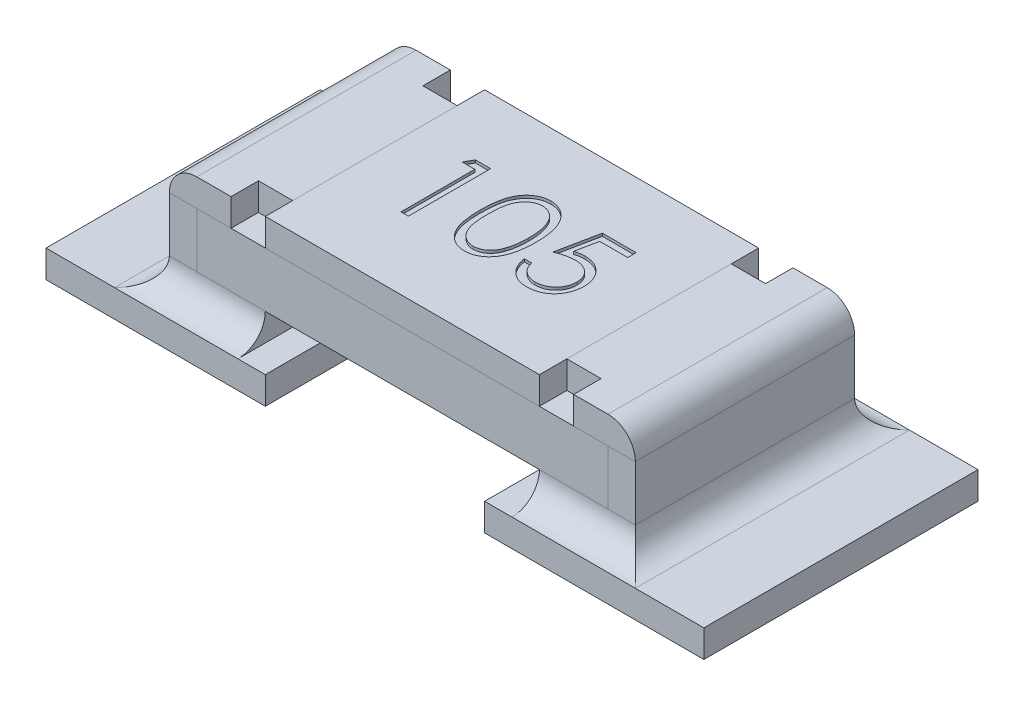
ISO-10303-21;
HEADER;
FILE_DESCRIPTION(('STEP AP214'),'2;1');
FILE_NAME('part.step','',(''),(''),'','','');
FILE_SCHEMA(('AUTOMOTIVE_DESIGN { 1 0 10303 214 1 1 1 1 }'));
ENDSEC;
DATA;
#1=APPLICATION_CONTEXT('core data for automotive mechanical design processes');
#2=APPLICATION_PROTOCOL_DEFINITION('international standard','automotive_design',2000,#1);
#3=PRODUCT_CONTEXT('',#1,'mechanical');
#4=PRODUCT('Part','Part','',(#3));
#5=PRODUCT_RELATED_PRODUCT_CATEGORY('part','',(#4));
#6=PRODUCT_DEFINITION_FORMATION('','',#4);
#7=PRODUCT_DEFINITION_CONTEXT('part definition',#1,'design');
#8=PRODUCT_DEFINITION('design','',#6,#7);
#9=PRODUCT_DEFINITION_SHAPE('','',#8);
#10=(LENGTH_UNIT() NAMED_UNIT(*) SI_UNIT(.MILLI.,.METRE.));
#11=(NAMED_UNIT(*) PLANE_ANGLE_UNIT() SI_UNIT($,.RADIAN.));
#12=(NAMED_UNIT(*) SI_UNIT($,.STERADIAN.) SOLID_ANGLE_UNIT());
#13=UNCERTAINTY_MEASURE_WITH_UNIT(LENGTH_MEASURE(1.E-05),#10,'distance_accuracy_value','');
#14=(GEOMETRIC_REPRESENTATION_CONTEXT(3) GLOBAL_UNCERTAINTY_ASSIGNED_CONTEXT((#13)) GLOBAL_UNIT_ASSIGNED_CONTEXT((#10,
#11,#12)) REPRESENTATION_CONTEXT('',''));
#15=CARTESIAN_POINT('',(0.,0.,0.));
#16=DIRECTION('',(0.,0.,1.));
#17=DIRECTION('',(1.,0.,0.));
#18=AXIS2_PLACEMENT_3D('',#15,#16,#17);
#19=CARTESIAN_POINT('',(0.85,0.5,-0.4));
#20=DIRECTION('',(0.,0.,1.));
#21=DIRECTION('',(1.,0.,0.));
#22=AXIS2_PLACEMENT_3D('',#19,#20,#21);
#23=PLANE('',#22);
#24=DIRECTION('',(-1.,0.,0.));
#25=VECTOR('',#24,1.);
#26=CARTESIAN_POINT('',(0.85,0.5,-0.4));
#27=LINE('',#26,#25);
#28=CARTESIAN_POINT('',(0.75,0.5,-0.4));
#29=VERTEX_POINT('',#28);
#30=CARTESIAN_POINT('',(0.625,0.5,-0.4));
#31=VERTEX_POINT('',#30);
#32=EDGE_CURVE('E108',#29,#31,#27,.T.);
#33=ORIENTED_EDGE('',*,*,#32,.F.);
#34=CARTESIAN_POINT('',(0.75,0.4,-0.4));
#35=DIRECTION('',(0.,0.,1.));
#36=DIRECTION('',(1.,0.,0.));
#37=AXIS2_PLACEMENT_3D('',#34,#35,#36);
#38=CIRCLE('',#37,0.1);
#39=CARTESIAN_POINT('',(0.85,0.4,-0.4));
#40=VERTEX_POINT('',#39);
#41=EDGE_CURVE('E53',#29,#40,#38,.F.);
#42=ORIENTED_EDGE('',*,*,#41,.T.);
#43=DIRECTION('',(-1.,0.,0.));
#44=VECTOR('',#43,1.);
#45=CARTESIAN_POINT('',(0.85,0.4,-0.4));
#46=LINE('',#45,#44);
#47=CARTESIAN_POINT('',(0.625,0.4,-0.4));
#48=VERTEX_POINT('',#47);
#49=EDGE_CURVE('E121',#40,#48,#46,.T.);
#50=ORIENTED_EDGE('',*,*,#49,.T.);
#51=DIRECTION('',(0.,-1.,0.));
#52=VECTOR('',#51,1.);
#53=CARTESIAN_POINT('',(0.625,0.5,-0.4));
#54=LINE('',#53,#52);
#55=EDGE_CURVE('E119',#31,#48,#54,.T.);
#56=ORIENTED_EDGE('',*,*,#55,.F.);
#57=EDGE_LOOP('',(#33,#42,#50,#56));
#58=FACE_BOUND('',#57,.T.);
#59=ADVANCED_FACE('F45',(#58),#23,.F.);
#60=CARTESIAN_POINT('',(0.625,0.5,-0.4));
#61=DIRECTION('',(1.,0.,0.));
#62=DIRECTION('',(0.,0.,-1.));
#63=AXIS2_PLACEMENT_3D('',#60,#61,#62);
#64=PLANE('',#63);
#65=DIRECTION('',(0.,0.,1.));
#66=VECTOR('',#65,1.);
#67=CARTESIAN_POINT('',(0.625,0.4,-0.4));
#68=LINE('',#67,#66);
#69=CARTESIAN_POINT('',(0.625,0.4,-0.3));
#70=VERTEX_POINT('',#69);
#71=EDGE_CURVE('E145',#48,#70,#68,.T.);
#72=ORIENTED_EDGE('',*,*,#71,.T.);
#73=DIRECTION('',(0.,-1.,0.));
#74=VECTOR('',#73,1.);
#75=CARTESIAN_POINT('',(0.625,0.5,-0.3));
#76=LINE('',#75,#74);
#77=CARTESIAN_POINT('',(0.625,0.5,-0.3));
#78=VERTEX_POINT('',#77);
#79=EDGE_CURVE('E124',#78,#70,#76,.T.);
#80=ORIENTED_EDGE('',*,*,#79,.F.);
#81=DIRECTION('',(0.,0.,1.));
#82=VECTOR('',#81,1.);
#83=CARTESIAN_POINT('',(0.625,0.5,-0.4));
#84=LINE('',#83,#82);
#85=EDGE_CURVE('E112',#31,#78,#84,.T.);
#86=ORIENTED_EDGE('',*,*,#85,.F.);
#87=ORIENTED_EDGE('',*,*,#55,.T.);
#88=EDGE_LOOP('',(#72,#80,#86,#87));
#89=FACE_BOUND('',#88,.T.);
#90=ADVANCED_FACE('F126',(#89),#64,.F.);
#91=CARTESIAN_POINT('',(0.625,0.5,-0.3));
#92=DIRECTION('',(0.,0.,1.));
#93=DIRECTION('',(1.,0.,0.));
#94=AXIS2_PLACEMENT_3D('',#91,#92,#93);
#95=PLANE('',#94);
#96=DIRECTION('',(-1.,0.,0.));
#97=VECTOR('',#96,1.);
#98=CARTESIAN_POINT('',(0.625,0.4,-0.3));
#99=LINE('',#98,#97);
#100=CARTESIAN_POINT('',(0.5,0.4,-0.3));
#101=VERTEX_POINT('',#100);
#102=EDGE_CURVE('E147',#70,#101,#99,.T.);
#103=ORIENTED_EDGE('',*,*,#102,.T.);
#104=DIRECTION('',(0.,-1.,0.));
#105=VECTOR('',#104,1.);
#106=CARTESIAN_POINT('',(0.5,0.5,-0.3));
#107=LINE('',#106,#105);
#108=CARTESIAN_POINT('',(0.5,0.5,-0.3));
#109=VERTEX_POINT('',#108);
#110=EDGE_CURVE('E164',#109,#101,#107,.T.);
#111=ORIENTED_EDGE('',*,*,#110,.F.);
#112=DIRECTION('',(-1.,0.,0.));
#113=VECTOR('',#112,1.);
#114=CARTESIAN_POINT('',(0.625,0.5,-0.3));
#115=LINE('',#114,#113);
#116=EDGE_CURVE('E129',#78,#109,#115,.T.);
#117=ORIENTED_EDGE('',*,*,#116,.F.);
#118=ORIENTED_EDGE('',*,*,#79,.T.);
#119=EDGE_LOOP('',(#103,#111,#117,#118));
#120=FACE_BOUND('',#119,.T.);
#121=ADVANCED_FACE('F182',(#120),#95,.F.);
#122=CARTESIAN_POINT('',(0.5,0.5,-0.3));
#123=DIRECTION('',(1.,0.,0.));
#124=DIRECTION('',(0.,0.,-1.));
#125=AXIS2_PLACEMENT_3D('',#122,#123,#124);
#126=PLANE('',#125);
#127=DIRECTION('',(0.,0.,1.));
#128=VECTOR('',#127,1.);
#129=CARTESIAN_POINT('',(0.5,0.4,-0.3));
#130=LINE('',#129,#128);
#131=CARTESIAN_POINT('',(0.5,0.4,0.3));
#132=VERTEX_POINT('',#131);
#133=EDGE_CURVE('E149',#101,#132,#130,.T.);
#134=ORIENTED_EDGE('',*,*,#133,.T.);
#135=DIRECTION('',(0.,-1.,0.));
#136=VECTOR('',#135,1.);
#137=CARTESIAN_POINT('',(0.5,0.5,0.3));
#138=LINE('',#137,#136);
#139=CARTESIAN_POINT('',(0.5,0.5,0.3));
#140=VERTEX_POINT('',#139);
#141=EDGE_CURVE('E161',#140,#132,#138,.T.);
#142=ORIENTED_EDGE('',*,*,#141,.F.);
#143=DIRECTION('',(0.,0.,1.));
#144=VECTOR('',#143,1.);
#145=CARTESIAN_POINT('',(0.5,0.5,-0.3));
#146=LINE('',#145,#144);
#147=EDGE_CURVE('E131',#109,#140,#146,.T.);
#148=ORIENTED_EDGE('',*,*,#147,.F.);
#149=ORIENTED_EDGE('',*,*,#110,.T.);
#150=EDGE_LOOP('',(#134,#142,#148,#149));
#151=FACE_BOUND('',#150,.T.);
#152=ADVANCED_FACE('F187',(#151),#126,.F.);
#153=CARTESIAN_POINT('',(0.5,0.5,0.3));
#154=DIRECTION('',(0.,0.,-1.));
#155=DIRECTION('',(-1.,0.,0.));
#156=AXIS2_PLACEMENT_3D('',#153,#154,#155);
#157=PLANE('',#156);
#158=DIRECTION('',(1.,0.,0.));
#159=VECTOR('',#158,1.);
#160=CARTESIAN_POINT('',(0.5,0.4,0.3));
#161=LINE('',#160,#159);
#162=CARTESIAN_POINT('',(0.625,0.4,0.3));
#163=VERTEX_POINT('',#162);
#164=EDGE_CURVE('E151',#132,#163,#161,.T.);
#165=ORIENTED_EDGE('',*,*,#164,.T.);
#166=DIRECTION('',(0.,-1.,0.));
#167=VECTOR('',#166,1.);
#168=CARTESIAN_POINT('',(0.625,0.5,0.3));
#169=LINE('',#168,#167);
#170=CARTESIAN_POINT('',(0.625,0.5,0.3));
#171=VERTEX_POINT('',#170);
#172=EDGE_CURVE('E158',#171,#163,#169,.T.);
#173=ORIENTED_EDGE('',*,*,#172,.F.);
#174=DIRECTION('',(1.,0.,0.));
#175=VECTOR('',#174,1.);
#176=CARTESIAN_POINT('',(0.5,0.5,0.3));
#177=LINE('',#176,#175);
#178=EDGE_CURVE('E135',#140,#171,#177,.T.);
#179=ORIENTED_EDGE('',*,*,#178,.F.);
#180=ORIENTED_EDGE('',*,*,#141,.T.);
#181=EDGE_LOOP('',(#165,#173,#179,#180));
#182=FACE_BOUND('',#181,.T.);
#183=ADVANCED_FACE('F191',(#182),#157,.F.);
#184=CARTESIAN_POINT('',(0.625,0.5,0.3));
#185=DIRECTION('',(1.,0.,0.));
#186=DIRECTION('',(0.,0.,-1.));
#187=AXIS2_PLACEMENT_3D('',#184,#185,#186);
#188=PLANE('',#187);
#189=DIRECTION('',(0.,0.,1.));
#190=VECTOR('',#189,1.);
#191=CARTESIAN_POINT('',(0.625,0.4,0.3));
#192=LINE('',#191,#190);
#193=CARTESIAN_POINT('',(0.625,0.4,0.4));
#194=VERTEX_POINT('',#193);
#195=EDGE_CURVE('E153',#163,#194,#192,.T.);
#196=ORIENTED_EDGE('',*,*,#195,.T.);
#197=DIRECTION('',(0.,-1.,0.));
#198=VECTOR('',#197,1.);
#199=CARTESIAN_POINT('',(0.625,0.5,0.4));
#200=LINE('',#199,#198);
#201=CARTESIAN_POINT('',(0.625,0.5,0.4));
#202=VERTEX_POINT('',#201);
#203=EDGE_CURVE('E141',#202,#194,#200,.T.);
#204=ORIENTED_EDGE('',*,*,#203,.F.);
#205=DIRECTION('',(0.,0.,1.));
#206=VECTOR('',#205,1.);
#207=CARTESIAN_POINT('',(0.625,0.5,0.3));
#208=LINE('',#207,#206);
#209=EDGE_CURVE('E137',#171,#202,#208,.T.);
#210=ORIENTED_EDGE('',*,*,#209,.F.);
#211=ORIENTED_EDGE('',*,*,#172,.T.);
#212=EDGE_LOOP('',(#196,#204,#210,#211));
#213=FACE_BOUND('',#212,.T.);
#214=ADVANCED_FACE('F195',(#213),#188,.F.);
#215=CARTESIAN_POINT('',(0.625,0.5,0.4));
#216=DIRECTION('',(0.,0.,-1.));
#217=DIRECTION('',(-1.,0.,0.));
#218=AXIS2_PLACEMENT_3D('',#215,#216,#217);
#219=PLANE('',#218);
#220=DIRECTION('',(1.,0.,0.));
#221=VECTOR('',#220,1.);
#222=CARTESIAN_POINT('',(0.625,0.4,0.4));
#223=LINE('',#222,#221);
#224=CARTESIAN_POINT('',(0.85,0.4,0.4));
#225=VERTEX_POINT('',#224);
#226=EDGE_CURVE('E116',#194,#225,#223,.T.);
#227=ORIENTED_EDGE('',*,*,#226,.T.);
#228=CARTESIAN_POINT('',(0.75,0.4,0.4));
#229=DIRECTION('',(0.,0.,-1.));
#230=DIRECTION('',(-1.,0.,0.));
#231=AXIS2_PLACEMENT_3D('',#228,#229,#230);
#232=CIRCLE('',#231,0.1);
#233=CARTESIAN_POINT('',(0.75,0.5,0.4));
#234=VERTEX_POINT('',#233);
#235=EDGE_CURVE('E12',#225,#234,#232,.F.);
#236=ORIENTED_EDGE('',*,*,#235,.T.);
#237=DIRECTION('',(1.,0.,0.));
#238=VECTOR('',#237,1.);
#239=CARTESIAN_POINT('',(0.625,0.5,0.4));
#240=LINE('',#239,#238);
#241=EDGE_CURVE('E139',#202,#234,#240,.T.);
#242=ORIENTED_EDGE('',*,*,#241,.F.);
#243=ORIENTED_EDGE('',*,*,#203,.T.);
#244=EDGE_LOOP('',(#227,#236,#242,#243));
#245=FACE_BOUND('',#244,.T.);
#246=ADVANCED_FACE('F199',(#245),#219,.F.);
#247=CARTESIAN_POINT('',(0.,0.5,0.));
#248=DIRECTION('',(0.,1.,0.));
#249=DIRECTION('',(0.,0.,1.));
#250=AXIS2_PLACEMENT_3D('',#247,#248,#249);
#251=PLANE('',#250);
#252=ORIENTED_EDGE('',*,*,#241,.T.);
#253=DIRECTION('',(0.,0.,-1.));
#254=VECTOR('',#253,1.);
#255=CARTESIAN_POINT('',(0.75,0.5,-0.4));
#256=LINE('',#255,#254);
#257=EDGE_CURVE('E114',#234,#29,#256,.T.);
#258=ORIENTED_EDGE('',*,*,#257,.T.);
#259=ORIENTED_EDGE('',*,*,#32,.T.);
#260=ORIENTED_EDGE('',*,*,#85,.T.);
#261=ORIENTED_EDGE('',*,*,#116,.T.);
#262=ORIENTED_EDGE('',*,*,#147,.T.);
#263=ORIENTED_EDGE('',*,*,#178,.T.);
#264=ORIENTED_EDGE('',*,*,#209,.T.);
#265=EDGE_LOOP('',(#252,#258,#259,#260,#261,#262,#263,#264));
#266=FACE_BOUND('',#265,.T.);
#267=ADVANCED_FACE('F110',(#266),#251,.T.);
#268=CARTESIAN_POINT('',(0.,0.4,0.));
#269=DIRECTION('',(0.,1.,0.));
#270=DIRECTION('',(0.,0.,1.));
#271=AXIS2_PLACEMENT_3D('',#268,#269,#270);
#272=PLANE('',#271);
#273=DIRECTION('',(0.,0.,-1.));
#274=VECTOR('',#273,1.);
#275=CARTESIAN_POINT('',(0.85,0.4,0.4));
#276=LINE('',#275,#274);
#277=EDGE_CURVE('E142',#225,#40,#276,.T.);
#278=ORIENTED_EDGE('',*,*,#277,.F.);
#279=ORIENTED_EDGE('',*,*,#226,.F.);
#280=ORIENTED_EDGE('',*,*,#195,.F.);
#281=ORIENTED_EDGE('',*,*,#164,.F.);
#282=ORIENTED_EDGE('',*,*,#133,.F.);
#283=ORIENTED_EDGE('',*,*,#102,.F.);
#284=ORIENTED_EDGE('',*,*,#71,.F.);
#285=ORIENTED_EDGE('',*,*,#49,.F.);
#286=EDGE_LOOP('',(#278,#279,#280,#281,#282,#283,#284,#285));
#287=FACE_BOUND('',#286,.T.);
#288=ADVANCED_FACE('F170',(#287),#272,.F.);
#289=CARTESIAN_POINT('',(0.75,0.4,0.));
#290=DIRECTION('',(0.,0.,1.));
#291=DIRECTION('',(1.,0.,0.));
#292=AXIS2_PLACEMENT_3D('',#289,#290,#291);
#293=CYLINDRICAL_SURFACE('',#292,0.1);
#294=ORIENTED_EDGE('',*,*,#235,.F.);
#295=ORIENTED_EDGE('',*,*,#277,.T.);
#296=ORIENTED_EDGE('',*,*,#41,.F.);
#297=ORIENTED_EDGE('',*,*,#257,.F.);
#298=EDGE_LOOP('',(#294,#295,#296,#297));
#299=FACE_BOUND('',#298,.T.);
#300=ADVANCED_FACE('F47',(#299),#293,.T.);
#301=CLOSED_SHELL('',(#59,#90,#121,#152,#183,#214,#246,#267,#288,#300));
#302=MANIFOLD_SOLID_BREP('B2',#301);
#303=CARTESIAN_POINT('',(-0.625,0.5,-0.4));
#304=DIRECTION('',(-1.,0.,0.));
#305=DIRECTION('',(0.,0.,1.));
#306=AXIS2_PLACEMENT_3D('',#303,#304,#305);
#307=PLANE('',#306);
#308=DIRECTION('',(0.,0.,-1.));
#309=VECTOR('',#308,1.);
#310=CARTESIAN_POINT('',(-0.625,0.4,-0.4));
#311=LINE('',#310,#309);
#312=CARTESIAN_POINT('',(-0.625,0.4,-0.3));
#313=VERTEX_POINT('',#312);
#314=CARTESIAN_POINT('',(-0.625,0.4,-0.4));
#315=VERTEX_POINT('',#314);
#316=EDGE_CURVE('E363',#313,#315,#311,.T.);
#317=ORIENTED_EDGE('',*,*,#316,.T.);
#318=DIRECTION('',(0.,-1.,0.));
#319=VECTOR('',#318,1.);
#320=CARTESIAN_POINT('',(-0.625,0.5,-0.4));
#321=LINE('',#320,#319);
#322=CARTESIAN_POINT('',(-0.625,0.5,-0.4));
#323=VERTEX_POINT('',#322);
#324=EDGE_CURVE('E347',#323,#315,#321,.T.);
#325=ORIENTED_EDGE('',*,*,#324,.F.);
#326=DIRECTION('',(0.,0.,-1.));
#327=VECTOR('',#326,1.);
#328=CARTESIAN_POINT('',(-0.625,0.5,-0.4));
#329=LINE('',#328,#327);
#330=CARTESIAN_POINT('',(-0.625,0.5,-0.3));
#331=VERTEX_POINT('',#330);
#332=EDGE_CURVE('E351',#331,#323,#329,.T.);
#333=ORIENTED_EDGE('',*,*,#332,.F.);
#334=DIRECTION('',(0.,-1.,0.));
#335=VECTOR('',#334,1.);
#336=CARTESIAN_POINT('',(-0.625,0.5,-0.3));
#337=LINE('',#336,#335);
#338=EDGE_CURVE('E397',#331,#313,#337,.T.);
#339=ORIENTED_EDGE('',*,*,#338,.T.);
#340=EDGE_LOOP('',(#317,#325,#333,#339));
#341=FACE_BOUND('',#340,.T.);
#342=ADVANCED_FACE('F282',(#341),#307,.F.);
#343=CARTESIAN_POINT('',(-0.625,0.5,-0.4));
#344=DIRECTION('',(0.,0.,1.));
#345=DIRECTION('',(1.,0.,0.));
#346=AXIS2_PLACEMENT_3D('',#343,#344,#345);
#347=PLANE('',#346);
#348=DIRECTION('',(-1.,0.,0.));
#349=VECTOR('',#348,1.);
#350=CARTESIAN_POINT('',(-0.625,0.4,-0.4));
#351=LINE('',#350,#349);
#352=CARTESIAN_POINT('',(-0.85,0.4,-0.4));
#353=VERTEX_POINT('',#352);
#354=EDGE_CURVE('E386',#315,#353,#351,.T.);
#355=ORIENTED_EDGE('',*,*,#354,.T.);
#356=CARTESIAN_POINT('',(-0.75,0.4,-0.4));
#357=DIRECTION('',(0.,0.,1.));
#358=DIRECTION('',(1.,0.,0.));
#359=AXIS2_PLACEMENT_3D('',#356,#357,#358);
#360=CIRCLE('',#359,0.1);
#361=CARTESIAN_POINT('',(-0.75,0.5,-0.4));
#362=VERTEX_POINT('',#361);
#363=EDGE_CURVE('E43',#353,#362,#360,.F.);
#364=ORIENTED_EDGE('',*,*,#363,.T.);
#365=DIRECTION('',(-1.,0.,0.));
#366=VECTOR('',#365,1.);
#367=CARTESIAN_POINT('',(-0.625,0.5,-0.4));
#368=LINE('',#367,#366);
#369=EDGE_CURVE('E343',#323,#362,#368,.T.);
#370=ORIENTED_EDGE('',*,*,#369,.F.);
#371=ORIENTED_EDGE('',*,*,#324,.T.);
#372=EDGE_LOOP('',(#355,#364,#370,#371));
#373=FACE_BOUND('',#372,.T.);
#374=ADVANCED_FACE('F345',(#373),#347,.F.);
#375=CARTESIAN_POINT('',(-0.85,0.5,0.4));
#376=DIRECTION('',(0.,0.,-1.));
#377=DIRECTION('',(-1.,0.,0.));
#378=AXIS2_PLACEMENT_3D('',#375,#376,#377);
#379=PLANE('',#378);
#380=DIRECTION('',(1.,0.,0.));
#381=VECTOR('',#380,1.);
#382=CARTESIAN_POINT('',(-0.85,0.5,0.4));
#383=LINE('',#382,#381);
#384=CARTESIAN_POINT('',(-0.75,0.5,0.4));
#385=VERTEX_POINT('',#384);
#386=CARTESIAN_POINT('',(-0.625,0.5,0.4));
#387=VERTEX_POINT('',#386);
#388=EDGE_CURVE('E350',#385,#387,#383,.T.);
#389=ORIENTED_EDGE('',*,*,#388,.F.);
#390=CARTESIAN_POINT('',(-0.75,0.4,0.4));
#391=DIRECTION('',(0.,0.,-1.));
#392=DIRECTION('',(-1.,0.,0.));
#393=AXIS2_PLACEMENT_3D('',#390,#391,#392);
#394=CIRCLE('',#393,0.1);
#395=CARTESIAN_POINT('',(-0.85,0.4,0.4));
#396=VERTEX_POINT('',#395);
#397=EDGE_CURVE('E290',#385,#396,#394,.F.);
#398=ORIENTED_EDGE('',*,*,#397,.T.);
#399=DIRECTION('',(1.,0.,0.));
#400=VECTOR('',#399,1.);
#401=CARTESIAN_POINT('',(-0.85,0.4,0.4));
#402=LINE('',#401,#400);
#403=CARTESIAN_POINT('',(-0.625,0.4,0.4));
#404=VERTEX_POINT('',#403);
#405=EDGE_CURVE('E377',#396,#404,#402,.T.);
#406=ORIENTED_EDGE('',*,*,#405,.T.);
#407=DIRECTION('',(0.,-1.,0.));
#408=VECTOR('',#407,1.);
#409=CARTESIAN_POINT('',(-0.625,0.5,0.4));
#410=LINE('',#409,#408);
#411=EDGE_CURVE('E365',#387,#404,#410,.T.);
#412=ORIENTED_EDGE('',*,*,#411,.F.);
#413=EDGE_LOOP('',(#389,#398,#406,#412));
#414=FACE_BOUND('',#413,.T.);
#415=ADVANCED_FACE('F375',(#414),#379,.F.);
#416=CARTESIAN_POINT('',(-0.625,0.5,0.3));
#417=DIRECTION('',(-1.,0.,0.));
#418=DIRECTION('',(0.,0.,1.));
#419=AXIS2_PLACEMENT_3D('',#416,#417,#418);
#420=PLANE('',#419);
#421=DIRECTION('',(0.,0.,-1.));
#422=VECTOR('',#421,1.);
#423=CARTESIAN_POINT('',(-0.625,0.4,0.3));
#424=LINE('',#423,#422);
#425=CARTESIAN_POINT('',(-0.625,0.4,0.3));
#426=VERTEX_POINT('',#425);
#427=EDGE_CURVE('E384',#404,#426,#424,.T.);
#428=ORIENTED_EDGE('',*,*,#427,.T.);
#429=DIRECTION('',(0.,-1.,0.));
#430=VECTOR('',#429,1.);
#431=CARTESIAN_POINT('',(-0.625,0.5,0.3));
#432=LINE('',#431,#430);
#433=CARTESIAN_POINT('',(-0.625,0.5,0.3));
#434=VERTEX_POINT('',#433);
#435=EDGE_CURVE('E369',#434,#426,#432,.T.);
#436=ORIENTED_EDGE('',*,*,#435,.F.);
#437=DIRECTION('',(0.,0.,-1.));
#438=VECTOR('',#437,1.);
#439=CARTESIAN_POINT('',(-0.625,0.5,0.3));
#440=LINE('',#439,#438);
#441=EDGE_CURVE('E426',#387,#434,#440,.T.);
#442=ORIENTED_EDGE('',*,*,#441,.F.);
#443=ORIENTED_EDGE('',*,*,#411,.T.);
#444=EDGE_LOOP('',(#428,#436,#442,#443));
#445=FACE_BOUND('',#444,.T.);
#446=ADVANCED_FACE('F428',(#445),#420,.F.);
#447=CARTESIAN_POINT('',(-0.5,0.5,0.3));
#448=DIRECTION('',(0.,0.,-1.));
#449=DIRECTION('',(-1.,0.,0.));
#450=AXIS2_PLACEMENT_3D('',#447,#448,#449);
#451=PLANE('',#450);
#452=DIRECTION('',(1.,0.,0.));
#453=VECTOR('',#452,1.);
#454=CARTESIAN_POINT('',(-0.5,0.4,0.3));
#455=LINE('',#454,#453);
#456=CARTESIAN_POINT('',(-0.5,0.4,0.3));
#457=VERTEX_POINT('',#456);
#458=EDGE_CURVE('E392',#426,#457,#455,.T.);
#459=ORIENTED_EDGE('',*,*,#458,.T.);
#460=DIRECTION('',(0.,-1.,0.));
#461=VECTOR('',#460,1.);
#462=CARTESIAN_POINT('',(-0.5,0.5,0.3));
#463=LINE('',#462,#461);
#464=CARTESIAN_POINT('',(-0.5,0.5,0.3));
#465=VERTEX_POINT('',#464);
#466=EDGE_CURVE('E402',#465,#457,#463,.T.);
#467=ORIENTED_EDGE('',*,*,#466,.F.);
#468=DIRECTION('',(1.,0.,0.));
#469=VECTOR('',#468,1.);
#470=CARTESIAN_POINT('',(-0.5,0.5,0.3));
#471=LINE('',#470,#469);
#472=EDGE_CURVE('E410',#434,#465,#471,.T.);
#473=ORIENTED_EDGE('',*,*,#472,.F.);
#474=ORIENTED_EDGE('',*,*,#435,.T.);
#475=EDGE_LOOP('',(#459,#467,#473,#474));
#476=FACE_BOUND('',#475,.T.);
#477=ADVANCED_FACE('F408',(#476),#451,.F.);
#478=CARTESIAN_POINT('',(-0.5,0.5,-0.3));
#479=DIRECTION('',(-1.,0.,0.));
#480=DIRECTION('',(0.,0.,1.));
#481=AXIS2_PLACEMENT_3D('',#478,#479,#480);
#482=PLANE('',#481);
#483=DIRECTION('',(0.,0.,-1.));
#484=VECTOR('',#483,1.);
#485=CARTESIAN_POINT('',(-0.5,0.4,-0.3));
#486=LINE('',#485,#484);
#487=CARTESIAN_POINT('',(-0.5,0.4,-0.3));
#488=VERTEX_POINT('',#487);
#489=EDGE_CURVE('E394',#457,#488,#486,.T.);
#490=ORIENTED_EDGE('',*,*,#489,.T.);
#491=DIRECTION('',(0.,-1.,0.));
#492=VECTOR('',#491,1.);
#493=CARTESIAN_POINT('',(-0.5,0.5,-0.3));
#494=LINE('',#493,#492);
#495=CARTESIAN_POINT('',(-0.5,0.5,-0.3));
#496=VERTEX_POINT('',#495);
#497=EDGE_CURVE('E399',#496,#488,#494,.T.);
#498=ORIENTED_EDGE('',*,*,#497,.F.);
#499=DIRECTION('',(0.,0.,-1.));
#500=VECTOR('',#499,1.);
#501=CARTESIAN_POINT('',(-0.5,0.5,-0.3));
#502=LINE('',#501,#500);
#503=EDGE_CURVE('E421',#465,#496,#502,.T.);
#504=ORIENTED_EDGE('',*,*,#503,.F.);
#505=ORIENTED_EDGE('',*,*,#466,.T.);
#506=EDGE_LOOP('',(#490,#498,#504,#505));
#507=FACE_BOUND('',#506,.T.);
#508=ADVANCED_FACE('F417',(#507),#482,.F.);
#509=CARTESIAN_POINT('',(-0.625,0.5,-0.3));
#510=DIRECTION('',(0.,0.,1.));
#511=DIRECTION('',(1.,0.,0.));
#512=AXIS2_PLACEMENT_3D('',#509,#510,#511);
#513=PLANE('',#512);
#514=DIRECTION('',(-1.,0.,0.));
#515=VECTOR('',#514,1.);
#516=CARTESIAN_POINT('',(-0.625,0.4,-0.3));
#517=LINE('',#516,#515);
#518=EDGE_CURVE('E360',#488,#313,#517,.T.);
#519=ORIENTED_EDGE('',*,*,#518,.T.);
#520=ORIENTED_EDGE('',*,*,#338,.F.);
#521=DIRECTION('',(-1.,0.,0.));
#522=VECTOR('',#521,1.);
#523=CARTESIAN_POINT('',(-0.625,0.5,-0.3));
#524=LINE('',#523,#522);
#525=EDGE_CURVE('E356',#496,#331,#524,.T.);
#526=ORIENTED_EDGE('',*,*,#525,.F.);
#527=ORIENTED_EDGE('',*,*,#497,.T.);
#528=EDGE_LOOP('',(#519,#520,#526,#527));
#529=FACE_BOUND('',#528,.T.);
#530=ADVANCED_FACE('F420',(#529),#513,.F.);
#531=CARTESIAN_POINT('',(0.,0.5,0.));
#532=DIRECTION('',(0.,1.,0.));
#533=DIRECTION('',(0.,0.,1.));
#534=AXIS2_PLACEMENT_3D('',#531,#532,#533);
#535=PLANE('',#534);
#536=ORIENTED_EDGE('',*,*,#369,.T.);
#537=DIRECTION('',(0.,0.,1.));
#538=VECTOR('',#537,1.);
#539=CARTESIAN_POINT('',(-0.75,0.5,0.4));
#540=LINE('',#539,#538);
#541=EDGE_CURVE('E364',#362,#385,#540,.T.);
#542=ORIENTED_EDGE('',*,*,#541,.T.);
#543=ORIENTED_EDGE('',*,*,#388,.T.);
#544=ORIENTED_EDGE('',*,*,#441,.T.);
#545=ORIENTED_EDGE('',*,*,#472,.T.);
#546=ORIENTED_EDGE('',*,*,#503,.T.);
#547=ORIENTED_EDGE('',*,*,#525,.T.);
#548=ORIENTED_EDGE('',*,*,#332,.T.);
#549=EDGE_LOOP('',(#536,#542,#543,#544,#545,#546,#547,#548));
#550=FACE_BOUND('',#549,.T.);
#551=ADVANCED_FACE('F354',(#550),#535,.T.);
#552=CARTESIAN_POINT('',(0.,0.4,0.));
#553=DIRECTION('',(0.,1.,0.));
#554=DIRECTION('',(0.,0.,1.));
#555=AXIS2_PLACEMENT_3D('',#552,#553,#554);
#556=PLANE('',#555);
#557=ORIENTED_EDGE('',*,*,#316,.F.);
#558=ORIENTED_EDGE('',*,*,#518,.F.);
#559=ORIENTED_EDGE('',*,*,#489,.F.);
#560=ORIENTED_EDGE('',*,*,#458,.F.);
#561=ORIENTED_EDGE('',*,*,#427,.F.);
#562=ORIENTED_EDGE('',*,*,#405,.F.);
#563=DIRECTION('',(0.,0.,1.));
#564=VECTOR('',#563,1.);
#565=CARTESIAN_POINT('',(-0.85,0.4,-0.4));
#566=LINE('',#565,#564);
#567=EDGE_CURVE('E382',#353,#396,#566,.T.);
#568=ORIENTED_EDGE('',*,*,#567,.F.);
#569=ORIENTED_EDGE('',*,*,#354,.F.);
#570=EDGE_LOOP('',(#557,#558,#559,#560,#561,#562,#568,#569));
#571=FACE_BOUND('',#570,.T.);
#572=ADVANCED_FACE('F381',(#571),#556,.F.);
#573=CARTESIAN_POINT('',(-0.75,0.4,0.));
#574=DIRECTION('',(0.,0.,-1.));
#575=DIRECTION('',(-1.,0.,0.));
#576=AXIS2_PLACEMENT_3D('',#573,#574,#575);
#577=CYLINDRICAL_SURFACE('',#576,0.1);
#578=ORIENTED_EDGE('',*,*,#363,.F.);
#579=ORIENTED_EDGE('',*,*,#567,.T.);
#580=ORIENTED_EDGE('',*,*,#397,.F.);
#581=ORIENTED_EDGE('',*,*,#541,.F.);
#582=EDGE_LOOP('',(#578,#579,#580,#581));
#583=FACE_BOUND('',#582,.T.);
#584=ADVANCED_FACE('F284',(#583),#577,.T.);
#585=CLOSED_SHELL('',(#342,#374,#415,#446,#477,#508,#530,#551,#572,#584));
#586=MANIFOLD_SOLID_BREP('B6',#585);
#587=CARTESIAN_POINT('',(0.,0.5,0.));
#588=DIRECTION('',(0.,1.,0.));
#589=DIRECTION('',(0.,0.,1.));
#590=AXIS2_PLACEMENT_3D('',#587,#588,#589);
#591=PLANE('',#590);
#592=DIRECTION('',(-1.,0.,0.));
#593=VECTOR('',#592,1.);
#594=CARTESIAN_POINT('',(-0.266677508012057,0.5,-0.131052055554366));
#595=LINE('',#594,#593);
#596=CARTESIAN_POINT('',(-0.266677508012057,0.5,-0.131052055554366));
#597=VERTEX_POINT('',#596);
#598=CARTESIAN_POINT('',(-0.312831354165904,0.5,-0.131052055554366));
#599=VERTEX_POINT('',#598);
#600=EDGE_CURVE('E861',#597,#599,#595,.T.);
#601=ORIENTED_EDGE('',*,*,#600,.T.);
#602=DIRECTION('',(0.496686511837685,0.,-0.867930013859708));
#603=VECTOR('',#602,1.);
#604=CARTESIAN_POINT('',(-0.312831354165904,0.5,-0.131052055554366));
#605=LINE('',#604,#603);
#606=CARTESIAN_POINT('',(-0.29522318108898,0.5,-0.161821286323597));
#607=VERTEX_POINT('',#606);
#608=EDGE_CURVE('E856',#599,#607,#605,.T.);
#609=ORIENTED_EDGE('',*,*,#608,.T.);
#610=DIRECTION('',(1.,0.,0.));
#611=VECTOR('',#610,1.);
#612=CARTESIAN_POINT('',(-0.29522318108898,0.5,-0.161821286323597));
#613=LINE('',#612,#611);
#614=CARTESIAN_POINT('',(-0.23975443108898,0.5,-0.161821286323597));
#615=VERTEX_POINT('',#614);
#616=EDGE_CURVE('E874',#607,#615,#613,.T.);
#617=ORIENTED_EDGE('',*,*,#616,.T.);
#618=DIRECTION('',(0.,0.,1.));
#619=VECTOR('',#618,1.);
#620=CARTESIAN_POINT('',(-0.23975443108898,0.5,-0.161821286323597));
#621=LINE('',#620,#619);
#622=CARTESIAN_POINT('',(-0.23975443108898,0.5,0.138178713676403));
#623=VERTEX_POINT('',#622);
#624=EDGE_CURVE('E877',#615,#623,#621,.T.);
#625=ORIENTED_EDGE('',*,*,#624,.T.);
#626=DIRECTION('',(-1.,0.,0.));
#627=VECTOR('',#626,1.);
#628=CARTESIAN_POINT('',(-0.23975443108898,0.5,0.138178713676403));
#629=LINE('',#628,#627);
#630=CARTESIAN_POINT('',(-0.266677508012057,0.5,0.138178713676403));
#631=VERTEX_POINT('',#630);
#632=EDGE_CURVE('E880',#623,#631,#629,.T.);
#633=ORIENTED_EDGE('',*,*,#632,.T.);
#634=DIRECTION('',(0.,0.,-1.));
#635=VECTOR('',#634,1.);
#636=CARTESIAN_POINT('',(-0.266677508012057,0.5,0.138178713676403));
#637=LINE('',#636,#635);
#638=EDGE_CURVE('E883',#631,#597,#637,.T.);
#639=ORIENTED_EDGE('',*,*,#638,.T.);
#640=EDGE_LOOP('',(#601,#609,#617,#625,#633,#639));
#641=FACE_BOUND('',#640,.T.);
#642=DIRECTION('',(0.,0.,1.));
#643=VECTOR('',#642,1.);
#644=CARTESIAN_POINT('',(-0.5,0.5,-0.4));
#645=LINE('',#644,#643);
#646=CARTESIAN_POINT('',(-0.5,0.5,-0.4));
#647=VERTEX_POINT('',#646);
#648=CARTESIAN_POINT('',(-0.5,0.5,0.4));
#649=VERTEX_POINT('',#648);
#650=EDGE_CURVE('E902',#647,#649,#645,.T.);
#651=ORIENTED_EDGE('',*,*,#650,.T.);
#652=DIRECTION('',(1.,0.,0.));
#653=VECTOR('',#652,1.);
#654=CARTESIAN_POINT('',(-0.5,0.5,0.4));
#655=LINE('',#654,#653);
#656=CARTESIAN_POINT('',(0.5,0.5,0.4));
#657=VERTEX_POINT('',#656);
#658=EDGE_CURVE('E905',#649,#657,#655,.T.);
#659=ORIENTED_EDGE('',*,*,#658,.T.);
#660=DIRECTION('',(0.,0.,-1.));
#661=VECTOR('',#660,1.);
#662=CARTESIAN_POINT('',(0.5,0.5,-0.4));
#663=LINE('',#662,#661);
#664=CARTESIAN_POINT('',(0.5,0.5,-0.4));
#665=VERTEX_POINT('',#664);
#666=EDGE_CURVE('E908',#657,#665,#663,.T.);
#667=ORIENTED_EDGE('',*,*,#666,.T.);
#668=DIRECTION('',(-1.,0.,0.));
#669=VECTOR('',#668,1.);
#670=CARTESIAN_POINT('',(-0.5,0.5,-0.4));
#671=LINE('',#670,#669);
#672=EDGE_CURVE('E910',#665,#647,#671,.T.);
#673=ORIENTED_EDGE('',*,*,#672,.T.);
#674=EDGE_LOOP('',(#651,#659,#667,#673));
#675=FACE_BOUND('',#674,.T.);
#676=CARTESIAN_POINT('',(0.0756301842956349,0.5,-0.0117010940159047));
#677=CARTESIAN_POINT('',(0.0755743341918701,0.5,-0.00711333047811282));
#678=CARTESIAN_POINT('',(0.0754655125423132,0.5,0.00182573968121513));
#679=CARTESIAN_POINT('',(0.0749016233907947,0.5,0.0148998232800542));
#680=CARTESIAN_POINT('',(0.0737908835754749,0.5,0.0272425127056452));
#681=CARTESIAN_POINT('',(0.0724014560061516,0.5,0.038883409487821));
#682=CARTESIAN_POINT('',(0.0704770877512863,0.5,0.049774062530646));
#683=CARTESIAN_POINT('',(0.0681109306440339,0.5,0.0599521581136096));
#684=CARTESIAN_POINT('',(0.0654837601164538,0.5,0.0694616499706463));
#685=CARTESIAN_POINT('',(0.0622407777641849,0.5,0.0782246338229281));
#686=CARTESIAN_POINT('',(0.0586912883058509,0.5,0.0863633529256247));
#687=CARTESIAN_POINT('',(0.0548294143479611,0.5,0.0939633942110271));
#688=CARTESIAN_POINT('',(0.0506920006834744,0.5,0.101091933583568));
#689=CARTESIAN_POINT('',(0.0461843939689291,0.5,0.107691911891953));
#690=CARTESIAN_POINT('',(0.0413798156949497,0.5,0.113810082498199));
#691=CARTESIAN_POINT('',(0.0361754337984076,0.5,0.119338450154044));
#692=CARTESIAN_POINT('',(0.0307179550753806,0.5,0.1244102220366));
#693=CARTESIAN_POINT('',(0.0249397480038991,0.5,0.128923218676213));
#694=CARTESIAN_POINT('',(0.0189044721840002,0.5,0.132873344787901));
#695=CARTESIAN_POINT('',(0.0127365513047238,0.5,0.136405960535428));
#696=CARTESIAN_POINT('',(0.00632654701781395,0.5,0.139254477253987));
#697=CARTESIAN_POINT('',(-0.000180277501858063,0.5,0.141700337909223));
#698=CARTESIAN_POINT('',(-0.00687699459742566,0.5,0.143568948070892));
#699=CARTESIAN_POINT('',(-0.0137552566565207,0.5,0.144860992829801));
#700=CARTESIAN_POINT('',(-0.0207800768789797,0.5,0.145767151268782));
#701=CARTESIAN_POINT('',(-0.0255287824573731,0.5,0.145836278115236));
#702=CARTESIAN_POINT('',(-0.0279154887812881,0.5,0.145871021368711));
#703=B_SPLINE_CURVE_WITH_KNOTS('',3,(#676,#677,#678,#679,#680,#681,#682,#683,#684,#685,#686,
#687,#688,#689,#690,#691,#692,#693,#694,#695,#696,#697,#698,#699,#700,#701,#702),.UNSPECIFIED.,
.F.,.F.,(4,1,1,1,1,1,1,1,1,1,1,1,1,1,1,1,1,1,1,1,1,1,1,1,4),(0.,0.0650632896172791,
0.126773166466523,0.185515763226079,0.240764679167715,0.292979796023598,0.342250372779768,
0.38891928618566,0.43277566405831,0.474628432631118,0.514774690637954,0.553605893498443,
0.591426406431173,0.628028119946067,0.663803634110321,0.698984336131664,0.733591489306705,
0.76762846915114,0.801208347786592,0.834263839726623,0.866980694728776,0.899719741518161,
0.932701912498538,0.96617588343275,1.),.UNSPECIFIED.);
#704=CARTESIAN_POINT('',(0.0756301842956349,0.5,-0.0117010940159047));
#705=VERTEX_POINT('',#704);
#706=CARTESIAN_POINT('',(-0.0279154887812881,0.5,0.145871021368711));
#707=VERTEX_POINT('',#706);
#708=EDGE_CURVE('E837',#705,#707,#703,.T.);
#709=ORIENTED_EDGE('',*,*,#708,.T.);
#710=CARTESIAN_POINT('',(-0.0279154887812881,0.5,0.145871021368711));
#711=CARTESIAN_POINT('',(-0.03028155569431,0.5,0.14583104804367));
#712=CARTESIAN_POINT('',(-0.034946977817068,0.5,0.145752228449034));
#713=CARTESIAN_POINT('',(-0.0418600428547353,0.5,0.144936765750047));
#714=CARTESIAN_POINT('',(-0.0485699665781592,0.5,0.143625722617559));
#715=CARTESIAN_POINT('',(-0.0551098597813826,0.5,0.141790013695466));
#716=CARTESIAN_POINT('',(-0.0615132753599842,0.5,0.139543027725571));
#717=CARTESIAN_POINT('',(-0.0676929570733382,0.5,0.13661556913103));
#718=CARTESIAN_POINT('',(-0.0737176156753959,0.5,0.133244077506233));
#719=CARTESIAN_POINT('',(-0.0795711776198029,0.5,0.12940446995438));
#720=CARTESIAN_POINT('',(-0.0851436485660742,0.5,0.125005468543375));
#721=CARTESIAN_POINT('',(-0.0904663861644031,0.5,0.120139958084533));
#722=CARTESIAN_POINT('',(-0.095405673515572,0.5,0.114686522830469));
#723=CARTESIAN_POINT('',(-0.100002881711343,0.5,0.108731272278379));
#724=CARTESIAN_POINT('',(-0.104372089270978,0.5,0.102328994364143));
#725=CARTESIAN_POINT('',(-0.108391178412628,0.5,0.0953922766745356));
#726=CARTESIAN_POINT('',(-0.11210868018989,0.5,0.0879486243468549));
#727=CARTESIAN_POINT('',(-0.115506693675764,0.5,0.0799499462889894));
#728=CARTESIAN_POINT('',(-0.118519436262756,0.5,0.0712795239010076));
#729=CARTESIAN_POINT('',(-0.121180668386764,0.5,0.0618381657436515));
#730=CARTESIAN_POINT('',(-0.123281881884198,0.5,0.0515425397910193));
#731=CARTESIAN_POINT('',(-0.125080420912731,0.5,0.0404753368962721));
#732=CARTESIAN_POINT('',(-0.126531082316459,0.5,0.0285890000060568));
#733=CARTESIAN_POINT('',(-0.127521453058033,0.5,0.015877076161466));
#734=CARTESIAN_POINT('',(-0.128133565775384,0.5,0.002347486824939));
#735=CARTESIAN_POINT('',(-0.128188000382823,0.5,-0.00693277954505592));
#736=CARTESIAN_POINT('',(-0.128215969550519,0.5,-0.0117010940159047));
#737=B_SPLINE_CURVE_WITH_KNOTS('',3,(#710,#711,#712,#713,#714,#715,#716,#717,#718,#719,#720,
#721,#722,#723,#724,#725,#726,#727,#728,#729,#730,#731,#732,#733,#734,#735,#736),.UNSPECIFIED.,
.F.,.F.,(4,1,1,1,1,1,1,1,1,1,1,1,1,1,1,1,1,1,1,1,1,1,1,1,4),(0.,0.0337871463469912,
0.0666216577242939,0.0992848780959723,0.131361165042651,0.163585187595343,0.196103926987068,
0.228902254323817,0.262158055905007,0.295991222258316,0.3302178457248,0.365059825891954,
0.400950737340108,0.437620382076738,0.475707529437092,0.515380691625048,0.556413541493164,
0.599764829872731,0.646424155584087,0.696431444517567,0.749781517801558,0.806573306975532,
0.8674355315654,0.931886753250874,1.),.UNSPECIFIED.);
#738=CARTESIAN_POINT('',(-0.128215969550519,0.5,-0.0117010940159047));
#739=VERTEX_POINT('',#738);
#740=EDGE_CURVE('E542',#707,#739,#737,.T.);
#741=ORIENTED_EDGE('',*,*,#740,.T.);
#742=CARTESIAN_POINT('',(-0.128215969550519,0.5,-0.0117010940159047));
#743=CARTESIAN_POINT('',(-0.12818785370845,0.5,-0.0165094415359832));
#744=CARTESIAN_POINT('',(-0.128133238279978,0.5,-0.0258497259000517));
#745=CARTESIAN_POINT('',(-0.127525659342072,0.5,-0.039459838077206));
#746=CARTESIAN_POINT('',(-0.126516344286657,0.5,-0.0522278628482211));
#747=CARTESIAN_POINT('',(-0.12513314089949,0.5,-0.0641544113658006));
#748=CARTESIAN_POINT('',(-0.123449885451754,0.5,-0.0752425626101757));
#749=CARTESIAN_POINT('',(-0.12120284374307,0.5,-0.08546268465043));
#750=CARTESIAN_POINT('',(-0.118647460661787,0.5,-0.0948620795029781));
#751=CARTESIAN_POINT('',(-0.115685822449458,0.5,-0.10347139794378));
#752=CARTESIAN_POINT('',(-0.112344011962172,0.5,-0.111406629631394));
#753=CARTESIAN_POINT('',(-0.108706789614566,0.5,-0.118814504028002));
#754=CARTESIAN_POINT('',(-0.104629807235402,0.5,-0.125683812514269));
#755=CARTESIAN_POINT('',(-0.10034607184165,0.5,-0.132124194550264));
#756=CARTESIAN_POINT('',(-0.0956821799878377,0.5,-0.138030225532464));
#757=CARTESIAN_POINT('',(-0.090770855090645,0.5,-0.143485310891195));
#758=CARTESIAN_POINT('',(-0.0854204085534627,0.5,-0.148363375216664));
#759=CARTESIAN_POINT('',(-0.0798127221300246,0.5,-0.152807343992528));
#760=CARTESIAN_POINT('',(-0.0738970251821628,0.5,-0.15670301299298));
#761=CARTESIAN_POINT('',(-0.0678419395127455,0.5,-0.160134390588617));
#762=CARTESIAN_POINT('',(-0.0616057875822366,0.5,-0.163065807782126));
#763=CARTESIAN_POINT('',(-0.0551715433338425,0.5,-0.165370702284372));
#764=CARTESIAN_POINT('',(-0.0485970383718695,0.5,-0.167274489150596));
#765=CARTESIAN_POINT('',(-0.0418592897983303,0.5,-0.168576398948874));
#766=CARTESIAN_POINT('',(-0.0349471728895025,0.5,-0.169395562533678));
#767=CARTESIAN_POINT('',(-0.0302816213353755,0.5,-0.16947387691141));
#768=CARTESIAN_POINT('',(-0.0279154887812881,0.5,-0.169513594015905));
#769=B_SPLINE_CURVE_WITH_KNOTS('',3,(#742,#743,#744,#745,#746,#747,#748,#749,#750,#751,#752,
#753,#754,#755,#756,#757,#758,#759,#760,#761,#762,#763,#764,#765,#766,#767,#768),.UNSPECIFIED.,
.F.,.F.,(4,1,1,1,1,1,1,1,1,1,1,1,1,1,1,1,1,1,1,1,1,1,1,1,4),(0.,0.0685946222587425,
0.133246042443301,0.194312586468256,0.251279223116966,0.304513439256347,0.354234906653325,
0.400480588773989,0.443410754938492,0.484014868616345,0.523252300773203,0.56104237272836,
0.5979002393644,0.633518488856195,0.668314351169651,0.702495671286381,0.736685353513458,
0.770293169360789,0.803437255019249,0.835912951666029,0.868460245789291,0.900846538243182,
0.933466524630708,0.966257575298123,1.),.UNSPECIFIED.);
#770=CARTESIAN_POINT('',(-0.0279154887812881,0.5,-0.169513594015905));
#771=VERTEX_POINT('',#770);
#772=EDGE_CURVE('E820',#739,#771,#769,.T.);
#773=ORIENTED_EDGE('',*,*,#772,.T.);
#774=CARTESIAN_POINT('',(-0.0279154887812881,0.5,-0.169513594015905));
#775=CARTESIAN_POINT('',(-0.0255295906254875,0.5,-0.169471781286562));
#776=CARTESIAN_POINT('',(-0.0207847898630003,0.5,-0.169388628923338));
#777=CARTESIAN_POINT('',(-0.0137699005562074,0.5,-0.168589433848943));
#778=CARTESIAN_POINT('',(-0.00691707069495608,0.5,-0.167263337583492));
#779=CARTESIAN_POINT('',(-0.000255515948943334,0.5,-0.165384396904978));
#780=CARTESIAN_POINT('',(0.00626948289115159,0.5,-0.163053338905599));
#781=CARTESIAN_POINT('',(0.0126068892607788,0.5,-0.160131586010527));
#782=CARTESIAN_POINT('',(0.01879606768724,0.5,-0.156730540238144));
#783=CARTESIAN_POINT('',(0.0247386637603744,0.5,-0.152734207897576));
#784=CARTESIAN_POINT('',(0.0304999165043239,0.5,-0.148278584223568));
#785=CARTESIAN_POINT('',(0.0359383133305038,0.5,-0.143241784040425));
#786=CARTESIAN_POINT('',(0.0410543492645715,0.5,-0.137674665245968));
#787=CARTESIAN_POINT('',(0.0459122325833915,0.5,-0.131636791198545));
#788=CARTESIAN_POINT('',(0.0503741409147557,0.5,-0.125012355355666));
#789=CARTESIAN_POINT('',(0.0546232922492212,0.5,-0.117916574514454));
#790=CARTESIAN_POINT('',(0.0584266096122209,0.5,-0.110225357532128));
#791=CARTESIAN_POINT('',(0.0620895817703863,0.5,-0.102067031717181));
#792=CARTESIAN_POINT('',(0.0652513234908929,0.5,-0.0932158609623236));
#793=CARTESIAN_POINT('',(0.0681027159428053,0.5,-0.0837217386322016));
#794=CARTESIAN_POINT('',(0.0704066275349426,0.5,-0.0734725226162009));
#795=CARTESIAN_POINT('',(0.0723257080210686,0.5,-0.0625219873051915));
#796=CARTESIAN_POINT('',(0.0738124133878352,0.5,-0.0508299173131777));
#797=CARTESIAN_POINT('',(0.0748952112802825,0.5,-0.0384213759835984));
#798=CARTESIAN_POINT('',(0.0754671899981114,0.5,-0.0252881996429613));
#799=CARTESIAN_POINT('',(0.0755749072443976,0.5,-0.0163089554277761));
#800=CARTESIAN_POINT('',(0.0756301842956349,0.5,-0.0117010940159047));
#801=B_SPLINE_CURVE_WITH_KNOTS('',3,(#774,#775,#776,#777,#778,#779,#780,#781,#782,#783,#784,
#785,#786,#787,#788,#789,#790,#791,#792,#793,#794,#795,#796,#797,#798,#799,#800),.UNSPECIFIED.,
.F.,.F.,(4,1,1,1,1,1,1,1,1,1,1,1,1,1,1,1,1,1,1,1,1,1,1,1,4),(0.,0.0337881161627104,
0.06719393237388,0.0998624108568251,0.132566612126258,0.165151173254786,0.197913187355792,
0.231319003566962,0.265083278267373,0.299255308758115,0.334398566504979,0.369942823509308,
0.406283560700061,0.444063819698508,0.482997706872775,0.523354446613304,0.565536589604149,
0.609612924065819,0.656390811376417,0.705885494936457,0.758324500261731,0.81383178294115,
0.87279455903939,0.934722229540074,1.),.UNSPECIFIED.);
#802=EDGE_CURVE('E829',#771,#705,#801,.T.);
#803=ORIENTED_EDGE('',*,*,#802,.T.);
#804=EDGE_LOOP('',(#709,#741,#773,#803));
#805=FACE_BOUND('',#804,.T.);
#806=DIRECTION('',(0.200944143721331,0.,-0.97960270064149));
#807=VECTOR('',#806,1.);
#808=CARTESIAN_POINT('',(0.137168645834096,0.5,-0.011821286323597));
#809=LINE('',#808,#807);
#810=CARTESIAN_POINT('',(0.137168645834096,0.5,-0.011821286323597));
#811=VERTEX_POINT('',#810);
#812=CARTESIAN_POINT('',(0.167937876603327,0.5,-0.161821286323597));
#813=VERTEX_POINT('',#812);
#814=EDGE_CURVE('E752',#811,#813,#809,.T.);
#815=ORIENTED_EDGE('',*,*,#814,.T.);
#816=DIRECTION('',(1.,0.,0.));
#817=VECTOR('',#816,1.);
#818=CARTESIAN_POINT('',(0.167937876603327,0.5,-0.161821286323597));
#819=LINE('',#818,#817);
#820=CARTESIAN_POINT('',(0.29101479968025,0.5,-0.161821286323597));
#821=VERTEX_POINT('',#820);
#822=EDGE_CURVE('E534',#813,#821,#819,.T.);
#823=ORIENTED_EDGE('',*,*,#822,.T.);
#824=DIRECTION('',(0.,0.,1.));
#825=VECTOR('',#824,1.);
#826=CARTESIAN_POINT('',(0.29101479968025,0.5,-0.161821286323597));
#827=LINE('',#826,#825);
#828=CARTESIAN_POINT('',(0.29101479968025,0.5,-0.131052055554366));
#829=VERTEX_POINT('',#828);
#830=EDGE_CURVE('E756',#821,#829,#827,.T.);
#831=ORIENTED_EDGE('',*,*,#830,.T.);
#832=DIRECTION('',(-1.,0.,0.));
#833=VECTOR('',#832,1.);
#834=CARTESIAN_POINT('',(0.29101479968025,0.5,-0.131052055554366));
#835=LINE('',#834,#833);
#836=CARTESIAN_POINT('',(0.188971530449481,0.5,-0.131052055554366));
#837=VERTEX_POINT('',#836);
#838=EDGE_CURVE('E1356',#829,#837,#835,.T.);
#839=ORIENTED_EDGE('',*,*,#838,.T.);
#840=DIRECTION('',(-0.200705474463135,0.,0.979651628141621));
#841=VECTOR('',#840,1.);
#842=CARTESIAN_POINT('',(0.188971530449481,0.5,-0.131052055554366));
#843=LINE('',#842,#841);
#844=CARTESIAN_POINT('',(0.172805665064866,0.5,-0.0521458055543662));
#845=VERTEX_POINT('',#844);
#846=EDGE_CURVE('E1359',#837,#845,#843,.T.);
#847=ORIENTED_EDGE('',*,*,#846,.T.);
#848=CARTESIAN_POINT('',(0.172805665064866,0.5,-0.0521458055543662));
#849=CARTESIAN_POINT('',(0.175981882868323,0.5,-0.0530226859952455));
#850=CARTESIAN_POINT('',(0.182135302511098,0.5,-0.0547215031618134));
#851=CARTESIAN_POINT('',(0.191217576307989,0.5,-0.0566077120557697));
#852=CARTESIAN_POINT('',(0.199839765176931,0.5,-0.0577447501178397));
#853=CARTESIAN_POINT('',(0.205434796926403,0.5,-0.0579000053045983));
#854=CARTESIAN_POINT('',(0.208142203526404,0.5,-0.0579751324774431));
#855=B_SPLINE_CURVE_WITH_KNOTS('',3,(#848,#849,#850,#851,#852,#853,#854),.UNSPECIFIED.,.F.,.F.,
(4,1,1,1,4),(0.,0.275068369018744,0.532901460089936,0.773973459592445,1.),.UNSPECIFIED.);
#856=CARTESIAN_POINT('',(0.208142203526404,0.5,-0.0579751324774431));
#857=VERTEX_POINT('',#856);
#858=EDGE_CURVE('E1362',#845,#857,#855,.T.);
#859=ORIENTED_EDGE('',*,*,#858,.T.);
#860=CARTESIAN_POINT('',(0.208142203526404,0.5,-0.0579751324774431));
#861=CARTESIAN_POINT('',(0.211492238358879,0.5,-0.0579026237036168));
#862=CARTESIAN_POINT('',(0.21807924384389,0.5,-0.0577600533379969));
#863=CARTESIAN_POINT('',(0.227716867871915,0.5,-0.0563910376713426));
#864=CARTESIAN_POINT('',(0.236916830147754,0.5,-0.0542361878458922));
#865=CARTESIAN_POINT('',(0.245659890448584,0.5,-0.0512258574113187));
#866=CARTESIAN_POINT('',(0.25396222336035,0.5,-0.0473764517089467));
#867=CARTESIAN_POINT('',(0.261747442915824,0.5,-0.0425678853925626));
#868=CARTESIAN_POINT('',(0.269132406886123,0.5,-0.0369507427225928));
#869=CARTESIAN_POINT('',(0.275984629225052,0.5,-0.0304925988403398));
#870=CARTESIAN_POINT('',(0.282200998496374,0.5,-0.0233850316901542));
#871=CARTESIAN_POINT('',(0.287666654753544,0.5,-0.0157429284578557));
#872=CARTESIAN_POINT('',(0.29230916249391,0.5,-0.00764055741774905));
#873=CARTESIAN_POINT('',(0.296042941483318,0.5,0.000999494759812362));
#874=CARTESIAN_POINT('',(0.299024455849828,0.5,0.0100817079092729));
#875=CARTESIAN_POINT('',(0.301008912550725,0.5,0.0197016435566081));
#876=CARTESIAN_POINT('',(0.302330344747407,0.5,0.0297686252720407));
#877=CARTESIAN_POINT('',(0.302477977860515,0.5,0.0366518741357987));
#878=CARTESIAN_POINT('',(0.302553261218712,0.5,0.0401618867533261));
#879=B_SPLINE_CURVE_WITH_KNOTS('',3,(#860,#861,#862,#863,#864,#865,#866,#867,#868,#869,#870,
#871,#872,#873,#874,#875,#876,#877,#878),.UNSPECIFIED.,.F.,.F.,(4,1,1,1,1,1,1,1,1,1,1,1,1,1,1,1,
4),(0.,0.065807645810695,0.129394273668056,0.19089406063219,0.251281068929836,0.310814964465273,
0.370370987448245,0.430768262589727,0.492881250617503,0.55510394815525,0.616067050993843,
0.677256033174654,0.738259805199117,0.800762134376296,0.864777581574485,0.931045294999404,1.),.UNSPECIFIED.);
#880=CARTESIAN_POINT('',(0.302553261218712,0.5,0.0401618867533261));
#881=VERTEX_POINT('',#880);
#882=EDGE_CURVE('E1367',#857,#881,#879,.T.);
#883=ORIENTED_EDGE('',*,*,#882,.T.);
#884=CARTESIAN_POINT('',(0.302553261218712,0.5,0.0401618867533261));
#885=CARTESIAN_POINT('',(0.302496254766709,0.5,0.0426066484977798));
#886=CARTESIAN_POINT('',(0.302383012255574,0.5,0.0474631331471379));
#887=CARTESIAN_POINT('',(0.301807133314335,0.5,0.0546754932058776));
#888=CARTESIAN_POINT('',(0.300698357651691,0.5,0.0617351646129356));
#889=CARTESIAN_POINT('',(0.29920969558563,0.5,0.0686430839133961));
#890=CARTESIAN_POINT('',(0.297277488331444,0.5,0.0753861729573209));
#891=CARTESIAN_POINT('',(0.294938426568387,0.5,0.0819837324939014));
#892=CARTESIAN_POINT('',(0.292075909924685,0.5,0.0883946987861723));
#893=CARTESIAN_POINT('',(0.288936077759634,0.5,0.0946797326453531));
#894=CARTESIAN_POINT('',(0.285400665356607,0.5,0.100696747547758));
#895=CARTESIAN_POINT('',(0.281476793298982,0.5,0.106323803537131));
#896=CARTESIAN_POINT('',(0.27733117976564,0.5,0.111645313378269));
#897=CARTESIAN_POINT('',(0.272870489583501,0.5,0.116604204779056));
#898=CARTESIAN_POINT('',(0.268053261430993,0.5,0.121167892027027));
#899=CARTESIAN_POINT('',(0.26293783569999,0.5,0.12536345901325));
#900=CARTESIAN_POINT('',(0.257565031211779,0.5,0.129261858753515));
#901=CARTESIAN_POINT('',(0.251851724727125,0.5,0.132704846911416));
#902=CARTESIAN_POINT('',(0.245925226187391,0.5,0.135873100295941));
#903=CARTESIAN_POINT('',(0.239699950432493,0.5,0.13847226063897));
#904=CARTESIAN_POINT('',(0.233317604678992,0.5,0.140796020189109));
#905=CARTESIAN_POINT('',(0.226686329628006,0.5,0.14264826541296));
#906=CARTESIAN_POINT('',(0.219821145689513,0.5,0.144099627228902));
#907=CARTESIAN_POINT('',(0.212710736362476,0.5,0.145085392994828));
#908=CARTESIAN_POINT('',(0.205392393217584,0.5,0.14580337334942));
#909=CARTESIAN_POINT('',(0.200431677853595,0.5,0.145848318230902));
#910=CARTESIAN_POINT('',(0.197925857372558,0.5,0.145871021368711));
#911=B_SPLINE_CURVE_WITH_KNOTS('',3,(#884,#885,#886,#887,#888,#889,#890,#891,#892,#893,#894,
#895,#896,#897,#898,#899,#900,#901,#902,#903,#904,#905,#906,#907,#908,#909,#910),.UNSPECIFIED.,
.F.,.F.,(4,1,1,1,1,1,1,1,1,1,1,1,1,1,1,1,1,1,1,1,1,1,1,1,4),(0.,0.04401447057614,
0.0874341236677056,0.130118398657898,0.172553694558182,0.214554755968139,0.256298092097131,
0.29843822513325,0.340849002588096,0.382715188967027,0.423924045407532,0.464246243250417,
0.504073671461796,0.543861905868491,0.583566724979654,0.623094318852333,0.663229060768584,
0.70355125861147,0.743937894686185,0.784541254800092,0.825750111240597,0.867757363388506,
0.91074516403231,0.954914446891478,1.),.UNSPECIFIED.);
#912=CARTESIAN_POINT('',(0.197925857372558,0.5,0.145871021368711));
#913=VERTEX_POINT('',#912);
#914=EDGE_CURVE('E1375',#881,#913,#911,.T.);
#915=ORIENTED_EDGE('',*,*,#914,.T.);
#916=CARTESIAN_POINT('',(0.197925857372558,0.5,0.145871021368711));
#917=CARTESIAN_POINT('',(0.194936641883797,0.5,0.145811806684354));
#918=CARTESIAN_POINT('',(0.18905571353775,0.5,0.145695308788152));
#919=CARTESIAN_POINT('',(0.180439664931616,0.5,0.14447658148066));
#920=CARTESIAN_POINT('',(0.172149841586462,0.5,0.142731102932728));
#921=CARTESIAN_POINT('',(0.164252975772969,0.5,0.140105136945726));
#922=CARTESIAN_POINT('',(0.156678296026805,0.5,0.13681479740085));
#923=CARTESIAN_POINT('',(0.149527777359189,0.5,0.132656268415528));
#924=CARTESIAN_POINT('',(0.142618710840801,0.5,0.127943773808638));
#925=CARTESIAN_POINT('',(0.1362319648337,0.5,0.122382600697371));
#926=CARTESIAN_POINT('',(0.130304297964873,0.5,0.116304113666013));
#927=CARTESIAN_POINT('',(0.124998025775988,0.5,0.109707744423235));
#928=CARTESIAN_POINT('',(0.120272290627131,0.5,0.102702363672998));
#929=CARTESIAN_POINT('',(0.116202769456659,0.5,0.0952539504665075));
#930=CARTESIAN_POINT('',(0.112731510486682,0.5,0.0873820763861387));
#931=CARTESIAN_POINT('',(0.110004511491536,0.5,0.0790572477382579));
#932=CARTESIAN_POINT('',(0.107803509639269,0.5,0.0703229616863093));
#933=CARTESIAN_POINT('',(0.106872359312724,0.5,0.0643098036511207));
#934=CARTESIAN_POINT('',(0.106399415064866,0.5,0.0612556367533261));
#935=B_SPLINE_CURVE_WITH_KNOTS('',3,(#916,#917,#918,#919,#920,#921,#922,#923,#924,#925,#926,
#927,#928,#929,#930,#931,#932,#933,#934),.UNSPECIFIED.,.F.,.F.,(4,1,1,1,1,1,1,1,1,1,1,1,1,1,1,1,
4),(0.,0.0654211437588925,0.128708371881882,0.190236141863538,0.250724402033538,
0.310637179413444,0.370766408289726,0.431614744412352,0.493522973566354,0.555883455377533,
0.61734236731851,0.678668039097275,0.740711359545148,0.802985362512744,0.866802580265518,
0.932347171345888,1.),.UNSPECIFIED.);
#936=CARTESIAN_POINT('',(0.106399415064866,0.5,0.0612556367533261));
#937=VERTEX_POINT('',#936);
#938=EDGE_CURVE('E1383',#913,#937,#935,.T.);
#939=ORIENTED_EDGE('',*,*,#938,.T.);
#940=DIRECTION('',(1.,0.,0.));
#941=VECTOR('',#940,1.);
#942=CARTESIAN_POINT('',(0.106399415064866,0.5,0.0612556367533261));
#943=LINE('',#942,#941);
#944=CARTESIAN_POINT('',(0.133322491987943,0.5,0.0612556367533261));
#945=VERTEX_POINT('',#944);
#946=EDGE_CURVE('E1391',#937,#945,#943,.T.);
#947=ORIENTED_EDGE('',*,*,#946,.T.);
#948=CARTESIAN_POINT('',(0.133322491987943,0.5,0.0612556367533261));
#949=CARTESIAN_POINT('',(0.133984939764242,0.5,0.0641164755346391));
#950=CARTESIAN_POINT('',(0.13525820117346,0.5,0.0696151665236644));
#951=CARTESIAN_POINT('',(0.138052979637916,0.5,0.0773407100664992));
#952=CARTESIAN_POINT('',(0.141470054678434,0.5,0.0842252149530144));
#953=CARTESIAN_POINT('',(0.145533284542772,0.5,0.0903597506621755));
#954=CARTESIAN_POINT('',(0.15038043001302,0.5,0.0957090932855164));
#955=CARTESIAN_POINT('',(0.155911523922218,0.5,0.100476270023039));
#956=CARTESIAN_POINT('',(0.162112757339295,0.5,0.104776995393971));
#957=CARTESIAN_POINT('',(0.169003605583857,0.5,0.108361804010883));
#958=CARTESIAN_POINT('',(0.176273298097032,0.5,0.111419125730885));
#959=CARTESIAN_POINT('',(0.183881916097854,0.5,0.113454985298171));
#960=CARTESIAN_POINT('',(0.191622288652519,0.5,0.114886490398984));
#961=CARTESIAN_POINT('',(0.196857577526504,0.5,0.115029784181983));
#962=CARTESIAN_POINT('',(0.199488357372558,0.5,0.11510179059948));
#963=B_SPLINE_CURVE_WITH_KNOTS('',3,(#948,#949,#950,#951,#952,#953,#954,#955,#956,#957,#958,
#959,#960,#961,#962),.UNSPECIFIED.,.F.,.F.,(4,1,1,1,1,1,1,1,1,1,1,1,4),(0.,0.0946872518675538,
0.181994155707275,0.264376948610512,0.342179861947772,0.418617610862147,0.496509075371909,
0.577369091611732,0.661510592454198,0.746732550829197,0.831257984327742,0.915205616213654,1.),.UNSPECIFIED.);
#964=CARTESIAN_POINT('',(0.199488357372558,0.5,0.11510179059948));
#965=VERTEX_POINT('',#964);
#966=EDGE_CURVE('E1397',#945,#965,#963,.T.);
#967=ORIENTED_EDGE('',*,*,#966,.T.);
#968=CARTESIAN_POINT('',(0.199488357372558,0.5,0.11510179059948));
#969=CARTESIAN_POINT('',(0.202056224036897,0.5,0.115031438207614));
#970=CARTESIAN_POINT('',(0.207112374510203,0.5,0.114892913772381));
#971=CARTESIAN_POINT('',(0.214553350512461,0.5,0.113826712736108));
#972=CARTESIAN_POINT('',(0.221737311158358,0.5,0.112184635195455));
#973=CARTESIAN_POINT('',(0.228593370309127,0.5,0.109727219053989));
#974=CARTESIAN_POINT('',(0.235241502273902,0.5,0.106740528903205));
#975=CARTESIAN_POINT('',(0.241513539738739,0.5,0.102907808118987));
#976=CARTESIAN_POINT('',(0.247590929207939,0.5,0.0984969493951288));
#977=CARTESIAN_POINT('',(0.253284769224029,0.5,0.0934435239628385));
#978=CARTESIAN_POINT('',(0.258499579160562,0.5,0.0878746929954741));
#979=CARTESIAN_POINT('',(0.263107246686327,0.5,0.0819194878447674));
#980=CARTESIAN_POINT('',(0.26694526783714,0.5,0.0755666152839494));
#981=CARTESIAN_POINT('',(0.270179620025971,0.5,0.0689260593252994));
#982=CARTESIAN_POINT('',(0.27263561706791,0.5,0.0619250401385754));
#983=CARTESIAN_POINT('',(0.274387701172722,0.5,0.0545963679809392));
#984=CARTESIAN_POINT('',(0.275416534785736,0.5,0.0469219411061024));
#985=CARTESIAN_POINT('',(0.275558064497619,0.5,0.0416874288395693));
#986=CARTESIAN_POINT('',(0.275630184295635,0.5,0.0390200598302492));
#987=B_SPLINE_CURVE_WITH_KNOTS('',3,(#968,#969,#970,#971,#972,#973,#974,#975,#976,#977,#978,
#979,#980,#981,#982,#983,#984,#985,#986),.UNSPECIFIED.,.F.,.F.,(4,1,1,1,1,1,1,1,1,1,1,1,1,1,1,1,
4),(0.,0.0642072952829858,0.126424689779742,0.187680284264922,0.248216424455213,
0.308305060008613,0.369660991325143,0.431698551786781,0.495946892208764,0.55975802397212,
0.622295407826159,0.683910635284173,0.745092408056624,0.806740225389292,0.869086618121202,
0.933290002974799,1.),.UNSPECIFIED.);
#988=CARTESIAN_POINT('',(0.275630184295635,0.5,0.0390200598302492));
#989=VERTEX_POINT('',#988);
#990=EDGE_CURVE('E1402',#965,#989,#987,.T.);
#991=ORIENTED_EDGE('',*,*,#990,.T.);
#992=CARTESIAN_POINT('',(0.275630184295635,0.5,0.0390200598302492));
#993=CARTESIAN_POINT('',(0.275573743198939,0.5,0.0366135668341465));
#994=CARTESIAN_POINT('',(0.275463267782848,0.5,0.0319031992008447));
#995=CARTESIAN_POINT('',(0.274560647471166,0.5,0.0250118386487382));
#996=CARTESIAN_POINT('',(0.27299062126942,0.5,0.0184912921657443));
#997=CARTESIAN_POINT('',(0.270811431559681,0.5,0.0123100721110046));
#998=CARTESIAN_POINT('',(0.268044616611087,0.5,0.00646234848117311));
#999=CARTESIAN_POINT('',(0.264663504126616,0.5,0.000942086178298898));
#1000=CARTESIAN_POINT('',(0.260604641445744,0.5,-0.00417795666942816));
#1001=CARTESIAN_POINT('',(0.25596819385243,0.5,-0.00890017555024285));
#1002=CARTESIAN_POINT('',(0.250888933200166,0.5,-0.0132583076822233));
#1003=CARTESIAN_POINT('',(0.245279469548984,0.5,-0.0169735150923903));
#1004=CARTESIAN_POINT('',(0.2392571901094,0.5,-0.0200989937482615));
#1005=CARTESIAN_POINT('',(0.232894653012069,0.5,-0.0227962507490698));
#1006=CARTESIAN_POINT('',(0.226040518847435,0.5,-0.0247334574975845));
#1007=CARTESIAN_POINT('',(0.218830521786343,0.5,-0.0261878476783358));
#1008=CARTESIAN_POINT('',(0.211186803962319,0.5,-0.02702916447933));
#1009=CARTESIAN_POINT('',(0.205960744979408,0.5,-0.0271458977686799));
#1010=CARTESIAN_POINT('',(0.203274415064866,0.5,-0.0272059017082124));
#1011=B_SPLINE_CURVE_WITH_KNOTS('',3,(#992,#993,#994,#995,#996,#997,#998,#999,#1000,#1001,#1002,
#1003,#1004,#1005,#1006,#1007,#1008,#1009,#1010),.UNSPECIFIED.,.F.,.F.,(4,1,1,1,1,1,1,1,1,1,1,1,
1,1,1,1,4),(0.,0.0653513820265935,0.127916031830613,0.1883602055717,0.247216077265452,
0.305630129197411,0.363769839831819,0.42266091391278,0.482687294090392,0.543300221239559,
0.604117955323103,0.664964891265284,0.727413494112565,0.791467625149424,0.8580554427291,
0.927036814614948,1.),.UNSPECIFIED.);
#1012=CARTESIAN_POINT('',(0.203274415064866,0.5,-0.0272059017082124));
#1013=VERTEX_POINT('',#1012);
#1014=EDGE_CURVE('E1410',#989,#1013,#1011,.T.);
#1015=ORIENTED_EDGE('',*,*,#1014,.T.);
#1016=CARTESIAN_POINT('',(0.203274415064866,0.5,-0.0272059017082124));
#1017=CARTESIAN_POINT('',(0.200949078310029,0.5,-0.0271561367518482));
#1018=CARTESIAN_POINT('',(0.196147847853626,0.5,-0.0270533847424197));
#1019=CARTESIAN_POINT('',(0.188783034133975,0.5,-0.0262968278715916));
#1020=CARTESIAN_POINT('',(0.181043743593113,0.5,-0.0250763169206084));
#1021=CARTESIAN_POINT('',(0.17295964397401,0.5,-0.023397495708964));
#1022=CARTESIAN_POINT('',(0.164506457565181,0.5,-0.0212005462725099));
#1023=CARTESIAN_POINT('',(0.155702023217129,0.5,-0.0185678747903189));
#1024=CARTESIAN_POINT('',(0.14652782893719,0.5,-0.0154202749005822));
#1025=CARTESIAN_POINT('',(0.140346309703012,0.5,-0.0130432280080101));
#1026=CARTESIAN_POINT('',(0.137168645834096,0.5,-0.011821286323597));
#1027=B_SPLINE_CURVE_WITH_KNOTS('',3,(#1016,#1017,#1018,#1019,#1020,#1021,#1022,#1023,#1024,
#1025,#1026),.UNSPECIFIED.,.F.,.F.,(4,1,1,1,1,1,1,1,4),(0.,0.10220303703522,0.211023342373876,
0.325099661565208,0.44650209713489,0.573787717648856,0.708900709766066,0.850357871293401,1.),.UNSPECIFIED.);
#1028=EDGE_CURVE('E1418',#1013,#811,#1027,.T.);
#1029=ORIENTED_EDGE('',*,*,#1028,.T.);
#1030=EDGE_LOOP('',(#815,#823,#831,#839,#847,#859,#883,#915,#939,#947,#967,#991,#1015,#1029));
#1031=FACE_BOUND('',#1030,.T.);
#1032=ADVANCED_FACE('F519',(#641,#675,#805,#1031),#591,.T.);
#1033=CARTESIAN_POINT('',(-0.5,0.5,-0.4));
#1034=DIRECTION('',(1.,0.,0.));
#1035=DIRECTION('',(0.,0.,-1.));
#1036=AXIS2_PLACEMENT_3D('',#1033,#1034,#1035);
#1037=PLANE('',#1036);
#1038=DIRECTION('',(0.,0.,1.));
#1039=VECTOR('',#1038,1.);
#1040=CARTESIAN_POINT('',(-0.5,0.4,-0.4));
#1041=LINE('',#1040,#1039);
#1042=CARTESIAN_POINT('',(-0.5,0.4,-0.4));
#1043=VERTEX_POINT('',#1042);
#1044=CARTESIAN_POINT('',(-0.5,0.4,0.4));
#1045=VERTEX_POINT('',#1044);
#1046=EDGE_CURVE('E901',#1043,#1045,#1041,.T.);
#1047=ORIENTED_EDGE('',*,*,#1046,.T.);
#1048=DIRECTION('',(0.,-1.,0.));
#1049=VECTOR('',#1048,1.);
#1050=CARTESIAN_POINT('',(-0.5,0.5,0.4));
#1051=LINE('',#1050,#1049);
#1052=EDGE_CURVE('E280',#649,#1045,#1051,.T.);
#1053=ORIENTED_EDGE('',*,*,#1052,.F.);
#1054=ORIENTED_EDGE('',*,*,#650,.F.);
#1055=DIRECTION('',(0.,-1.,0.));
#1056=VECTOR('',#1055,1.);
#1057=CARTESIAN_POINT('',(-0.5,0.5,-0.4));
#1058=LINE('',#1057,#1056);
#1059=EDGE_CURVE('E912',#647,#1043,#1058,.T.);
#1060=ORIENTED_EDGE('',*,*,#1059,.T.);
#1061=EDGE_LOOP('',(#1047,#1053,#1054,#1060));
#1062=FACE_BOUND('',#1061,.T.);
#1063=ADVANCED_FACE('F521',(#1062),#1037,.F.);
#1064=CARTESIAN_POINT('',(-0.5,0.5,0.4));
#1065=DIRECTION('',(0.,0.,-1.));
#1066=DIRECTION('',(-1.,0.,0.));
#1067=AXIS2_PLACEMENT_3D('',#1064,#1065,#1066);
#1068=PLANE('',#1067);
#1069=DIRECTION('',(1.,0.,0.));
#1070=VECTOR('',#1069,1.);
#1071=CARTESIAN_POINT('',(-0.5,0.4,0.4));
#1072=LINE('',#1071,#1070);
#1073=CARTESIAN_POINT('',(0.5,0.4,0.4));
#1074=VERTEX_POINT('',#1073);
#1075=EDGE_CURVE('E915',#1045,#1074,#1072,.T.);
#1076=ORIENTED_EDGE('',*,*,#1075,.T.);
#1077=DIRECTION('',(0.,-1.,0.));
#1078=VECTOR('',#1077,1.);
#1079=CARTESIAN_POINT('',(0.5,0.5,0.4));
#1080=LINE('',#1079,#1078);
#1081=EDGE_CURVE('E527',#657,#1074,#1080,.T.);
#1082=ORIENTED_EDGE('',*,*,#1081,.F.);
#1083=ORIENTED_EDGE('',*,*,#658,.F.);
#1084=ORIENTED_EDGE('',*,*,#1052,.T.);
#1085=EDGE_LOOP('',(#1076,#1082,#1083,#1084));
#1086=FACE_BOUND('',#1085,.T.);
#1087=ADVANCED_FACE('F945',(#1086),#1068,.F.);
#1088=CARTESIAN_POINT('',(0.5,0.5,-0.4));
#1089=DIRECTION('',(-1.,0.,0.));
#1090=DIRECTION('',(0.,0.,1.));
#1091=AXIS2_PLACEMENT_3D('',#1088,#1089,#1090);
#1092=PLANE('',#1091);
#1093=DIRECTION('',(0.,0.,-1.));
#1094=VECTOR('',#1093,1.);
#1095=CARTESIAN_POINT('',(0.5,0.4,-0.4));
#1096=LINE('',#1095,#1094);
#1097=CARTESIAN_POINT('',(0.5,0.4,-0.4));
#1098=VERTEX_POINT('',#1097);
#1099=EDGE_CURVE('E917',#1074,#1098,#1096,.T.);
#1100=ORIENTED_EDGE('',*,*,#1099,.T.);
#1101=DIRECTION('',(0.,-1.,0.));
#1102=VECTOR('',#1101,1.);
#1103=CARTESIAN_POINT('',(0.5,0.5,-0.4));
#1104=LINE('',#1103,#1102);
#1105=EDGE_CURVE('E922',#665,#1098,#1104,.T.);
#1106=ORIENTED_EDGE('',*,*,#1105,.F.);
#1107=ORIENTED_EDGE('',*,*,#666,.F.);
#1108=ORIENTED_EDGE('',*,*,#1081,.T.);
#1109=EDGE_LOOP('',(#1100,#1106,#1107,#1108));
#1110=FACE_BOUND('',#1109,.T.);
#1111=ADVANCED_FACE('F929',(#1110),#1092,.F.);
#1112=CARTESIAN_POINT('',(-0.5,0.5,-0.4));
#1113=DIRECTION('',(0.,0.,1.));
#1114=DIRECTION('',(1.,0.,0.));
#1115=AXIS2_PLACEMENT_3D('',#1112,#1113,#1114);
#1116=PLANE('',#1115);
#1117=DIRECTION('',(-1.,0.,0.));
#1118=VECTOR('',#1117,1.);
#1119=CARTESIAN_POINT('',(-0.5,0.4,-0.4));
#1120=LINE('',#1119,#1118);
#1121=EDGE_CURVE('E906',#1098,#1043,#1120,.T.);
#1122=ORIENTED_EDGE('',*,*,#1121,.T.);
#1123=ORIENTED_EDGE('',*,*,#1059,.F.);
#1124=ORIENTED_EDGE('',*,*,#672,.F.);
#1125=ORIENTED_EDGE('',*,*,#1105,.T.);
#1126=EDGE_LOOP('',(#1122,#1123,#1124,#1125));
#1127=FACE_BOUND('',#1126,.T.);
#1128=ADVANCED_FACE('F938',(#1127),#1116,.F.);
#1129=CARTESIAN_POINT('',(0.,0.4,0.));
#1130=DIRECTION('',(0.,1.,0.));
#1131=DIRECTION('',(0.,0.,1.));
#1132=AXIS2_PLACEMENT_3D('',#1129,#1130,#1131);
#1133=PLANE('',#1132);
#1134=ORIENTED_EDGE('',*,*,#1046,.F.);
#1135=ORIENTED_EDGE('',*,*,#1121,.F.);
#1136=ORIENTED_EDGE('',*,*,#1099,.F.);
#1137=ORIENTED_EDGE('',*,*,#1075,.F.);
#1138=EDGE_LOOP('',(#1134,#1135,#1136,#1137));
#1139=FACE_BOUND('',#1138,.T.);
#1140=ADVANCED_FACE('F935',(#1139),#1133,.F.);
#1141=CARTESIAN_POINT('',(-0.312831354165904,0.49,-0.131052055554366));
#1142=DIRECTION('',(0.867930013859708,0.,0.496686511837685));
#1143=DIRECTION('',(0.496686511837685,0.,-0.867930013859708));
#1144=AXIS2_PLACEMENT_3D('',#1141,#1142,#1143);
#1145=PLANE('',#1144);
#1146=ORIENTED_EDGE('',*,*,#608,.F.);
#1147=DIRECTION('',(0.,1.,0.));
#1148=VECTOR('',#1147,1.);
#1149=CARTESIAN_POINT('',(-0.312831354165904,0.49,-0.131052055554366));
#1150=LINE('',#1149,#1148);
#1151=CARTESIAN_POINT('',(-0.312831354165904,0.49,-0.131052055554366));
#1152=VERTEX_POINT('',#1151);
#1153=EDGE_CURVE('E871',#1152,#599,#1150,.T.);
#1154=ORIENTED_EDGE('',*,*,#1153,.F.);
#1155=DIRECTION('',(0.496686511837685,0.,-0.867930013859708));
#1156=VECTOR('',#1155,1.);
#1157=CARTESIAN_POINT('',(-0.312831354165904,0.49,-0.131052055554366));
#1158=LINE('',#1157,#1156);
#1159=CARTESIAN_POINT('',(-0.29522318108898,0.49,-0.161821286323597));
#1160=VERTEX_POINT('',#1159);
#1161=EDGE_CURVE('E857',#1152,#1160,#1158,.T.);
#1162=ORIENTED_EDGE('',*,*,#1161,.T.);
#1163=DIRECTION('',(0.,1.,0.));
#1164=VECTOR('',#1163,1.);
#1165=CARTESIAN_POINT('',(-0.29522318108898,0.49,-0.161821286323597));
#1166=LINE('',#1165,#1164);
#1167=EDGE_CURVE('E898',#1160,#607,#1166,.T.);
#1168=ORIENTED_EDGE('',*,*,#1167,.T.);
#1169=EDGE_LOOP('',(#1146,#1154,#1162,#1168));
#1170=FACE_BOUND('',#1169,.T.);
#1171=ADVANCED_FACE('F1039',(#1170),#1145,.T.);
#1172=CARTESIAN_POINT('',(-0.29522318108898,0.49,-0.161821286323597));
#1173=DIRECTION('',(0.,0.,1.));
#1174=DIRECTION('',(1.,0.,0.));
#1175=AXIS2_PLACEMENT_3D('',#1172,#1173,#1174);
#1176=PLANE('',#1175);
#1177=ORIENTED_EDGE('',*,*,#616,.F.);
#1178=ORIENTED_EDGE('',*,*,#1167,.F.);
#1179=DIRECTION('',(1.,0.,0.));
#1180=VECTOR('',#1179,1.);
#1181=CARTESIAN_POINT('',(-0.29522318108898,0.49,-0.161821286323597));
#1182=LINE('',#1181,#1180);
#1183=CARTESIAN_POINT('',(-0.23975443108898,0.49,-0.161821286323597));
#1184=VERTEX_POINT('',#1183);
#1185=EDGE_CURVE('E860',#1160,#1184,#1182,.T.);
#1186=ORIENTED_EDGE('',*,*,#1185,.T.);
#1187=DIRECTION('',(0.,1.,0.));
#1188=VECTOR('',#1187,1.);
#1189=CARTESIAN_POINT('',(-0.23975443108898,0.49,-0.161821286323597));
#1190=LINE('',#1189,#1188);
#1191=EDGE_CURVE('E896',#1184,#615,#1190,.T.);
#1192=ORIENTED_EDGE('',*,*,#1191,.T.);
#1193=EDGE_LOOP('',(#1177,#1178,#1186,#1192));
#1194=FACE_BOUND('',#1193,.T.);
#1195=ADVANCED_FACE('F1036',(#1194),#1176,.T.);
#1196=CARTESIAN_POINT('',(-0.23975443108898,0.49,-0.161821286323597));
#1197=DIRECTION('',(-1.,0.,0.));
#1198=DIRECTION('',(0.,0.,1.));
#1199=AXIS2_PLACEMENT_3D('',#1196,#1197,#1198);
#1200=PLANE('',#1199);
#1201=ORIENTED_EDGE('',*,*,#624,.F.);
#1202=ORIENTED_EDGE('',*,*,#1191,.F.);
#1203=DIRECTION('',(0.,0.,1.));
#1204=VECTOR('',#1203,1.);
#1205=CARTESIAN_POINT('',(-0.23975443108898,0.49,-0.161821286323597));
#1206=LINE('',#1205,#1204);
#1207=CARTESIAN_POINT('',(-0.23975443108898,0.49,0.138178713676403));
#1208=VERTEX_POINT('',#1207);
#1209=EDGE_CURVE('E863',#1184,#1208,#1206,.T.);
#1210=ORIENTED_EDGE('',*,*,#1209,.T.);
#1211=DIRECTION('',(0.,1.,0.));
#1212=VECTOR('',#1211,1.);
#1213=CARTESIAN_POINT('',(-0.23975443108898,0.49,0.138178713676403));
#1214=LINE('',#1213,#1212);
#1215=EDGE_CURVE('E894',#1208,#623,#1214,.T.);
#1216=ORIENTED_EDGE('',*,*,#1215,.T.);
#1217=EDGE_LOOP('',(#1201,#1202,#1210,#1216));
#1218=FACE_BOUND('',#1217,.T.);
#1219=ADVANCED_FACE('F1032',(#1218),#1200,.T.);
#1220=CARTESIAN_POINT('',(-0.23975443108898,0.49,0.138178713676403));
#1221=DIRECTION('',(0.,0.,-1.));
#1222=DIRECTION('',(-1.,0.,0.));
#1223=AXIS2_PLACEMENT_3D('',#1220,#1221,#1222);
#1224=PLANE('',#1223);
#1225=ORIENTED_EDGE('',*,*,#632,.F.);
#1226=ORIENTED_EDGE('',*,*,#1215,.F.);
#1227=DIRECTION('',(-1.,0.,0.));
#1228=VECTOR('',#1227,1.);
#1229=CARTESIAN_POINT('',(-0.23975443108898,0.49,0.138178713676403));
#1230=LINE('',#1229,#1228);
#1231=CARTESIAN_POINT('',(-0.266677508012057,0.49,0.138178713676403));
#1232=VERTEX_POINT('',#1231);
#1233=EDGE_CURVE('E865',#1208,#1232,#1230,.T.);
#1234=ORIENTED_EDGE('',*,*,#1233,.T.);
#1235=DIRECTION('',(0.,1.,0.));
#1236=VECTOR('',#1235,1.);
#1237=CARTESIAN_POINT('',(-0.266677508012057,0.49,0.138178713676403));
#1238=LINE('',#1237,#1236);
#1239=EDGE_CURVE('E892',#1232,#631,#1238,.T.);
#1240=ORIENTED_EDGE('',*,*,#1239,.T.);
#1241=EDGE_LOOP('',(#1225,#1226,#1234,#1240));
#1242=FACE_BOUND('',#1241,.T.);
#1243=ADVANCED_FACE('F1028',(#1242),#1224,.T.);
#1244=CARTESIAN_POINT('',(-0.266677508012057,0.49,0.138178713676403));
#1245=DIRECTION('',(1.,0.,0.));
#1246=DIRECTION('',(0.,0.,-1.));
#1247=AXIS2_PLACEMENT_3D('',#1244,#1245,#1246);
#1248=PLANE('',#1247);
#1249=ORIENTED_EDGE('',*,*,#638,.F.);
#1250=ORIENTED_EDGE('',*,*,#1239,.F.);
#1251=DIRECTION('',(0.,0.,-1.));
#1252=VECTOR('',#1251,1.);
#1253=CARTESIAN_POINT('',(-0.266677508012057,0.49,0.138178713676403));
#1254=LINE('',#1253,#1252);
#1255=CARTESIAN_POINT('',(-0.266677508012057,0.49,-0.131052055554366));
#1256=VERTEX_POINT('',#1255);
#1257=EDGE_CURVE('E867',#1232,#1256,#1254,.T.);
#1258=ORIENTED_EDGE('',*,*,#1257,.T.);
#1259=DIRECTION('',(0.,1.,0.));
#1260=VECTOR('',#1259,1.);
#1261=CARTESIAN_POINT('',(-0.266677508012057,0.49,-0.131052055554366));
#1262=LINE('',#1261,#1260);
#1263=EDGE_CURVE('E890',#1256,#597,#1262,.T.);
#1264=ORIENTED_EDGE('',*,*,#1263,.T.);
#1265=EDGE_LOOP('',(#1249,#1250,#1258,#1264));
#1266=FACE_BOUND('',#1265,.T.);
#1267=ADVANCED_FACE('F1024',(#1266),#1248,.T.);
#1268=CARTESIAN_POINT('',(-0.266677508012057,0.49,-0.131052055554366));
#1269=DIRECTION('',(0.,0.,-1.));
#1270=DIRECTION('',(-1.,0.,0.));
#1271=AXIS2_PLACEMENT_3D('',#1268,#1269,#1270);
#1272=PLANE('',#1271);
#1273=ORIENTED_EDGE('',*,*,#600,.F.);
#1274=ORIENTED_EDGE('',*,*,#1263,.F.);
#1275=DIRECTION('',(-1.,0.,0.));
#1276=VECTOR('',#1275,1.);
#1277=CARTESIAN_POINT('',(-0.266677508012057,0.49,-0.131052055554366));
#1278=LINE('',#1277,#1276);
#1279=EDGE_CURVE('E869',#1256,#1152,#1278,.T.);
#1280=ORIENTED_EDGE('',*,*,#1279,.T.);
#1281=ORIENTED_EDGE('',*,*,#1153,.T.);
#1282=EDGE_LOOP('',(#1273,#1274,#1280,#1281));
#1283=FACE_BOUND('',#1282,.T.);
#1284=ADVANCED_FACE('F1020',(#1283),#1272,.T.);
#1285=CARTESIAN_POINT('',(0.,0.49,0.));
#1286=DIRECTION('',(0.,-1.,0.));
#1287=DIRECTION('',(0.,0.,-1.));
#1288=AXIS2_PLACEMENT_3D('',#1285,#1286,#1287);
#1289=PLANE('',#1288);
#1290=ORIENTED_EDGE('',*,*,#1161,.F.);
#1291=ORIENTED_EDGE('',*,*,#1279,.F.);
#1292=ORIENTED_EDGE('',*,*,#1257,.F.);
#1293=ORIENTED_EDGE('',*,*,#1233,.F.);
#1294=ORIENTED_EDGE('',*,*,#1209,.F.);
#1295=ORIENTED_EDGE('',*,*,#1185,.F.);
#1296=EDGE_LOOP('',(#1290,#1291,#1292,#1293,#1294,#1295));
#1297=FACE_BOUND('',#1296,.T.);
#1298=ADVANCED_FACE('F1017',(#1297),#1289,.F.);
#1299=CARTESIAN_POINT('',(-0.0279154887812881,0.49,0.145871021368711));
#1300=CARTESIAN_POINT('',(-0.03028155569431,0.49,0.14583104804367));
#1301=CARTESIAN_POINT('',(-0.034946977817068,0.49,0.145752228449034));
#1302=CARTESIAN_POINT('',(-0.0418600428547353,0.49,0.144936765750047));
#1303=CARTESIAN_POINT('',(-0.0485699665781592,0.49,0.143625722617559));
#1304=CARTESIAN_POINT('',(-0.0551098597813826,0.49,0.141790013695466));
#1305=CARTESIAN_POINT('',(-0.0615132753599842,0.49,0.139543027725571));
#1306=CARTESIAN_POINT('',(-0.0676929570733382,0.49,0.13661556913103));
#1307=CARTESIAN_POINT('',(-0.0737176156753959,0.49,0.133244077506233));
#1308=CARTESIAN_POINT('',(-0.0795711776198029,0.49,0.12940446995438));
#1309=CARTESIAN_POINT('',(-0.0851436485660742,0.49,0.125005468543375));
#1310=CARTESIAN_POINT('',(-0.0904663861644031,0.49,0.120139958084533));
#1311=CARTESIAN_POINT('',(-0.095405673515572,0.49,0.114686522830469));
#1312=CARTESIAN_POINT('',(-0.100002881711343,0.49,0.108731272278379));
#1313=CARTESIAN_POINT('',(-0.104372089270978,0.49,0.102328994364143));
#1314=CARTESIAN_POINT('',(-0.108391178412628,0.49,0.0953922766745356));
#1315=CARTESIAN_POINT('',(-0.11210868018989,0.49,0.0879486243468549));
#1316=CARTESIAN_POINT('',(-0.115506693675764,0.49,0.0799499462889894));
#1317=CARTESIAN_POINT('',(-0.118519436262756,0.49,0.0712795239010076));
#1318=CARTESIAN_POINT('',(-0.121180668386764,0.49,0.0618381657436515));
#1319=CARTESIAN_POINT('',(-0.123281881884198,0.49,0.0515425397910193));
#1320=CARTESIAN_POINT('',(-0.125080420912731,0.49,0.0404753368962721));
#1321=CARTESIAN_POINT('',(-0.126531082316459,0.49,0.0285890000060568));
#1322=CARTESIAN_POINT('',(-0.127521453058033,0.49,0.015877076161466));
#1323=CARTESIAN_POINT('',(-0.128133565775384,0.49,0.002347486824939));
#1324=CARTESIAN_POINT('',(-0.128188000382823,0.49,-0.00693277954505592));
#1325=CARTESIAN_POINT('',(-0.128215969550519,0.49,-0.0117010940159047));
#1326=B_SPLINE_CURVE_WITH_KNOTS('',3,(#1299,#1300,#1301,#1302,#1303,#1304,#1305,#1306,#1307,
#1308,#1309,#1310,#1311,#1312,#1313,#1314,#1315,#1316,#1317,#1318,#1319,#1320,#1321,#1322,#1323,
#1324,#1325),.UNSPECIFIED.,.F.,.F.,(4,1,1,1,1,1,1,1,1,1,1,1,1,1,1,1,1,1,1,1,1,1,1,1,4),(0.,
0.0337871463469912,0.0666216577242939,0.0992848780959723,0.131361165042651,0.163585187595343,
0.196103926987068,0.228902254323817,0.262158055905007,0.295991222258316,0.3302178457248,
0.365059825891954,0.400950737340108,0.437620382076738,0.475707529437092,0.515380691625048,
0.556413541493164,0.599764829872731,0.646424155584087,0.696431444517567,0.749781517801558,
0.806573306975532,0.8674355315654,0.931886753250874,1.),.UNSPECIFIED.);
#1327=DIRECTION('',(0.,1.,0.));
#1328=VECTOR('',#1327,1.);
#1329=SURFACE_OF_LINEAR_EXTRUSION('',#1326,#1328);
#1330=ORIENTED_EDGE('',*,*,#740,.F.);
#1331=DIRECTION('',(0.,1.,0.));
#1332=VECTOR('',#1331,1.);
#1333=CARTESIAN_POINT('',(-0.0279154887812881,0.49,0.145871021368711));
#1334=LINE('',#1333,#1332);
#1335=CARTESIAN_POINT('',(-0.0279154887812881,0.49,0.145871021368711));
#1336=VERTEX_POINT('',#1335);
#1337=EDGE_CURVE('E808',#1336,#707,#1334,.T.);
#1338=ORIENTED_EDGE('',*,*,#1337,.F.);
#1339=CARTESIAN_POINT('',(-0.128215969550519,0.49,-0.0117010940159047));
#1340=VERTEX_POINT('',#1339);
#1341=EDGE_CURVE('E845',#1336,#1340,#1326,.T.);
#1342=ORIENTED_EDGE('',*,*,#1341,.T.);
#1343=DIRECTION('',(0.,1.,0.));
#1344=VECTOR('',#1343,1.);
#1345=CARTESIAN_POINT('',(-0.128215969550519,0.49,-0.0117010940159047));
#1346=LINE('',#1345,#1344);
#1347=EDGE_CURVE('E854',#1340,#739,#1346,.T.);
#1348=ORIENTED_EDGE('',*,*,#1347,.T.);
#1349=EDGE_LOOP('',(#1330,#1338,#1342,#1348));
#1350=FACE_BOUND('',#1349,.T.);
#1351=ADVANCED_FACE('F1013',(#1350),#1329,.T.);
#1352=CARTESIAN_POINT('',(-0.128215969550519,0.49,-0.0117010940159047));
#1353=CARTESIAN_POINT('',(-0.12818785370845,0.49,-0.0165094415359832));
#1354=CARTESIAN_POINT('',(-0.128133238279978,0.49,-0.0258497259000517));
#1355=CARTESIAN_POINT('',(-0.127525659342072,0.49,-0.039459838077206));
#1356=CARTESIAN_POINT('',(-0.126516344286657,0.49,-0.0522278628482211));
#1357=CARTESIAN_POINT('',(-0.12513314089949,0.49,-0.0641544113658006));
#1358=CARTESIAN_POINT('',(-0.123449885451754,0.49,-0.0752425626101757));
#1359=CARTESIAN_POINT('',(-0.12120284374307,0.49,-0.08546268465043));
#1360=CARTESIAN_POINT('',(-0.118647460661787,0.49,-0.0948620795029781));
#1361=CARTESIAN_POINT('',(-0.115685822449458,0.49,-0.10347139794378));
#1362=CARTESIAN_POINT('',(-0.112344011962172,0.49,-0.111406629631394));
#1363=CARTESIAN_POINT('',(-0.108706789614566,0.49,-0.118814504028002));
#1364=CARTESIAN_POINT('',(-0.104629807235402,0.49,-0.125683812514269));
#1365=CARTESIAN_POINT('',(-0.10034607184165,0.49,-0.132124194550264));
#1366=CARTESIAN_POINT('',(-0.0956821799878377,0.49,-0.138030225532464));
#1367=CARTESIAN_POINT('',(-0.090770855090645,0.49,-0.143485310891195));
#1368=CARTESIAN_POINT('',(-0.0854204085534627,0.49,-0.148363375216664));
#1369=CARTESIAN_POINT('',(-0.0798127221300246,0.49,-0.152807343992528));
#1370=CARTESIAN_POINT('',(-0.0738970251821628,0.49,-0.15670301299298));
#1371=CARTESIAN_POINT('',(-0.0678419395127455,0.49,-0.160134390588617));
#1372=CARTESIAN_POINT('',(-0.0616057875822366,0.49,-0.163065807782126));
#1373=CARTESIAN_POINT('',(-0.0551715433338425,0.49,-0.165370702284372));
#1374=CARTESIAN_POINT('',(-0.0485970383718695,0.49,-0.167274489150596));
#1375=CARTESIAN_POINT('',(-0.0418592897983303,0.49,-0.168576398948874));
#1376=CARTESIAN_POINT('',(-0.0349471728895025,0.49,-0.169395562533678));
#1377=CARTESIAN_POINT('',(-0.0302816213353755,0.49,-0.16947387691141));
#1378=CARTESIAN_POINT('',(-0.0279154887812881,0.49,-0.169513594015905));
#1379=B_SPLINE_CURVE_WITH_KNOTS('',3,(#1352,#1353,#1354,#1355,#1356,#1357,#1358,#1359,#1360,
#1361,#1362,#1363,#1364,#1365,#1366,#1367,#1368,#1369,#1370,#1371,#1372,#1373,#1374,#1375,#1376,
#1377,#1378),.UNSPECIFIED.,.F.,.F.,(4,1,1,1,1,1,1,1,1,1,1,1,1,1,1,1,1,1,1,1,1,1,1,1,4),(0.,
0.0685946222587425,0.133246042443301,0.194312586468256,0.251279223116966,0.304513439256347,
0.354234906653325,0.400480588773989,0.443410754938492,0.484014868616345,0.523252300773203,
0.56104237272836,0.5979002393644,0.633518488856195,0.668314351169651,0.702495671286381,
0.736685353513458,0.770293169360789,0.803437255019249,0.835912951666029,0.868460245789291,
0.900846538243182,0.933466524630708,0.966257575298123,1.),.UNSPECIFIED.);
#1380=DIRECTION('',(0.,1.,0.));
#1381=VECTOR('',#1380,1.);
#1382=SURFACE_OF_LINEAR_EXTRUSION('',#1379,#1381);
#1383=ORIENTED_EDGE('',*,*,#772,.F.);
#1384=ORIENTED_EDGE('',*,*,#1347,.F.);
#1385=CARTESIAN_POINT('',(-0.0279154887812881,0.49,-0.169513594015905));
#1386=VERTEX_POINT('',#1385);
#1387=EDGE_CURVE('E1005',#1340,#1386,#1379,.T.);
#1388=ORIENTED_EDGE('',*,*,#1387,.T.);
#1389=DIRECTION('',(0.,1.,0.));
#1390=VECTOR('',#1389,1.);
#1391=CARTESIAN_POINT('',(-0.0279154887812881,0.49,-0.169513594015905));
#1392=LINE('',#1391,#1390);
#1393=EDGE_CURVE('E852',#1386,#771,#1392,.T.);
#1394=ORIENTED_EDGE('',*,*,#1393,.T.);
#1395=EDGE_LOOP('',(#1383,#1384,#1388,#1394));
#1396=FACE_BOUND('',#1395,.T.);
#1397=ADVANCED_FACE('F1016',(#1396),#1382,.T.);
#1398=CARTESIAN_POINT('',(-0.0279154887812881,0.49,-0.169513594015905));
#1399=CARTESIAN_POINT('',(-0.0255295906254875,0.49,-0.169471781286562));
#1400=CARTESIAN_POINT('',(-0.0207847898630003,0.49,-0.169388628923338));
#1401=CARTESIAN_POINT('',(-0.0137699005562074,0.49,-0.168589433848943));
#1402=CARTESIAN_POINT('',(-0.00691707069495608,0.49,-0.167263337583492));
#1403=CARTESIAN_POINT('',(-0.000255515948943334,0.49,-0.165384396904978));
#1404=CARTESIAN_POINT('',(0.00626948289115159,0.49,-0.163053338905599));
#1405=CARTESIAN_POINT('',(0.0126068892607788,0.49,-0.160131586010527));
#1406=CARTESIAN_POINT('',(0.01879606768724,0.49,-0.156730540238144));
#1407=CARTESIAN_POINT('',(0.0247386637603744,0.49,-0.152734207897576));
#1408=CARTESIAN_POINT('',(0.0304999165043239,0.49,-0.148278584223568));
#1409=CARTESIAN_POINT('',(0.0359383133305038,0.49,-0.143241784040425));
#1410=CARTESIAN_POINT('',(0.0410543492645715,0.49,-0.137674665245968));
#1411=CARTESIAN_POINT('',(0.0459122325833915,0.49,-0.131636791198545));
#1412=CARTESIAN_POINT('',(0.0503741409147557,0.49,-0.125012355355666));
#1413=CARTESIAN_POINT('',(0.0546232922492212,0.49,-0.117916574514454));
#1414=CARTESIAN_POINT('',(0.0584266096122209,0.49,-0.110225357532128));
#1415=CARTESIAN_POINT('',(0.0620895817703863,0.49,-0.102067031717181));
#1416=CARTESIAN_POINT('',(0.0652513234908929,0.49,-0.0932158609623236));
#1417=CARTESIAN_POINT('',(0.0681027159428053,0.49,-0.0837217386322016));
#1418=CARTESIAN_POINT('',(0.0704066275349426,0.49,-0.0734725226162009));
#1419=CARTESIAN_POINT('',(0.0723257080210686,0.49,-0.0625219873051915));
#1420=CARTESIAN_POINT('',(0.0738124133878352,0.49,-0.0508299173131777));
#1421=CARTESIAN_POINT('',(0.0748952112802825,0.49,-0.0384213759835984));
#1422=CARTESIAN_POINT('',(0.0754671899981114,0.49,-0.0252881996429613));
#1423=CARTESIAN_POINT('',(0.0755749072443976,0.49,-0.0163089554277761));
#1424=CARTESIAN_POINT('',(0.0756301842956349,0.49,-0.0117010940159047));
#1425=B_SPLINE_CURVE_WITH_KNOTS('',3,(#1398,#1399,#1400,#1401,#1402,#1403,#1404,#1405,#1406,
#1407,#1408,#1409,#1410,#1411,#1412,#1413,#1414,#1415,#1416,#1417,#1418,#1419,#1420,#1421,#1422,
#1423,#1424),.UNSPECIFIED.,.F.,.F.,(4,1,1,1,1,1,1,1,1,1,1,1,1,1,1,1,1,1,1,1,1,1,1,1,4),(0.,
0.0337881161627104,0.06719393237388,0.0998624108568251,0.132566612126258,0.165151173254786,
0.197913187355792,0.231319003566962,0.265083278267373,0.299255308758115,0.334398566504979,
0.369942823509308,0.406283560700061,0.444063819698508,0.482997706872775,0.523354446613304,
0.565536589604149,0.609612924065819,0.656390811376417,0.705885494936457,0.758324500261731,
0.81383178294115,0.87279455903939,0.934722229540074,1.),.UNSPECIFIED.);
#1426=DIRECTION('',(0.,1.,0.));
#1427=VECTOR('',#1426,1.);
#1428=SURFACE_OF_LINEAR_EXTRUSION('',#1425,#1427);
#1429=ORIENTED_EDGE('',*,*,#802,.F.);
#1430=ORIENTED_EDGE('',*,*,#1393,.F.);
#1431=CARTESIAN_POINT('',(0.0756301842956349,0.49,-0.0117010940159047));
#1432=VERTEX_POINT('',#1431);
#1433=EDGE_CURVE('E809',#1386,#1432,#1425,.T.);
#1434=ORIENTED_EDGE('',*,*,#1433,.T.);
#1435=DIRECTION('',(0.,1.,0.));
#1436=VECTOR('',#1435,1.);
#1437=CARTESIAN_POINT('',(0.0756301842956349,0.49,-0.0117010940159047));
#1438=LINE('',#1437,#1436);
#1439=EDGE_CURVE('E850',#1432,#705,#1438,.T.);
#1440=ORIENTED_EDGE('',*,*,#1439,.T.);
#1441=EDGE_LOOP('',(#1429,#1430,#1434,#1440));
#1442=FACE_BOUND('',#1441,.T.);
#1443=ADVANCED_FACE('F799',(#1442),#1428,.T.);
#1444=CARTESIAN_POINT('',(0.0756301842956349,0.49,-0.0117010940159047));
#1445=CARTESIAN_POINT('',(0.0755743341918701,0.49,-0.00711333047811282));
#1446=CARTESIAN_POINT('',(0.0754655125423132,0.49,0.00182573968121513));
#1447=CARTESIAN_POINT('',(0.0749016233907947,0.49,0.0148998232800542));
#1448=CARTESIAN_POINT('',(0.0737908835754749,0.49,0.0272425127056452));
#1449=CARTESIAN_POINT('',(0.0724014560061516,0.49,0.038883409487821));
#1450=CARTESIAN_POINT('',(0.0704770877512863,0.49,0.049774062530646));
#1451=CARTESIAN_POINT('',(0.0681109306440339,0.49,0.0599521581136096));
#1452=CARTESIAN_POINT('',(0.0654837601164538,0.49,0.0694616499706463));
#1453=CARTESIAN_POINT('',(0.0622407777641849,0.49,0.0782246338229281));
#1454=CARTESIAN_POINT('',(0.0586912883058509,0.49,0.0863633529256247));
#1455=CARTESIAN_POINT('',(0.0548294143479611,0.49,0.0939633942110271));
#1456=CARTESIAN_POINT('',(0.0506920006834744,0.49,0.101091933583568));
#1457=CARTESIAN_POINT('',(0.0461843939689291,0.49,0.107691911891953));
#1458=CARTESIAN_POINT('',(0.0413798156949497,0.49,0.113810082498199));
#1459=CARTESIAN_POINT('',(0.0361754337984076,0.49,0.119338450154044));
#1460=CARTESIAN_POINT('',(0.0307179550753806,0.49,0.1244102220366));
#1461=CARTESIAN_POINT('',(0.0249397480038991,0.49,0.128923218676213));
#1462=CARTESIAN_POINT('',(0.0189044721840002,0.49,0.132873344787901));
#1463=CARTESIAN_POINT('',(0.0127365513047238,0.49,0.136405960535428));
#1464=CARTESIAN_POINT('',(0.00632654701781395,0.49,0.139254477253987));
#1465=CARTESIAN_POINT('',(-0.000180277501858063,0.49,0.141700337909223));
#1466=CARTESIAN_POINT('',(-0.00687699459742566,0.49,0.143568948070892));
#1467=CARTESIAN_POINT('',(-0.0137552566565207,0.49,0.144860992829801));
#1468=CARTESIAN_POINT('',(-0.0207800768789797,0.49,0.145767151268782));
#1469=CARTESIAN_POINT('',(-0.0255287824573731,0.49,0.145836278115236));
#1470=CARTESIAN_POINT('',(-0.0279154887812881,0.49,0.145871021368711));
#1471=B_SPLINE_CURVE_WITH_KNOTS('',3,(#1444,#1445,#1446,#1447,#1448,#1449,#1450,#1451,#1452,
#1453,#1454,#1455,#1456,#1457,#1458,#1459,#1460,#1461,#1462,#1463,#1464,#1465,#1466,#1467,#1468,
#1469,#1470),.UNSPECIFIED.,.F.,.F.,(4,1,1,1,1,1,1,1,1,1,1,1,1,1,1,1,1,1,1,1,1,1,1,1,4),(0.,
0.0650632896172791,0.126773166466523,0.185515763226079,0.240764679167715,0.292979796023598,
0.342250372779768,0.38891928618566,0.43277566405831,0.474628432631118,0.514774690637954,
0.553605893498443,0.591426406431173,0.628028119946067,0.663803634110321,0.698984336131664,
0.733591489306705,0.76762846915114,0.801208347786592,0.834263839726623,0.866980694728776,
0.899719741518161,0.932701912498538,0.96617588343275,1.),.UNSPECIFIED.);
#1472=DIRECTION('',(0.,1.,0.));
#1473=VECTOR('',#1472,1.);
#1474=SURFACE_OF_LINEAR_EXTRUSION('',#1471,#1473);
#1475=ORIENTED_EDGE('',*,*,#708,.F.);
#1476=ORIENTED_EDGE('',*,*,#1439,.F.);
#1477=EDGE_CURVE('E803',#1432,#1336,#1471,.T.);
#1478=ORIENTED_EDGE('',*,*,#1477,.T.);
#1479=ORIENTED_EDGE('',*,*,#1337,.T.);
#1480=EDGE_LOOP('',(#1475,#1476,#1478,#1479));
#1481=FACE_BOUND('',#1480,.T.);
#1482=ADVANCED_FACE('F794',(#1481),#1474,.T.);
#1483=CARTESIAN_POINT('',(-0.110600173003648,0.49,0.090914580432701));
#1484=DIRECTION('',(0.,1.,0.));
#1485=DIRECTION('',(0.,0.,1.));
#1486=AXIS2_PLACEMENT_3D('',#1483,#1484,#1485);
#1487=PLANE('',#1486);
#1488=CARTESIAN_POINT('',(0.048707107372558,0.49,-0.011821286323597));
#1489=CARTESIAN_POINT('',(0.0486599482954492,0.49,-0.0154270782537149));
#1490=CARTESIAN_POINT('',(0.0485676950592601,0.49,-0.0224807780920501));
#1491=CARTESIAN_POINT('',(0.0482150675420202,0.49,-0.0328109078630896));
#1492=CARTESIAN_POINT('',(0.047304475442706,0.49,-0.0426224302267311));
#1493=CARTESIAN_POINT('',(0.0462931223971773,0.49,-0.0519576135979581));
#1494=CARTESIAN_POINT('',(0.0448019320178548,0.49,-0.0607647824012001));
#1495=CARTESIAN_POINT('',(0.0431941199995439,0.49,-0.0691176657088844));
#1496=CARTESIAN_POINT('',(0.0410340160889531,0.49,-0.0769127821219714));
#1497=CARTESIAN_POINT('',(0.0387266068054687,0.49,-0.0842721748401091));
#1498=CARTESIAN_POINT('',(0.0360857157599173,0.49,-0.0911122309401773));
#1499=CARTESIAN_POINT('',(0.0331786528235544,0.49,-0.0974648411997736));
#1500=CARTESIAN_POINT('',(0.0300739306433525,0.49,-0.103360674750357));
#1501=CARTESIAN_POINT('',(0.026701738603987,0.49,-0.108783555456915));
#1502=CARTESIAN_POINT('',(0.0231021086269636,0.49,-0.113757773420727));
#1503=CARTESIAN_POINT('',(0.0191800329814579,0.49,-0.118183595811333));
#1504=CARTESIAN_POINT('',(0.0150910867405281,0.49,-0.12219819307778));
#1505=CARTESIAN_POINT('',(0.00936389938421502,0.49,-0.126780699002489));
#1506=CARTESIAN_POINT('',(0.00186610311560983,0.49,-0.131453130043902));
#1507=CARTESIAN_POINT('',(-0.00746352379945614,0.49,-0.135753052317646));
#1508=CARTESIAN_POINT('',(-0.0171724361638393,0.49,-0.138222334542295));
#1509=CARTESIAN_POINT('',(-0.0237358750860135,0.49,-0.138570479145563));
#1510=CARTESIAN_POINT('',(-0.0270140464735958,0.49,-0.138744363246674));
#1511=B_SPLINE_CURVE_WITH_KNOTS('',3,(#1488,#1489,#1490,#1491,#1492,#1493,#1494,#1495,#1496,
#1497,#1498,#1499,#1500,#1501,#1502,#1503,#1504,#1505,#1506,#1507,#1508,#1509,#1510),
.UNSPECIFIED.,.F.,.F.,(4,1,1,1,1,1,1,1,1,1,1,1,1,1,1,1,1,1,1,1,4),(0.,0.0656811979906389,
0.128486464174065,0.188175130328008,0.245106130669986,0.299448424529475,0.350822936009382,
0.399941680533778,0.446671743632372,0.491254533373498,0.533376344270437,0.573852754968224,
0.612526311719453,0.649597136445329,0.68553204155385,0.720105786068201,0.75383766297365,
0.818925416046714,0.880493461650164,0.940311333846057,1.),.UNSPECIFIED.);
#1512=CARTESIAN_POINT('',(0.048707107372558,0.49,-0.011821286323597));
#1513=VERTEX_POINT('',#1512);
#1514=CARTESIAN_POINT('',(-0.0270140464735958,0.49,-0.138744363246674));
#1515=VERTEX_POINT('',#1514);
#1516=EDGE_CURVE('E1000',#1513,#1515,#1511,.T.);
#1517=ORIENTED_EDGE('',*,*,#1516,.F.);
#1518=CARTESIAN_POINT('',(0.0373489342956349,0.49,0.0635993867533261));
#1519=CARTESIAN_POINT('',(0.0382533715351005,0.49,0.0609225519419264));
#1520=CARTESIAN_POINT('',(0.0400897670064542,0.49,0.0554874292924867));
#1521=CARTESIAN_POINT('',(0.0424564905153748,0.49,0.047056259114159));
#1522=CARTESIAN_POINT('',(0.0443203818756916,0.49,0.0382103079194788));
#1523=CARTESIAN_POINT('',(0.0459972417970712,0.49,0.0290024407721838));
#1524=CARTESIAN_POINT('',(0.0471417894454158,0.49,0.0193647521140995));
#1525=CARTESIAN_POINT('',(0.0480630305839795,0.49,0.0093270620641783));
#1526=CARTESIAN_POINT('',(0.0486056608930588,0.49,-0.00111819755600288));
#1527=CARTESIAN_POINT('',(0.0486729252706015,0.49,-0.00821491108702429));
#1528=CARTESIAN_POINT('',(0.048707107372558,0.49,-0.011821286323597));
#1529=B_SPLINE_CURVE_WITH_KNOTS('',3,(#1518,#1519,#1520,#1521,#1522,#1523,#1524,#1525,#1526,
#1527,#1528),.UNSPECIFIED.,.F.,.F.,(4,1,1,1,1,1,1,1,4),(0.,0.110588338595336,0.224541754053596,
0.342503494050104,0.464324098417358,0.590756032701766,0.722227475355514,0.858842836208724,1.),.UNSPECIFIED.);
#1530=CARTESIAN_POINT('',(0.0373489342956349,0.49,0.0635993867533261));
#1531=VERTEX_POINT('',#1530);
#1532=EDGE_CURVE('E1531',#1531,#1513,#1529,.T.);
#1533=ORIENTED_EDGE('',*,*,#1532,.F.);
#1534=CARTESIAN_POINT('',(-0.0270140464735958,0.49,0.11510179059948));
#1535=CARTESIAN_POINT('',(-0.0236919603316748,0.49,0.11496483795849));
#1536=CARTESIAN_POINT('',(-0.0170546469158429,0.49,0.1146912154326));
#1537=CARTESIAN_POINT('',(-0.0073574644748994,0.49,0.112051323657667));
#1538=CARTESIAN_POINT('',(0.00205655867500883,0.49,0.108068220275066));
#1539=CARTESIAN_POINT('',(0.00943415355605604,0.49,0.103358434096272));
#1540=CARTESIAN_POINT('',(0.0150469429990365,0.49,0.098873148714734));
#1541=CARTESIAN_POINT('',(0.0190683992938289,0.49,0.0950490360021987));
#1542=CARTESIAN_POINT('',(0.022759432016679,0.49,0.0907671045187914));
#1543=CARTESIAN_POINT('',(0.0262601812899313,0.49,0.0861471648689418));
#1544=CARTESIAN_POINT('',(0.0294709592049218,0.49,0.0811009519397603));
#1545=CARTESIAN_POINT('',(0.0323906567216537,0.49,0.0756527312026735));
#1546=CARTESIAN_POINT('',(0.0350549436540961,0.49,0.0697873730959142));
#1547=CARTESIAN_POINT('',(0.036572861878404,0.49,0.0656928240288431));
#1548=CARTESIAN_POINT('',(0.0373489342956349,0.49,0.0635993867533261));
#1549=B_SPLINE_CURVE_WITH_KNOTS('',3,(#1534,#1535,#1536,#1537,#1538,#1539,#1540,#1541,#1542,
#1543,#1544,#1545,#1546,#1547,#1548),.UNSPECIFIED.,.F.,.F.,(4,1,1,1,1,1,1,1,1,1,1,1,4),(0.,
0.112813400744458,0.225393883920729,0.339594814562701,0.459675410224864,0.521735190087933,
0.583925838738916,0.648174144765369,0.713881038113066,0.781004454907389,0.851450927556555,
0.924050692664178,1.),.UNSPECIFIED.);
#1550=CARTESIAN_POINT('',(-0.0270140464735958,0.49,0.11510179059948));
#1551=VERTEX_POINT('',#1550);
#1552=EDGE_CURVE('E1560',#1551,#1531,#1549,.T.);
#1553=ORIENTED_EDGE('',*,*,#1552,.F.);
#1554=CARTESIAN_POINT('',(-0.101292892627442,0.49,-0.011821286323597));
#1555=CARTESIAN_POINT('',(-0.101282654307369,0.49,-0.0078142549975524));
#1556=CARTESIAN_POINT('',(-0.101262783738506,0.49,-3.73940147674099E-05));
#1557=CARTESIAN_POINT('',(-0.100743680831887,0.49,0.0112634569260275));
#1558=CARTESIAN_POINT('',(-0.100036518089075,0.49,0.021803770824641));
#1559=CARTESIAN_POINT('',(-0.0991244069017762,0.49,0.0315969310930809));
#1560=CARTESIAN_POINT('',(-0.0977698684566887,0.49,0.0406097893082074));
#1561=CARTESIAN_POINT('',(-0.0962521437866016,0.49,0.0489043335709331));
#1562=CARTESIAN_POINT('',(-0.0944051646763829,0.49,0.0564366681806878));
#1563=CARTESIAN_POINT('',(-0.0922198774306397,0.49,0.0632584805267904));
#1564=CARTESIAN_POINT('',(-0.0897308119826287,0.49,0.0694855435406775));
#1565=CARTESIAN_POINT('',(-0.0870131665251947,0.49,0.0752799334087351));
#1566=CARTESIAN_POINT('',(-0.0840936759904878,0.49,0.0807100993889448));
#1567=CARTESIAN_POINT('',(-0.0808263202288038,0.49,0.0857272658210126));
#1568=CARTESIAN_POINT('',(-0.0772678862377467,0.49,0.0903477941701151));
#1569=CARTESIAN_POINT('',(-0.0734987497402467,0.49,0.0946534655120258));
#1570=CARTESIAN_POINT('',(-0.069378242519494,0.49,0.0984932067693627));
#1571=CARTESIAN_POINT('',(-0.0636779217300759,0.49,0.103098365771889));
#1572=CARTESIAN_POINT('',(-0.056152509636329,0.49,0.107857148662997));
#1573=CARTESIAN_POINT('',(-0.0466707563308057,0.49,0.112001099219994));
#1574=CARTESIAN_POINT('',(-0.036927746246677,0.49,0.114605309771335));
#1575=CARTESIAN_POINT('',(-0.0303147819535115,0.49,0.114936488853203));
#1576=CARTESIAN_POINT('',(-0.0270140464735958,0.49,0.11510179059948));
#1577=B_SPLINE_CURVE_WITH_KNOTS('',3,(#1554,#1555,#1556,#1557,#1558,#1559,#1560,#1561,#1562,
#1563,#1564,#1565,#1566,#1567,#1568,#1569,#1570,#1571,#1572,#1573,#1574,#1575,#1576),
.UNSPECIFIED.,.F.,.F.,(4,1,1,1,1,1,1,1,1,1,1,1,1,1,1,1,1,1,1,1,4),(0.,0.0729510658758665,
0.141583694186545,0.205926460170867,0.265301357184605,0.320597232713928,0.37181650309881,
0.418789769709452,0.461698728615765,0.502133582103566,0.540804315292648,0.578180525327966,
0.614296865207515,0.649678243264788,0.684299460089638,0.718358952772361,0.752080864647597,
0.817652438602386,0.879722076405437,0.939965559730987,1.),.UNSPECIFIED.);
#1578=CARTESIAN_POINT('',(-0.101292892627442,0.49,-0.011821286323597));
#1579=VERTEX_POINT('',#1578);
#1580=EDGE_CURVE('E773',#1579,#1551,#1577,.T.);
#1581=ORIENTED_EDGE('',*,*,#1580,.F.);
#1582=CARTESIAN_POINT('',(-0.0270140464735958,0.49,-0.138744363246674));
#1583=CARTESIAN_POINT('',(-0.0303320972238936,0.49,-0.138570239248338));
#1584=CARTESIAN_POINT('',(-0.0369742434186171,0.49,-0.138221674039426));
#1585=CARTESIAN_POINT('',(-0.0467840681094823,0.49,-0.135762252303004));
#1586=CARTESIAN_POINT('',(-0.0561872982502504,0.49,-0.131475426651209));
#1587=CARTESIAN_POINT('',(-0.0636652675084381,0.49,-0.126765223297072));
#1588=CARTESIAN_POINT('',(-0.0693964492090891,0.49,-0.122279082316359));
#1589=CARTESIAN_POINT('',(-0.0734321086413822,0.49,-0.118388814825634));
#1590=CARTESIAN_POINT('',(-0.0772160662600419,0.49,-0.114133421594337));
#1591=CARTESIAN_POINT('',(-0.0807018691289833,0.49,-0.109470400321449));
#1592=CARTESIAN_POINT('',(-0.0839666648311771,0.49,-0.104459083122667));
#1593=CARTESIAN_POINT('',(-0.0869650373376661,0.49,-0.0990600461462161));
#1594=CARTESIAN_POINT('',(-0.0896665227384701,0.49,-0.0932459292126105));
#1595=CARTESIAN_POINT('',(-0.0921594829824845,0.49,-0.087021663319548));
#1596=CARTESIAN_POINT('',(-0.094351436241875,0.49,-0.0802004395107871));
#1597=CARTESIAN_POINT('',(-0.0961594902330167,0.49,-0.0726773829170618));
#1598=CARTESIAN_POINT('',(-0.0978298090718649,0.49,-0.064409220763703));
#1599=CARTESIAN_POINT('',(-0.0990122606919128,0.49,-0.0553475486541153));
#1600=CARTESIAN_POINT('',(-0.100063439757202,0.49,-0.0455519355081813));
#1601=CARTESIAN_POINT('',(-0.100738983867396,0.49,-0.034985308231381));
#1602=CARTESIAN_POINT('',(-0.101264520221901,0.49,-0.0236655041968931));
#1603=CARTESIAN_POINT('',(-0.101283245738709,0.49,-0.0158484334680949));
#1604=CARTESIAN_POINT('',(-0.101292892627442,0.49,-0.011821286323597));
#1605=B_SPLINE_CURVE_WITH_KNOTS('',3,(#1582,#1583,#1584,#1585,#1586,#1587,#1588,#1589,#1590,
#1591,#1592,#1593,#1594,#1595,#1596,#1597,#1598,#1599,#1600,#1601,#1602,#1603,#1604),
.UNSPECIFIED.,.F.,.F.,(4,1,1,1,1,1,1,1,1,1,1,1,1,1,1,1,1,1,1,1,4),(0.,0.0603866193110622,
0.120883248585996,0.18275461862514,0.247811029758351,0.281299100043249,0.315087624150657,
0.349702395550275,0.384856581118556,0.420966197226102,0.458511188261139,0.497174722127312,
0.537602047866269,0.580503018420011,0.627467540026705,0.678388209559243,0.73398322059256,
0.793746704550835,0.857713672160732,0.926697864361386,1.),.UNSPECIFIED.);
#1606=EDGE_CURVE('E767',#1515,#1579,#1605,.T.);
#1607=ORIENTED_EDGE('',*,*,#1606,.F.);
#1608=EDGE_LOOP('',(#1517,#1533,#1553,#1581,#1607));
#1609=FACE_BOUND('',#1608,.T.);
#1610=ORIENTED_EDGE('',*,*,#1341,.F.);
#1611=ORIENTED_EDGE('',*,*,#1477,.F.);
#1612=ORIENTED_EDGE('',*,*,#1433,.F.);
#1613=ORIENTED_EDGE('',*,*,#1387,.F.);
#1614=EDGE_LOOP('',(#1610,#1611,#1612,#1613));
#1615=FACE_BOUND('',#1614,.T.);
#1616=ADVANCED_FACE('F788',(#1609,#1615),#1487,.T.);
#1617=DIRECTION('',(0.,1.,0.));
#1618=VECTOR('',#1617,1.);
#1619=SURFACE_OF_LINEAR_EXTRUSION('',#1605,#1618);
#1620=CARTESIAN_POINT('',(-0.0270140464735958,0.5,-0.138744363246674));
#1621=CARTESIAN_POINT('',(-0.0303320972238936,0.5,-0.138570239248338));
#1622=CARTESIAN_POINT('',(-0.0369742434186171,0.5,-0.138221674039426));
#1623=CARTESIAN_POINT('',(-0.0467840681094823,0.5,-0.135762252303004));
#1624=CARTESIAN_POINT('',(-0.0561872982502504,0.5,-0.131475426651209));
#1625=CARTESIAN_POINT('',(-0.0636652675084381,0.5,-0.126765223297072));
#1626=CARTESIAN_POINT('',(-0.0693964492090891,0.5,-0.122279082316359));
#1627=CARTESIAN_POINT('',(-0.0734321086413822,0.5,-0.118388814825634));
#1628=CARTESIAN_POINT('',(-0.0772160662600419,0.5,-0.114133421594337));
#1629=CARTESIAN_POINT('',(-0.0807018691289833,0.5,-0.109470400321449));
#1630=CARTESIAN_POINT('',(-0.0839666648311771,0.5,-0.104459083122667));
#1631=CARTESIAN_POINT('',(-0.0869650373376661,0.5,-0.0990600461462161));
#1632=CARTESIAN_POINT('',(-0.0896665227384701,0.5,-0.0932459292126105));
#1633=CARTESIAN_POINT('',(-0.0921594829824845,0.5,-0.087021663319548));
#1634=CARTESIAN_POINT('',(-0.094351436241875,0.5,-0.0802004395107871));
#1635=CARTESIAN_POINT('',(-0.0961594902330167,0.5,-0.0726773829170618));
#1636=CARTESIAN_POINT('',(-0.0978298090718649,0.5,-0.064409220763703));
#1637=CARTESIAN_POINT('',(-0.0990122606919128,0.5,-0.0553475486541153));
#1638=CARTESIAN_POINT('',(-0.100063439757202,0.5,-0.0455519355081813));
#1639=CARTESIAN_POINT('',(-0.100738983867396,0.5,-0.034985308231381));
#1640=CARTESIAN_POINT('',(-0.101264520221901,0.5,-0.0236655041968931));
#1641=CARTESIAN_POINT('',(-0.101283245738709,0.5,-0.0158484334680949));
#1642=CARTESIAN_POINT('',(-0.101292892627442,0.5,-0.011821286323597));
#1643=B_SPLINE_CURVE_WITH_KNOTS('',3,(#1620,#1621,#1622,#1623,#1624,#1625,#1626,#1627,#1628,
#1629,#1630,#1631,#1632,#1633,#1634,#1635,#1636,#1637,#1638,#1639,#1640,#1641,#1642),
.UNSPECIFIED.,.F.,.F.,(4,1,1,1,1,1,1,1,1,1,1,1,1,1,1,1,1,1,1,1,4),(0.,0.0603866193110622,
0.120883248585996,0.18275461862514,0.247811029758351,0.281299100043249,0.315087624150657,
0.349702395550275,0.384856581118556,0.420966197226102,0.458511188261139,0.497174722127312,
0.537602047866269,0.580503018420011,0.627467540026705,0.678388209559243,0.73398322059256,
0.793746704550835,0.857713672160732,0.926697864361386,1.),.UNSPECIFIED.);
#1644=CARTESIAN_POINT('',(-0.0270140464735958,0.5,-0.138744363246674));
#1645=VERTEX_POINT('',#1644);
#1646=CARTESIAN_POINT('',(-0.101292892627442,0.5,-0.011821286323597));
#1647=VERTEX_POINT('',#1646);
#1648=EDGE_CURVE('E757',#1645,#1647,#1643,.T.);
#1649=ORIENTED_EDGE('',*,*,#1648,.F.);
#1650=DIRECTION('',(0.,1.,0.));
#1651=VECTOR('',#1650,1.);
#1652=CARTESIAN_POINT('',(-0.0270140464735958,0.49,-0.138744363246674));
#1653=LINE('',#1652,#1651);
#1654=EDGE_CURVE('E821',#1515,#1645,#1653,.T.);
#1655=ORIENTED_EDGE('',*,*,#1654,.F.);
#1656=ORIENTED_EDGE('',*,*,#1606,.T.);
#1657=DIRECTION('',(0.,1.,0.));
#1658=VECTOR('',#1657,1.);
#1659=CARTESIAN_POINT('',(-0.101292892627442,0.49,-0.011821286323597));
#1660=LINE('',#1659,#1658);
#1661=EDGE_CURVE('E998',#1579,#1647,#1660,.T.);
#1662=ORIENTED_EDGE('',*,*,#1661,.T.);
#1663=EDGE_LOOP('',(#1649,#1655,#1656,#1662));
#1664=FACE_BOUND('',#1663,.T.);
#1665=ADVANCED_FACE('F783',(#1664),#1619,.T.);
#1666=DIRECTION('',(0.,1.,0.));
#1667=VECTOR('',#1666,1.);
#1668=SURFACE_OF_LINEAR_EXTRUSION('',#1511,#1667);
#1669=CARTESIAN_POINT('',(0.048707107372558,0.5,-0.011821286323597));
#1670=CARTESIAN_POINT('',(0.0486599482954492,0.5,-0.0154270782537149));
#1671=CARTESIAN_POINT('',(0.0485676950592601,0.5,-0.0224807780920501));
#1672=CARTESIAN_POINT('',(0.0482150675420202,0.5,-0.0328109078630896));
#1673=CARTESIAN_POINT('',(0.047304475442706,0.5,-0.0426224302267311));
#1674=CARTESIAN_POINT('',(0.0462931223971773,0.5,-0.0519576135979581));
#1675=CARTESIAN_POINT('',(0.0448019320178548,0.5,-0.0607647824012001));
#1676=CARTESIAN_POINT('',(0.0431941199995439,0.5,-0.0691176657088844));
#1677=CARTESIAN_POINT('',(0.0410340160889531,0.5,-0.0769127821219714));
#1678=CARTESIAN_POINT('',(0.0387266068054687,0.5,-0.0842721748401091));
#1679=CARTESIAN_POINT('',(0.0360857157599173,0.5,-0.0911122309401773));
#1680=CARTESIAN_POINT('',(0.0331786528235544,0.5,-0.0974648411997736));
#1681=CARTESIAN_POINT('',(0.0300739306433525,0.5,-0.103360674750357));
#1682=CARTESIAN_POINT('',(0.026701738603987,0.5,-0.108783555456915));
#1683=CARTESIAN_POINT('',(0.0231021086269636,0.5,-0.113757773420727));
#1684=CARTESIAN_POINT('',(0.0191800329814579,0.5,-0.118183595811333));
#1685=CARTESIAN_POINT('',(0.0150910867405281,0.5,-0.12219819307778));
#1686=CARTESIAN_POINT('',(0.00936389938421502,0.5,-0.126780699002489));
#1687=CARTESIAN_POINT('',(0.00186610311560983,0.5,-0.131453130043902));
#1688=CARTESIAN_POINT('',(-0.00746352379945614,0.5,-0.135753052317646));
#1689=CARTESIAN_POINT('',(-0.0171724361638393,0.5,-0.138222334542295));
#1690=CARTESIAN_POINT('',(-0.0237358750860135,0.5,-0.138570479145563));
#1691=CARTESIAN_POINT('',(-0.0270140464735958,0.5,-0.138744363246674));
#1692=B_SPLINE_CURVE_WITH_KNOTS('',3,(#1669,#1670,#1671,#1672,#1673,#1674,#1675,#1676,#1677,
#1678,#1679,#1680,#1681,#1682,#1683,#1684,#1685,#1686,#1687,#1688,#1689,#1690,#1691),
.UNSPECIFIED.,.F.,.F.,(4,1,1,1,1,1,1,1,1,1,1,1,1,1,1,1,1,1,1,1,4),(0.,0.0656811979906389,
0.128486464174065,0.188175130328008,0.245106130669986,0.299448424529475,0.350822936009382,
0.399941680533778,0.446671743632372,0.491254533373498,0.533376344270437,0.573852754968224,
0.612526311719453,0.649597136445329,0.68553204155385,0.720105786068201,0.75383766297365,
0.818925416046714,0.880493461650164,0.940311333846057,1.),.UNSPECIFIED.);
#1693=CARTESIAN_POINT('',(0.048707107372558,0.5,-0.011821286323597));
#1694=VERTEX_POINT('',#1693);
#1695=EDGE_CURVE('E774',#1694,#1645,#1692,.T.);
#1696=ORIENTED_EDGE('',*,*,#1695,.F.);
#1697=DIRECTION('',(0.,1.,0.));
#1698=VECTOR('',#1697,1.);
#1699=CARTESIAN_POINT('',(0.048707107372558,0.49,-0.011821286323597));
#1700=LINE('',#1699,#1698);
#1701=EDGE_CURVE('E991',#1513,#1694,#1700,.T.);
#1702=ORIENTED_EDGE('',*,*,#1701,.F.);
#1703=ORIENTED_EDGE('',*,*,#1516,.T.);
#1704=ORIENTED_EDGE('',*,*,#1654,.T.);
#1705=EDGE_LOOP('',(#1696,#1702,#1703,#1704));
#1706=FACE_BOUND('',#1705,.T.);
#1707=ADVANCED_FACE('F787',(#1706),#1668,.T.);
#1708=DIRECTION('',(0.,1.,0.));
#1709=VECTOR('',#1708,1.);
#1710=SURFACE_OF_LINEAR_EXTRUSION('',#1529,#1709);
#1711=CARTESIAN_POINT('',(0.0373489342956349,0.5,0.0635993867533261));
#1712=CARTESIAN_POINT('',(0.0382533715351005,0.5,0.0609225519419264));
#1713=CARTESIAN_POINT('',(0.0400897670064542,0.5,0.0554874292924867));
#1714=CARTESIAN_POINT('',(0.0424564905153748,0.5,0.047056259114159));
#1715=CARTESIAN_POINT('',(0.0443203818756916,0.5,0.0382103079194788));
#1716=CARTESIAN_POINT('',(0.0459972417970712,0.5,0.0290024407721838));
#1717=CARTESIAN_POINT('',(0.0471417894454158,0.5,0.0193647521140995));
#1718=CARTESIAN_POINT('',(0.0480630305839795,0.5,0.0093270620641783));
#1719=CARTESIAN_POINT('',(0.0486056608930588,0.5,-0.00111819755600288));
#1720=CARTESIAN_POINT('',(0.0486729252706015,0.5,-0.00821491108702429));
#1721=CARTESIAN_POINT('',(0.048707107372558,0.5,-0.011821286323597));
#1722=B_SPLINE_CURVE_WITH_KNOTS('',3,(#1711,#1712,#1713,#1714,#1715,#1716,#1717,#1718,#1719,
#1720,#1721),.UNSPECIFIED.,.F.,.F.,(4,1,1,1,1,1,1,1,4),(0.,0.110588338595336,0.224541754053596,
0.342503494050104,0.464324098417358,0.590756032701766,0.722227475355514,0.858842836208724,1.),.UNSPECIFIED.);
#1723=CARTESIAN_POINT('',(0.0373489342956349,0.5,0.0635993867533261));
#1724=VERTEX_POINT('',#1723);
#1725=EDGE_CURVE('E976',#1724,#1694,#1722,.T.);
#1726=ORIENTED_EDGE('',*,*,#1725,.F.);
#1727=DIRECTION('',(0.,1.,0.));
#1728=VECTOR('',#1727,1.);
#1729=CARTESIAN_POINT('',(0.0373489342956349,0.49,0.0635993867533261));
#1730=LINE('',#1729,#1728);
#1731=EDGE_CURVE('E993',#1531,#1724,#1730,.T.);
#1732=ORIENTED_EDGE('',*,*,#1731,.F.);
#1733=ORIENTED_EDGE('',*,*,#1532,.T.);
#1734=ORIENTED_EDGE('',*,*,#1701,.T.);
#1735=EDGE_LOOP('',(#1726,#1732,#1733,#1734));
#1736=FACE_BOUND('',#1735,.T.);
#1737=ADVANCED_FACE('F1175',(#1736),#1710,.T.);
#1738=DIRECTION('',(0.,1.,0.));
#1739=VECTOR('',#1738,1.);
#1740=SURFACE_OF_LINEAR_EXTRUSION('',#1549,#1739);
#1741=CARTESIAN_POINT('',(-0.0270140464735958,0.5,0.11510179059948));
#1742=CARTESIAN_POINT('',(-0.0236919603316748,0.5,0.11496483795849));
#1743=CARTESIAN_POINT('',(-0.0170546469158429,0.5,0.1146912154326));
#1744=CARTESIAN_POINT('',(-0.0073574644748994,0.5,0.112051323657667));
#1745=CARTESIAN_POINT('',(0.00205655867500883,0.5,0.108068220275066));
#1746=CARTESIAN_POINT('',(0.00943415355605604,0.5,0.103358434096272));
#1747=CARTESIAN_POINT('',(0.0150469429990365,0.5,0.098873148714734));
#1748=CARTESIAN_POINT('',(0.0190683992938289,0.5,0.0950490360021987));
#1749=CARTESIAN_POINT('',(0.022759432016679,0.5,0.0907671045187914));
#1750=CARTESIAN_POINT('',(0.0262601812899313,0.5,0.0861471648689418));
#1751=CARTESIAN_POINT('',(0.0294709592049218,0.5,0.0811009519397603));
#1752=CARTESIAN_POINT('',(0.0323906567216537,0.5,0.0756527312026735));
#1753=CARTESIAN_POINT('',(0.0350549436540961,0.5,0.0697873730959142));
#1754=CARTESIAN_POINT('',(0.036572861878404,0.5,0.0656928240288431));
#1755=CARTESIAN_POINT('',(0.0373489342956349,0.5,0.0635993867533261));
#1756=B_SPLINE_CURVE_WITH_KNOTS('',3,(#1741,#1742,#1743,#1744,#1745,#1746,#1747,#1748,#1749,
#1750,#1751,#1752,#1753,#1754,#1755),.UNSPECIFIED.,.F.,.F.,(4,1,1,1,1,1,1,1,1,1,1,1,4),(0.,
0.112813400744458,0.225393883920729,0.339594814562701,0.459675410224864,0.521735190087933,
0.583925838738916,0.648174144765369,0.713881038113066,0.781004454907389,0.851450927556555,
0.924050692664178,1.),.UNSPECIFIED.);
#1757=CARTESIAN_POINT('',(-0.0270140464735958,0.5,0.11510179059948));
#1758=VERTEX_POINT('',#1757);
#1759=EDGE_CURVE('E979',#1758,#1724,#1756,.T.);
#1760=ORIENTED_EDGE('',*,*,#1759,.F.);
#1761=DIRECTION('',(0.,1.,0.));
#1762=VECTOR('',#1761,1.);
#1763=CARTESIAN_POINT('',(-0.0270140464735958,0.49,0.11510179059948));
#1764=LINE('',#1763,#1762);
#1765=EDGE_CURVE('E995',#1551,#1758,#1764,.T.);
#1766=ORIENTED_EDGE('',*,*,#1765,.F.);
#1767=ORIENTED_EDGE('',*,*,#1552,.T.);
#1768=ORIENTED_EDGE('',*,*,#1731,.T.);
#1769=EDGE_LOOP('',(#1760,#1766,#1767,#1768));
#1770=FACE_BOUND('',#1769,.T.);
#1771=ADVANCED_FACE('F967',(#1770),#1740,.T.);
#1772=DIRECTION('',(0.,1.,0.));
#1773=VECTOR('',#1772,1.);
#1774=SURFACE_OF_LINEAR_EXTRUSION('',#1577,#1773);
#1775=CARTESIAN_POINT('',(-0.101292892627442,0.5,-0.011821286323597));
#1776=CARTESIAN_POINT('',(-0.101282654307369,0.5,-0.0078142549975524));
#1777=CARTESIAN_POINT('',(-0.101262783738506,0.5,-3.73940147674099E-05));
#1778=CARTESIAN_POINT('',(-0.100743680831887,0.5,0.0112634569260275));
#1779=CARTESIAN_POINT('',(-0.100036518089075,0.5,0.021803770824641));
#1780=CARTESIAN_POINT('',(-0.0991244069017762,0.5,0.0315969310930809));
#1781=CARTESIAN_POINT('',(-0.0977698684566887,0.5,0.0406097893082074));
#1782=CARTESIAN_POINT('',(-0.0962521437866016,0.5,0.0489043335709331));
#1783=CARTESIAN_POINT('',(-0.0944051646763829,0.5,0.0564366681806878));
#1784=CARTESIAN_POINT('',(-0.0922198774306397,0.5,0.0632584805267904));
#1785=CARTESIAN_POINT('',(-0.0897308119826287,0.5,0.0694855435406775));
#1786=CARTESIAN_POINT('',(-0.0870131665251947,0.5,0.0752799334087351));
#1787=CARTESIAN_POINT('',(-0.0840936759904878,0.5,0.0807100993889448));
#1788=CARTESIAN_POINT('',(-0.0808263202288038,0.5,0.0857272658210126));
#1789=CARTESIAN_POINT('',(-0.0772678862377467,0.5,0.0903477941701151));
#1790=CARTESIAN_POINT('',(-0.0734987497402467,0.5,0.0946534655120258));
#1791=CARTESIAN_POINT('',(-0.069378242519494,0.5,0.0984932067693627));
#1792=CARTESIAN_POINT('',(-0.0636779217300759,0.5,0.103098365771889));
#1793=CARTESIAN_POINT('',(-0.056152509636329,0.5,0.107857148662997));
#1794=CARTESIAN_POINT('',(-0.0466707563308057,0.5,0.112001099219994));
#1795=CARTESIAN_POINT('',(-0.036927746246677,0.5,0.114605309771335));
#1796=CARTESIAN_POINT('',(-0.0303147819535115,0.5,0.114936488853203));
#1797=CARTESIAN_POINT('',(-0.0270140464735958,0.5,0.11510179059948));
#1798=B_SPLINE_CURVE_WITH_KNOTS('',3,(#1775,#1776,#1777,#1778,#1779,#1780,#1781,#1782,#1783,
#1784,#1785,#1786,#1787,#1788,#1789,#1790,#1791,#1792,#1793,#1794,#1795,#1796,#1797),
.UNSPECIFIED.,.F.,.F.,(4,1,1,1,1,1,1,1,1,1,1,1,1,1,1,1,1,1,1,1,4),(0.,0.0729510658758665,
0.141583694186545,0.205926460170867,0.265301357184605,0.320597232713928,0.37181650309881,
0.418789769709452,0.461698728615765,0.502133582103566,0.540804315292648,0.578180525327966,
0.614296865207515,0.649678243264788,0.684299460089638,0.718358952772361,0.752080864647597,
0.817652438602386,0.879722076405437,0.939965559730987,1.),.UNSPECIFIED.);
#1799=EDGE_CURVE('E761',#1647,#1758,#1798,.T.);
#1800=ORIENTED_EDGE('',*,*,#1799,.F.);
#1801=ORIENTED_EDGE('',*,*,#1661,.F.);
#1802=ORIENTED_EDGE('',*,*,#1580,.T.);
#1803=ORIENTED_EDGE('',*,*,#1765,.T.);
#1804=EDGE_LOOP('',(#1800,#1801,#1802,#1803));
#1805=FACE_BOUND('',#1804,.T.);
#1806=ADVANCED_FACE('F790',(#1805),#1774,.T.);
#1807=ORIENTED_EDGE('',*,*,#1695,.T.);
#1808=ORIENTED_EDGE('',*,*,#1648,.T.);
#1809=ORIENTED_EDGE('',*,*,#1799,.T.);
#1810=ORIENTED_EDGE('',*,*,#1759,.T.);
#1811=ORIENTED_EDGE('',*,*,#1725,.T.);
#1812=EDGE_LOOP('',(#1807,#1808,#1809,#1810,#1811));
#1813=FACE_BOUND('',#1812,.T.);
#1814=ADVANCED_FACE('F955',(#1813),#591,.T.);
#1815=CARTESIAN_POINT('',(0.167937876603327,0.49,-0.161821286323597));
#1816=DIRECTION('',(0.,0.,1.));
#1817=DIRECTION('',(1.,0.,0.));
#1818=AXIS2_PLACEMENT_3D('',#1815,#1816,#1817);
#1819=PLANE('',#1818);
#1820=ORIENTED_EDGE('',*,*,#822,.F.);
#1821=DIRECTION('',(0.,1.,0.));
#1822=VECTOR('',#1821,1.);
#1823=CARTESIAN_POINT('',(0.167937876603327,0.49,-0.161821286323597));
#1824=LINE('',#1823,#1822);
#1825=CARTESIAN_POINT('',(0.167937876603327,0.49,-0.161821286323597));
#1826=VERTEX_POINT('',#1825);
#1827=EDGE_CURVE('E751',#1826,#813,#1824,.T.);
#1828=ORIENTED_EDGE('',*,*,#1827,.F.);
#1829=DIRECTION('',(1.,0.,0.));
#1830=VECTOR('',#1829,1.);
#1831=CARTESIAN_POINT('',(0.167937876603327,0.49,-0.161821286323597));
#1832=LINE('',#1831,#1830);
#1833=CARTESIAN_POINT('',(0.29101479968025,0.49,-0.161821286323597));
#1834=VERTEX_POINT('',#1833);
#1835=EDGE_CURVE('E742',#1826,#1834,#1832,.T.);
#1836=ORIENTED_EDGE('',*,*,#1835,.T.);
#1837=DIRECTION('',(0.,1.,0.));
#1838=VECTOR('',#1837,1.);
#1839=CARTESIAN_POINT('',(0.29101479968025,0.49,-0.161821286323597));
#1840=LINE('',#1839,#1838);
#1841=EDGE_CURVE('E750',#1834,#821,#1840,.T.);
#1842=ORIENTED_EDGE('',*,*,#1841,.T.);
#1843=EDGE_LOOP('',(#1820,#1828,#1836,#1842));
#1844=FACE_BOUND('',#1843,.T.);
#1845=ADVANCED_FACE('F749',(#1844),#1819,.T.);
#1846=CARTESIAN_POINT('',(0.29101479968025,0.49,-0.161821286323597));
#1847=DIRECTION('',(-1.,0.,0.));
#1848=DIRECTION('',(0.,0.,1.));
#1849=AXIS2_PLACEMENT_3D('',#1846,#1847,#1848);
#1850=PLANE('',#1849);
#1851=ORIENTED_EDGE('',*,*,#830,.F.);
#1852=ORIENTED_EDGE('',*,*,#1841,.F.);
#1853=DIRECTION('',(0.,0.,1.));
#1854=VECTOR('',#1853,1.);
#1855=CARTESIAN_POINT('',(0.29101479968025,0.49,-0.161821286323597));
#1856=LINE('',#1855,#1854);
#1857=CARTESIAN_POINT('',(0.29101479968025,0.49,-0.131052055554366));
#1858=VERTEX_POINT('',#1857);
#1859=EDGE_CURVE('E738',#1834,#1858,#1856,.T.);
#1860=ORIENTED_EDGE('',*,*,#1859,.T.);
#1861=DIRECTION('',(0.,1.,0.));
#1862=VECTOR('',#1861,1.);
#1863=CARTESIAN_POINT('',(0.29101479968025,0.49,-0.131052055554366));
#1864=LINE('',#1863,#1862);
#1865=EDGE_CURVE('E758',#1858,#829,#1864,.T.);
#1866=ORIENTED_EDGE('',*,*,#1865,.T.);
#1867=EDGE_LOOP('',(#1851,#1852,#1860,#1866));
#1868=FACE_BOUND('',#1867,.T.);
#1869=ADVANCED_FACE('F754',(#1868),#1850,.T.);
#1870=CARTESIAN_POINT('',(0.29101479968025,0.49,-0.131052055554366));
#1871=DIRECTION('',(0.,0.,-1.));
#1872=DIRECTION('',(-1.,0.,0.));
#1873=AXIS2_PLACEMENT_3D('',#1870,#1871,#1872);
#1874=PLANE('',#1873);
#1875=ORIENTED_EDGE('',*,*,#838,.F.);
#1876=ORIENTED_EDGE('',*,*,#1865,.F.);
#1877=DIRECTION('',(-1.,0.,0.));
#1878=VECTOR('',#1877,1.);
#1879=CARTESIAN_POINT('',(0.29101479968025,0.49,-0.131052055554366));
#1880=LINE('',#1879,#1878);
#1881=CARTESIAN_POINT('',(0.188971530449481,0.49,-0.131052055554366));
#1882=VERTEX_POINT('',#1881);
#1883=EDGE_CURVE('E744',#1858,#1882,#1880,.T.);
#1884=ORIENTED_EDGE('',*,*,#1883,.T.);
#1885=DIRECTION('',(0.,1.,0.));
#1886=VECTOR('',#1885,1.);
#1887=CARTESIAN_POINT('',(0.188971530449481,0.49,-0.131052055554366));
#1888=LINE('',#1887,#1886);
#1889=EDGE_CURVE('E763',#1882,#837,#1888,.T.);
#1890=ORIENTED_EDGE('',*,*,#1889,.T.);
#1891=EDGE_LOOP('',(#1875,#1876,#1884,#1890));
#1892=FACE_BOUND('',#1891,.T.);
#1893=ADVANCED_FACE('F1206',(#1892),#1874,.T.);
#1894=CARTESIAN_POINT('',(0.188971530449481,0.49,-0.131052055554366));
#1895=DIRECTION('',(-0.97965162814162,0.,-0.200705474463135));
#1896=DIRECTION('',(-0.200705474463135,0.,0.979651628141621));
#1897=AXIS2_PLACEMENT_3D('',#1894,#1895,#1896);
#1898=PLANE('',#1897);
#1899=ORIENTED_EDGE('',*,*,#846,.F.);
#1900=ORIENTED_EDGE('',*,*,#1889,.F.);
#1901=DIRECTION('',(-0.200705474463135,0.,0.979651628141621));
#1902=VECTOR('',#1901,1.);
#1903=CARTESIAN_POINT('',(0.188971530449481,0.49,-0.131052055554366));
#1904=LINE('',#1903,#1902);
#1905=CARTESIAN_POINT('',(0.172805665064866,0.49,-0.0521458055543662));
#1906=VERTEX_POINT('',#1905);
#1907=EDGE_CURVE('E1513',#1882,#1906,#1904,.T.);
#1908=ORIENTED_EDGE('',*,*,#1907,.T.);
#1909=DIRECTION('',(0.,1.,0.));
#1910=VECTOR('',#1909,1.);
#1911=CARTESIAN_POINT('',(0.172805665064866,0.49,-0.0521458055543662));
#1912=LINE('',#1911,#1910);
#1913=EDGE_CURVE('E1450',#1906,#845,#1912,.T.);
#1914=ORIENTED_EDGE('',*,*,#1913,.T.);
#1915=EDGE_LOOP('',(#1899,#1900,#1908,#1914));
#1916=FACE_BOUND('',#1915,.T.);
#1917=ADVANCED_FACE('F1214',(#1916),#1898,.T.);
#1918=CARTESIAN_POINT('',(0.172805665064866,0.49,-0.0521458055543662));
#1919=CARTESIAN_POINT('',(0.175981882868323,0.49,-0.0530226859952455));
#1920=CARTESIAN_POINT('',(0.182135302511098,0.49,-0.0547215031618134));
#1921=CARTESIAN_POINT('',(0.191217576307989,0.49,-0.0566077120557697));
#1922=CARTESIAN_POINT('',(0.199839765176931,0.49,-0.0577447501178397));
#1923=CARTESIAN_POINT('',(0.205434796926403,0.49,-0.0579000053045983));
#1924=CARTESIAN_POINT('',(0.208142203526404,0.49,-0.0579751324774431));
#1925=B_SPLINE_CURVE_WITH_KNOTS('',3,(#1918,#1919,#1920,#1921,#1922,#1923,#1924),.UNSPECIFIED.,
.F.,.F.,(4,1,1,1,4),(0.,0.275068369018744,0.532901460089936,0.773973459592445,1.),.UNSPECIFIED.);
#1926=DIRECTION('',(0.,1.,0.));
#1927=VECTOR('',#1926,1.);
#1928=SURFACE_OF_LINEAR_EXTRUSION('',#1925,#1927);
#1929=ORIENTED_EDGE('',*,*,#858,.F.);
#1930=ORIENTED_EDGE('',*,*,#1913,.F.);
#1931=CARTESIAN_POINT('',(0.208142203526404,0.49,-0.0579751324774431));
#1932=VERTEX_POINT('',#1931);
#1933=EDGE_CURVE('E1511',#1906,#1932,#1925,.T.);
#1934=ORIENTED_EDGE('',*,*,#1933,.T.);
#1935=DIRECTION('',(0.,1.,0.));
#1936=VECTOR('',#1935,1.);
#1937=CARTESIAN_POINT('',(0.208142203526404,0.49,-0.0579751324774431));
#1938=LINE('',#1937,#1936);
#1939=EDGE_CURVE('E1448',#1932,#857,#1938,.T.);
#1940=ORIENTED_EDGE('',*,*,#1939,.T.);
#1941=EDGE_LOOP('',(#1929,#1930,#1934,#1940));
#1942=FACE_BOUND('',#1941,.T.);
#1943=ADVANCED_FACE('F1223',(#1942),#1928,.T.);
#1944=CARTESIAN_POINT('',(0.208142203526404,0.49,-0.0579751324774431));
#1945=CARTESIAN_POINT('',(0.211492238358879,0.49,-0.0579026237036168));
#1946=CARTESIAN_POINT('',(0.21807924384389,0.49,-0.0577600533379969));
#1947=CARTESIAN_POINT('',(0.227716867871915,0.49,-0.0563910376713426));
#1948=CARTESIAN_POINT('',(0.236916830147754,0.49,-0.0542361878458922));
#1949=CARTESIAN_POINT('',(0.245659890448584,0.49,-0.0512258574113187));
#1950=CARTESIAN_POINT('',(0.25396222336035,0.49,-0.0473764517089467));
#1951=CARTESIAN_POINT('',(0.261747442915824,0.49,-0.0425678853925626));
#1952=CARTESIAN_POINT('',(0.269132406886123,0.49,-0.0369507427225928));
#1953=CARTESIAN_POINT('',(0.275984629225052,0.49,-0.0304925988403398));
#1954=CARTESIAN_POINT('',(0.282200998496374,0.49,-0.0233850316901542));
#1955=CARTESIAN_POINT('',(0.287666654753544,0.49,-0.0157429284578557));
#1956=CARTESIAN_POINT('',(0.29230916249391,0.49,-0.00764055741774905));
#1957=CARTESIAN_POINT('',(0.296042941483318,0.49,0.000999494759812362));
#1958=CARTESIAN_POINT('',(0.299024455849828,0.49,0.0100817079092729));
#1959=CARTESIAN_POINT('',(0.301008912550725,0.49,0.0197016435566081));
#1960=CARTESIAN_POINT('',(0.302330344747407,0.49,0.0297686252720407));
#1961=CARTESIAN_POINT('',(0.302477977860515,0.49,0.0366518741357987));
#1962=CARTESIAN_POINT('',(0.302553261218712,0.49,0.0401618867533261));
#1963=B_SPLINE_CURVE_WITH_KNOTS('',3,(#1944,#1945,#1946,#1947,#1948,#1949,#1950,#1951,#1952,
#1953,#1954,#1955,#1956,#1957,#1958,#1959,#1960,#1961,#1962),.UNSPECIFIED.,.F.,.F.,(4,1,1,1,1,1,
1,1,1,1,1,1,1,1,1,1,4),(0.,0.065807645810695,0.129394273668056,0.19089406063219,
0.251281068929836,0.310814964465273,0.370370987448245,0.430768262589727,0.492881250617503,
0.55510394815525,0.616067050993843,0.677256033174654,0.738259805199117,0.800762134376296,
0.864777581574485,0.931045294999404,1.),.UNSPECIFIED.);
#1964=DIRECTION('',(0.,1.,0.));
#1965=VECTOR('',#1964,1.);
#1966=SURFACE_OF_LINEAR_EXTRUSION('',#1963,#1965);
#1967=ORIENTED_EDGE('',*,*,#882,.F.);
#1968=ORIENTED_EDGE('',*,*,#1939,.F.);
#1969=CARTESIAN_POINT('',(0.302553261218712,0.49,0.0401618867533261));
#1970=VERTEX_POINT('',#1969);
#1971=EDGE_CURVE('E1509',#1932,#1970,#1963,.T.);
#1972=ORIENTED_EDGE('',*,*,#1971,.T.);
#1973=DIRECTION('',(0.,1.,0.));
#1974=VECTOR('',#1973,1.);
#1975=CARTESIAN_POINT('',(0.302553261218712,0.49,0.0401618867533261));
#1976=LINE('',#1975,#1974);
#1977=EDGE_CURVE('E1446',#1970,#881,#1976,.T.);
#1978=ORIENTED_EDGE('',*,*,#1977,.T.);
#1979=EDGE_LOOP('',(#1967,#1968,#1972,#1978));
#1980=FACE_BOUND('',#1979,.T.);
#1981=ADVANCED_FACE('F1232',(#1980),#1966,.T.);
#1982=CARTESIAN_POINT('',(0.302553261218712,0.49,0.0401618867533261));
#1983=CARTESIAN_POINT('',(0.302496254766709,0.49,0.0426066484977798));
#1984=CARTESIAN_POINT('',(0.302383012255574,0.49,0.0474631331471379));
#1985=CARTESIAN_POINT('',(0.301807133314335,0.49,0.0546754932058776));
#1986=CARTESIAN_POINT('',(0.300698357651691,0.49,0.0617351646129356));
#1987=CARTESIAN_POINT('',(0.29920969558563,0.49,0.0686430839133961));
#1988=CARTESIAN_POINT('',(0.297277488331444,0.49,0.0753861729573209));
#1989=CARTESIAN_POINT('',(0.294938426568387,0.49,0.0819837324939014));
#1990=CARTESIAN_POINT('',(0.292075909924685,0.49,0.0883946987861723));
#1991=CARTESIAN_POINT('',(0.288936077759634,0.49,0.0946797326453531));
#1992=CARTESIAN_POINT('',(0.285400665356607,0.49,0.100696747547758));
#1993=CARTESIAN_POINT('',(0.281476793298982,0.49,0.106323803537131));
#1994=CARTESIAN_POINT('',(0.27733117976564,0.49,0.111645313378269));
#1995=CARTESIAN_POINT('',(0.272870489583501,0.49,0.116604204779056));
#1996=CARTESIAN_POINT('',(0.268053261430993,0.49,0.121167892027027));
#1997=CARTESIAN_POINT('',(0.26293783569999,0.49,0.12536345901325));
#1998=CARTESIAN_POINT('',(0.257565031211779,0.49,0.129261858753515));
#1999=CARTESIAN_POINT('',(0.251851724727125,0.49,0.132704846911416));
#2000=CARTESIAN_POINT('',(0.245925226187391,0.49,0.135873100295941));
#2001=CARTESIAN_POINT('',(0.239699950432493,0.49,0.13847226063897));
#2002=CARTESIAN_POINT('',(0.233317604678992,0.49,0.140796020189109));
#2003=CARTESIAN_POINT('',(0.226686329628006,0.49,0.14264826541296));
#2004=CARTESIAN_POINT('',(0.219821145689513,0.49,0.144099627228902));
#2005=CARTESIAN_POINT('',(0.212710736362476,0.49,0.145085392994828));
#2006=CARTESIAN_POINT('',(0.205392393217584,0.49,0.14580337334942));
#2007=CARTESIAN_POINT('',(0.200431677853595,0.49,0.145848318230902));
#2008=CARTESIAN_POINT('',(0.197925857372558,0.49,0.145871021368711));
#2009=B_SPLINE_CURVE_WITH_KNOTS('',3,(#1982,#1983,#1984,#1985,#1986,#1987,#1988,#1989,#1990,
#1991,#1992,#1993,#1994,#1995,#1996,#1997,#1998,#1999,#2000,#2001,#2002,#2003,#2004,#2005,#2006,
#2007,#2008),.UNSPECIFIED.,.F.,.F.,(4,1,1,1,1,1,1,1,1,1,1,1,1,1,1,1,1,1,1,1,1,1,1,1,4),(0.,
0.04401447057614,0.0874341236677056,0.130118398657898,0.172553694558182,0.214554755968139,
0.256298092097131,0.29843822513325,0.340849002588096,0.382715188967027,0.423924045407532,
0.464246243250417,0.504073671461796,0.543861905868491,0.583566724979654,0.623094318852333,
0.663229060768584,0.70355125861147,0.743937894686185,0.784541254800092,0.825750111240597,
0.867757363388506,0.91074516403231,0.954914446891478,1.),.UNSPECIFIED.);
#2010=DIRECTION('',(0.,1.,0.));
#2011=VECTOR('',#2010,1.);
#2012=SURFACE_OF_LINEAR_EXTRUSION('',#2009,#2011);
#2013=ORIENTED_EDGE('',*,*,#914,.F.);
#2014=ORIENTED_EDGE('',*,*,#1977,.F.);
#2015=CARTESIAN_POINT('',(0.197925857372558,0.49,0.145871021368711));
#2016=VERTEX_POINT('',#2015);
#2017=EDGE_CURVE('E1487',#1970,#2016,#2009,.T.);
#2018=ORIENTED_EDGE('',*,*,#2017,.T.);
#2019=DIRECTION('',(0.,1.,0.));
#2020=VECTOR('',#2019,1.);
#2021=CARTESIAN_POINT('',(0.197925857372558,0.49,0.145871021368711));
#2022=LINE('',#2021,#2020);
#2023=EDGE_CURVE('E1444',#2016,#913,#2022,.T.);
#2024=ORIENTED_EDGE('',*,*,#2023,.T.);
#2025=EDGE_LOOP('',(#2013,#2014,#2018,#2024));
#2026=FACE_BOUND('',#2025,.T.);
#2027=ADVANCED_FACE('F1241',(#2026),#2012,.T.);
#2028=CARTESIAN_POINT('',(0.197925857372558,0.49,0.145871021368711));
#2029=CARTESIAN_POINT('',(0.194936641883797,0.49,0.145811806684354));
#2030=CARTESIAN_POINT('',(0.18905571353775,0.49,0.145695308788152));
#2031=CARTESIAN_POINT('',(0.180439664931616,0.49,0.14447658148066));
#2032=CARTESIAN_POINT('',(0.172149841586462,0.49,0.142731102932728));
#2033=CARTESIAN_POINT('',(0.164252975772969,0.49,0.140105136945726));
#2034=CARTESIAN_POINT('',(0.156678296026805,0.49,0.13681479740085));
#2035=CARTESIAN_POINT('',(0.149527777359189,0.49,0.132656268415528));
#2036=CARTESIAN_POINT('',(0.142618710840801,0.49,0.127943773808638));
#2037=CARTESIAN_POINT('',(0.1362319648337,0.49,0.122382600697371));
#2038=CARTESIAN_POINT('',(0.130304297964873,0.49,0.116304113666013));
#2039=CARTESIAN_POINT('',(0.124998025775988,0.49,0.109707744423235));
#2040=CARTESIAN_POINT('',(0.120272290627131,0.49,0.102702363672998));
#2041=CARTESIAN_POINT('',(0.116202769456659,0.49,0.0952539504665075));
#2042=CARTESIAN_POINT('',(0.112731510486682,0.49,0.0873820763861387));
#2043=CARTESIAN_POINT('',(0.110004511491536,0.49,0.0790572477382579));
#2044=CARTESIAN_POINT('',(0.107803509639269,0.49,0.0703229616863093));
#2045=CARTESIAN_POINT('',(0.106872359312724,0.49,0.0643098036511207));
#2046=CARTESIAN_POINT('',(0.106399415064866,0.49,0.0612556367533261));
#2047=B_SPLINE_CURVE_WITH_KNOTS('',3,(#2028,#2029,#2030,#2031,#2032,#2033,#2034,#2035,#2036,
#2037,#2038,#2039,#2040,#2041,#2042,#2043,#2044,#2045,#2046),.UNSPECIFIED.,.F.,.F.,(4,1,1,1,1,1,
1,1,1,1,1,1,1,1,1,1,4),(0.,0.0654211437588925,0.128708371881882,0.190236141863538,
0.250724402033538,0.310637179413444,0.370766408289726,0.431614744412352,0.493522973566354,
0.555883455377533,0.61734236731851,0.678668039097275,0.740711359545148,0.802985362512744,
0.866802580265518,0.932347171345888,1.),.UNSPECIFIED.);
#2048=DIRECTION('',(0.,1.,0.));
#2049=VECTOR('',#2048,1.);
#2050=SURFACE_OF_LINEAR_EXTRUSION('',#2047,#2049);
#2051=ORIENTED_EDGE('',*,*,#938,.F.);
#2052=ORIENTED_EDGE('',*,*,#2023,.F.);
#2053=CARTESIAN_POINT('',(0.106399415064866,0.49,0.0612556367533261));
#2054=VERTEX_POINT('',#2053);
#2055=EDGE_CURVE('E1483',#2016,#2054,#2047,.T.);
#2056=ORIENTED_EDGE('',*,*,#2055,.T.);
#2057=DIRECTION('',(0.,1.,0.));
#2058=VECTOR('',#2057,1.);
#2059=CARTESIAN_POINT('',(0.106399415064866,0.49,0.0612556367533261));
#2060=LINE('',#2059,#2058);
#2061=EDGE_CURVE('E1442',#2054,#937,#2060,.T.);
#2062=ORIENTED_EDGE('',*,*,#2061,.T.);
#2063=EDGE_LOOP('',(#2051,#2052,#2056,#2062));
#2064=FACE_BOUND('',#2063,.T.);
#2065=ADVANCED_FACE('F1250',(#2064),#2050,.T.);
#2066=CARTESIAN_POINT('',(0.106399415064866,0.49,0.0612556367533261));
#2067=DIRECTION('',(0.,0.,1.));
#2068=DIRECTION('',(1.,0.,0.));
#2069=AXIS2_PLACEMENT_3D('',#2066,#2067,#2068);
#2070=PLANE('',#2069);
#2071=ORIENTED_EDGE('',*,*,#946,.F.);
#2072=ORIENTED_EDGE('',*,*,#2061,.F.);
#2073=DIRECTION('',(1.,0.,0.));
#2074=VECTOR('',#2073,1.);
#2075=CARTESIAN_POINT('',(0.106399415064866,0.49,0.0612556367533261));
#2076=LINE('',#2075,#2074);
#2077=CARTESIAN_POINT('',(0.133322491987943,0.49,0.0612556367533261));
#2078=VERTEX_POINT('',#2077);
#2079=EDGE_CURVE('E1469',#2054,#2078,#2076,.T.);
#2080=ORIENTED_EDGE('',*,*,#2079,.T.);
#2081=DIRECTION('',(0.,1.,0.));
#2082=VECTOR('',#2081,1.);
#2083=CARTESIAN_POINT('',(0.133322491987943,0.49,0.0612556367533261));
#2084=LINE('',#2083,#2082);
#2085=EDGE_CURVE('E1440',#2078,#945,#2084,.T.);
#2086=ORIENTED_EDGE('',*,*,#2085,.T.);
#2087=EDGE_LOOP('',(#2071,#2072,#2080,#2086));
#2088=FACE_BOUND('',#2087,.T.);
#2089=ADVANCED_FACE('F1259',(#2088),#2070,.T.);
#2090=CARTESIAN_POINT('',(0.133322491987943,0.49,0.0612556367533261));
#2091=CARTESIAN_POINT('',(0.133984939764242,0.49,0.0641164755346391));
#2092=CARTESIAN_POINT('',(0.13525820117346,0.49,0.0696151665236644));
#2093=CARTESIAN_POINT('',(0.138052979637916,0.49,0.0773407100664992));
#2094=CARTESIAN_POINT('',(0.141470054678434,0.49,0.0842252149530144));
#2095=CARTESIAN_POINT('',(0.145533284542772,0.49,0.0903597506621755));
#2096=CARTESIAN_POINT('',(0.15038043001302,0.49,0.0957090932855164));
#2097=CARTESIAN_POINT('',(0.155911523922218,0.49,0.100476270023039));
#2098=CARTESIAN_POINT('',(0.162112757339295,0.49,0.104776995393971));
#2099=CARTESIAN_POINT('',(0.169003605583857,0.49,0.108361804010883));
#2100=CARTESIAN_POINT('',(0.176273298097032,0.49,0.111419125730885));
#2101=CARTESIAN_POINT('',(0.183881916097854,0.49,0.113454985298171));
#2102=CARTESIAN_POINT('',(0.191622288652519,0.49,0.114886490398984));
#2103=CARTESIAN_POINT('',(0.196857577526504,0.49,0.115029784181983));
#2104=CARTESIAN_POINT('',(0.199488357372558,0.49,0.11510179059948));
#2105=B_SPLINE_CURVE_WITH_KNOTS('',3,(#2090,#2091,#2092,#2093,#2094,#2095,#2096,#2097,#2098,
#2099,#2100,#2101,#2102,#2103,#2104),.UNSPECIFIED.,.F.,.F.,(4,1,1,1,1,1,1,1,1,1,1,1,4),(0.,
0.0946872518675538,0.181994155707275,0.264376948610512,0.342179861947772,0.418617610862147,
0.496509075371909,0.577369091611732,0.661510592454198,0.746732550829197,0.831257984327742,
0.915205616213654,1.),.UNSPECIFIED.);
#2106=DIRECTION('',(0.,1.,0.));
#2107=VECTOR('',#2106,1.);
#2108=SURFACE_OF_LINEAR_EXTRUSION('',#2105,#2107);
#2109=ORIENTED_EDGE('',*,*,#966,.F.);
#2110=ORIENTED_EDGE('',*,*,#2085,.F.);
#2111=CARTESIAN_POINT('',(0.199488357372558,0.49,0.11510179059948));
#2112=VERTEX_POINT('',#2111);
#2113=EDGE_CURVE('E1467',#2078,#2112,#2105,.T.);
#2114=ORIENTED_EDGE('',*,*,#2113,.T.);
#2115=DIRECTION('',(0.,1.,0.));
#2116=VECTOR('',#2115,1.);
#2117=CARTESIAN_POINT('',(0.199488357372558,0.49,0.11510179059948));
#2118=LINE('',#2117,#2116);
#2119=EDGE_CURVE('E1438',#2112,#965,#2118,.T.);
#2120=ORIENTED_EDGE('',*,*,#2119,.T.);
#2121=EDGE_LOOP('',(#2109,#2110,#2114,#2120));
#2122=FACE_BOUND('',#2121,.T.);
#2123=ADVANCED_FACE('F1268',(#2122),#2108,.T.);
#2124=CARTESIAN_POINT('',(0.199488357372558,0.49,0.11510179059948));
#2125=CARTESIAN_POINT('',(0.202056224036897,0.49,0.115031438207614));
#2126=CARTESIAN_POINT('',(0.207112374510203,0.49,0.114892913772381));
#2127=CARTESIAN_POINT('',(0.214553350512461,0.49,0.113826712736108));
#2128=CARTESIAN_POINT('',(0.221737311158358,0.49,0.112184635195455));
#2129=CARTESIAN_POINT('',(0.228593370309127,0.49,0.109727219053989));
#2130=CARTESIAN_POINT('',(0.235241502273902,0.49,0.106740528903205));
#2131=CARTESIAN_POINT('',(0.241513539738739,0.49,0.102907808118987));
#2132=CARTESIAN_POINT('',(0.247590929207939,0.49,0.0984969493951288));
#2133=CARTESIAN_POINT('',(0.253284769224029,0.49,0.0934435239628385));
#2134=CARTESIAN_POINT('',(0.258499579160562,0.49,0.0878746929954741));
#2135=CARTESIAN_POINT('',(0.263107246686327,0.49,0.0819194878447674));
#2136=CARTESIAN_POINT('',(0.26694526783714,0.49,0.0755666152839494));
#2137=CARTESIAN_POINT('',(0.270179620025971,0.49,0.0689260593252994));
#2138=CARTESIAN_POINT('',(0.27263561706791,0.49,0.0619250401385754));
#2139=CARTESIAN_POINT('',(0.274387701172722,0.49,0.0545963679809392));
#2140=CARTESIAN_POINT('',(0.275416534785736,0.49,0.0469219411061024));
#2141=CARTESIAN_POINT('',(0.275558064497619,0.49,0.0416874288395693));
#2142=CARTESIAN_POINT('',(0.275630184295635,0.49,0.0390200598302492));
#2143=B_SPLINE_CURVE_WITH_KNOTS('',3,(#2124,#2125,#2126,#2127,#2128,#2129,#2130,#2131,#2132,
#2133,#2134,#2135,#2136,#2137,#2138,#2139,#2140,#2141,#2142),.UNSPECIFIED.,.F.,.F.,(4,1,1,1,1,1,
1,1,1,1,1,1,1,1,1,1,4),(0.,0.0642072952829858,0.126424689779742,0.187680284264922,
0.248216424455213,0.308305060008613,0.369660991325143,0.431698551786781,0.495946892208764,
0.55975802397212,0.622295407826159,0.683910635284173,0.745092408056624,0.806740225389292,
0.869086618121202,0.933290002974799,1.),.UNSPECIFIED.);
#2144=DIRECTION('',(0.,1.,0.));
#2145=VECTOR('',#2144,1.);
#2146=SURFACE_OF_LINEAR_EXTRUSION('',#2143,#2145);
#2147=ORIENTED_EDGE('',*,*,#990,.F.);
#2148=ORIENTED_EDGE('',*,*,#2119,.F.);
#2149=CARTESIAN_POINT('',(0.275630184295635,0.49,0.0390200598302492));
#2150=VERTEX_POINT('',#2149);
#2151=EDGE_CURVE('E1466',#2112,#2150,#2143,.T.);
#2152=ORIENTED_EDGE('',*,*,#2151,.T.);
#2153=DIRECTION('',(0.,1.,0.));
#2154=VECTOR('',#2153,1.);
#2155=CARTESIAN_POINT('',(0.275630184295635,0.49,0.0390200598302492));
#2156=LINE('',#2155,#2154);
#2157=EDGE_CURVE('E1436',#2150,#989,#2156,.T.);
#2158=ORIENTED_EDGE('',*,*,#2157,.T.);
#2159=EDGE_LOOP('',(#2147,#2148,#2152,#2158));
#2160=FACE_BOUND('',#2159,.T.);
#2161=ADVANCED_FACE('F1277',(#2160),#2146,.T.);
#2162=CARTESIAN_POINT('',(0.275630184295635,0.49,0.0390200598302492));
#2163=CARTESIAN_POINT('',(0.275573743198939,0.49,0.0366135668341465));
#2164=CARTESIAN_POINT('',(0.275463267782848,0.49,0.0319031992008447));
#2165=CARTESIAN_POINT('',(0.274560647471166,0.49,0.0250118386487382));
#2166=CARTESIAN_POINT('',(0.27299062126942,0.49,0.0184912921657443));
#2167=CARTESIAN_POINT('',(0.270811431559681,0.49,0.0123100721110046));
#2168=CARTESIAN_POINT('',(0.268044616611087,0.49,0.00646234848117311));
#2169=CARTESIAN_POINT('',(0.264663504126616,0.49,0.000942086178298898));
#2170=CARTESIAN_POINT('',(0.260604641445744,0.49,-0.00417795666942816));
#2171=CARTESIAN_POINT('',(0.25596819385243,0.49,-0.00890017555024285));
#2172=CARTESIAN_POINT('',(0.250888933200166,0.49,-0.0132583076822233));
#2173=CARTESIAN_POINT('',(0.245279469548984,0.49,-0.0169735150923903));
#2174=CARTESIAN_POINT('',(0.2392571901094,0.49,-0.0200989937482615));
#2175=CARTESIAN_POINT('',(0.232894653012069,0.49,-0.0227962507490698));
#2176=CARTESIAN_POINT('',(0.226040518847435,0.49,-0.0247334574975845));
#2177=CARTESIAN_POINT('',(0.218830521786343,0.49,-0.0261878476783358));
#2178=CARTESIAN_POINT('',(0.211186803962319,0.49,-0.02702916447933));
#2179=CARTESIAN_POINT('',(0.205960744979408,0.49,-0.0271458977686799));
#2180=CARTESIAN_POINT('',(0.203274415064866,0.49,-0.0272059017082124));
#2181=B_SPLINE_CURVE_WITH_KNOTS('',3,(#2162,#2163,#2164,#2165,#2166,#2167,#2168,#2169,#2170,
#2171,#2172,#2173,#2174,#2175,#2176,#2177,#2178,#2179,#2180),.UNSPECIFIED.,.F.,.F.,(4,1,1,1,1,1,
1,1,1,1,1,1,1,1,1,1,4),(0.,0.0653513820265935,0.127916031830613,0.1883602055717,
0.247216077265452,0.305630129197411,0.363769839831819,0.42266091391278,0.482687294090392,
0.543300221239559,0.604117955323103,0.664964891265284,0.727413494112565,0.791467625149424,
0.8580554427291,0.927036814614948,1.),.UNSPECIFIED.);
#2182=DIRECTION('',(0.,1.,0.));
#2183=VECTOR('',#2182,1.);
#2184=SURFACE_OF_LINEAR_EXTRUSION('',#2181,#2183);
#2185=ORIENTED_EDGE('',*,*,#1014,.F.);
#2186=ORIENTED_EDGE('',*,*,#2157,.F.);
#2187=CARTESIAN_POINT('',(0.203274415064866,0.49,-0.0272059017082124));
#2188=VERTEX_POINT('',#2187);
#2189=EDGE_CURVE('E1345',#2150,#2188,#2181,.T.);
#2190=ORIENTED_EDGE('',*,*,#2189,.T.);
#2191=DIRECTION('',(0.,1.,0.));
#2192=VECTOR('',#2191,1.);
#2193=CARTESIAN_POINT('',(0.203274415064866,0.49,-0.0272059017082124));
#2194=LINE('',#2193,#2192);
#2195=EDGE_CURVE('E1434',#2188,#1013,#2194,.T.);
#2196=ORIENTED_EDGE('',*,*,#2195,.T.);
#2197=EDGE_LOOP('',(#2185,#2186,#2190,#2196));
#2198=FACE_BOUND('',#2197,.T.);
#2199=ADVANCED_FACE('F1286',(#2198),#2184,.T.);
#2200=CARTESIAN_POINT('',(0.203274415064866,0.49,-0.0272059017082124));
#2201=CARTESIAN_POINT('',(0.200949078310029,0.49,-0.0271561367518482));
#2202=CARTESIAN_POINT('',(0.196147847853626,0.49,-0.0270533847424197));
#2203=CARTESIAN_POINT('',(0.188783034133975,0.49,-0.0262968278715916));
#2204=CARTESIAN_POINT('',(0.181043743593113,0.49,-0.0250763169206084));
#2205=CARTESIAN_POINT('',(0.17295964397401,0.49,-0.023397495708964));
#2206=CARTESIAN_POINT('',(0.164506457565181,0.49,-0.0212005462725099));
#2207=CARTESIAN_POINT('',(0.155702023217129,0.49,-0.0185678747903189));
#2208=CARTESIAN_POINT('',(0.14652782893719,0.49,-0.0154202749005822));
#2209=CARTESIAN_POINT('',(0.140346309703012,0.49,-0.0130432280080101));
#2210=CARTESIAN_POINT('',(0.137168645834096,0.49,-0.011821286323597));
#2211=B_SPLINE_CURVE_WITH_KNOTS('',3,(#2200,#2201,#2202,#2203,#2204,#2205,#2206,#2207,#2208,
#2209,#2210),.UNSPECIFIED.,.F.,.F.,(4,1,1,1,1,1,1,1,4),(0.,0.10220303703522,0.211023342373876,
0.325099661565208,0.44650209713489,0.573787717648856,0.708900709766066,0.850357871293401,1.),.UNSPECIFIED.);
#2212=DIRECTION('',(0.,1.,0.));
#2213=VECTOR('',#2212,1.);
#2214=SURFACE_OF_LINEAR_EXTRUSION('',#2211,#2213);
#2215=ORIENTED_EDGE('',*,*,#1028,.F.);
#2216=ORIENTED_EDGE('',*,*,#2195,.F.);
#2217=CARTESIAN_POINT('',(0.137168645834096,0.49,-0.011821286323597));
#2218=VERTEX_POINT('',#2217);
#2219=EDGE_CURVE('E1339',#2188,#2218,#2211,.T.);
#2220=ORIENTED_EDGE('',*,*,#2219,.T.);
#2221=DIRECTION('',(0.,1.,0.));
#2222=VECTOR('',#2221,1.);
#2223=CARTESIAN_POINT('',(0.137168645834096,0.49,-0.011821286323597));
#2224=LINE('',#2223,#2222);
#2225=EDGE_CURVE('E1432',#2218,#811,#2224,.T.);
#2226=ORIENTED_EDGE('',*,*,#2225,.T.);
#2227=EDGE_LOOP('',(#2215,#2216,#2220,#2226));
#2228=FACE_BOUND('',#2227,.T.);
#2229=ADVANCED_FACE('F1295',(#2228),#2214,.T.);
#2230=CARTESIAN_POINT('',(0.137168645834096,0.49,-0.011821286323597));
#2231=DIRECTION('',(0.97960270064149,0.,0.200944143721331));
#2232=DIRECTION('',(0.200944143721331,0.,-0.97960270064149));
#2233=AXIS2_PLACEMENT_3D('',#2230,#2231,#2232);
#2234=PLANE('',#2233);
#2235=ORIENTED_EDGE('',*,*,#814,.F.);
#2236=ORIENTED_EDGE('',*,*,#2225,.F.);
#2237=DIRECTION('',(0.200944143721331,0.,-0.97960270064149));
#2238=VECTOR('',#2237,1.);
#2239=CARTESIAN_POINT('',(0.137168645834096,0.49,-0.011821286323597));
#2240=LINE('',#2239,#2238);
#2241=EDGE_CURVE('E1344',#2218,#1826,#2240,.T.);
#2242=ORIENTED_EDGE('',*,*,#2241,.T.);
#2243=ORIENTED_EDGE('',*,*,#1827,.T.);
#2244=EDGE_LOOP('',(#2235,#2236,#2242,#2243));
#2245=FACE_BOUND('',#2244,.T.);
#2246=ADVANCED_FACE('F1304',(#2245),#2234,.T.);
#2247=CARTESIAN_POINT('',(0.190270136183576,0.49,-0.0563309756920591));
#2248=DIRECTION('',(0.,1.,-1.74534264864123E-13));
#2249=DIRECTION('',(0.,1.74534264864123E-13,1.));
#2250=AXIS2_PLACEMENT_3D('',#2247,#2248,#2249);
#2251=PLANE('',#2250);
#2252=ORIENTED_EDGE('',*,*,#1835,.F.);
#2253=ORIENTED_EDGE('',*,*,#2241,.F.);
#2254=ORIENTED_EDGE('',*,*,#2219,.F.);
#2255=ORIENTED_EDGE('',*,*,#2189,.F.);
#2256=ORIENTED_EDGE('',*,*,#2151,.F.);
#2257=ORIENTED_EDGE('',*,*,#2113,.F.);
#2258=ORIENTED_EDGE('',*,*,#2079,.F.);
#2259=ORIENTED_EDGE('',*,*,#2055,.F.);
#2260=ORIENTED_EDGE('',*,*,#2017,.F.);
#2261=ORIENTED_EDGE('',*,*,#1971,.F.);
#2262=ORIENTED_EDGE('',*,*,#1933,.F.);
#2263=ORIENTED_EDGE('',*,*,#1907,.F.);
#2264=ORIENTED_EDGE('',*,*,#1883,.F.);
#2265=ORIENTED_EDGE('',*,*,#1859,.F.);
#2266=EDGE_LOOP('',(#2252,#2253,#2254,#2255,#2256,#2257,#2258,#2259,#2260,#2261,#2262,#2263,
#2264,#2265));
#2267=FACE_BOUND('',#2266,.T.);
#2268=ADVANCED_FACE('F740',(#2267),#2251,.T.);
#2269=CLOSED_SHELL('',(#1032,#1063,#1087,#1111,#1128,#1140,#1171,#1195,#1219,#1243,#1267,#1284,
#1298,#1351,#1397,#1443,#1482,#1616,#1665,#1707,#1737,#1771,#1806,#1814,#1845,#1869,#1893,#1917,
#1943,#1981,#2027,#2065,#2089,#2123,#2161,#2199,#2229,#2246,#2268));
#2270=MANIFOLD_SOLID_BREP('B37',#2269);
#2271=CARTESIAN_POINT('',(-0.75,0.4,-0.4));
#2272=DIRECTION('',(1.,0.,0.));
#2273=DIRECTION('',(0.,0.,-1.));
#2274=AXIS2_PLACEMENT_3D('',#2271,#2272,#2273);
#2275=PLANE('',#2274);
#2276=DIRECTION('',(0.,0.,1.));
#2277=VECTOR('',#2276,1.);
#2278=CARTESIAN_POINT('',(-0.75,0.2,-0.4));
#2279=LINE('',#2278,#2277);
#2280=CARTESIAN_POINT('',(-0.75,0.2,-0.4));
#2281=VERTEX_POINT('',#2280);
#2282=CARTESIAN_POINT('',(-0.75,0.2,0.4));
#2283=VERTEX_POINT('',#2282);
#2284=EDGE_CURVE('E1699',#2281,#2283,#2279,.T.);
#2285=ORIENTED_EDGE('',*,*,#2284,.T.);
#2286=DIRECTION('',(0.,-1.,0.));
#2287=VECTOR('',#2286,1.);
#2288=CARTESIAN_POINT('',(-0.75,0.4,0.4));
#2289=LINE('',#2288,#2287);
#2290=CARTESIAN_POINT('',(-0.75,0.4,0.4));
#2291=VERTEX_POINT('',#2290);
#2292=EDGE_CURVE('E517',#2291,#2283,#2289,.T.);
#2293=ORIENTED_EDGE('',*,*,#2292,.F.);
#2294=DIRECTION('',(0.,0.,1.));
#2295=VECTOR('',#2294,1.);
#2296=CARTESIAN_POINT('',(-0.75,0.4,-0.4));
#2297=LINE('',#2296,#2295);
#2298=CARTESIAN_POINT('',(-0.75,0.4,-0.4));
#2299=VERTEX_POINT('',#2298);
#2300=EDGE_CURVE('E1687',#2299,#2291,#2297,.T.);
#2301=ORIENTED_EDGE('',*,*,#2300,.F.);
#2302=DIRECTION('',(0.,-1.,0.));
#2303=VECTOR('',#2302,1.);
#2304=CARTESIAN_POINT('',(-0.75,0.4,-0.4));
#2305=LINE('',#2304,#2303);
#2306=EDGE_CURVE('E1695',#2299,#2281,#2305,.T.);
#2307=ORIENTED_EDGE('',*,*,#2306,.T.);
#2308=EDGE_LOOP('',(#2285,#2293,#2301,#2307));
#2309=FACE_BOUND('',#2308,.T.);
#2310=ADVANCED_FACE('F1636',(#2309),#2275,.F.);
#2311=CARTESIAN_POINT('',(-0.75,0.4,0.4));
#2312=DIRECTION('',(0.,0.,-1.));
#2313=DIRECTION('',(-1.,0.,0.));
#2314=AXIS2_PLACEMENT_3D('',#2311,#2312,#2313);
#2315=PLANE('',#2314);
#2316=DIRECTION('',(1.,0.,0.));
#2317=VECTOR('',#2316,1.);
#2318=CARTESIAN_POINT('',(-0.75,0.2,0.4));
#2319=LINE('',#2318,#2317);
#2320=CARTESIAN_POINT('',(0.75,0.2,0.4));
#2321=VERTEX_POINT('',#2320);
#2322=EDGE_CURVE('E1691',#2283,#2321,#2319,.T.);
#2323=ORIENTED_EDGE('',*,*,#2322,.T.);
#2324=DIRECTION('',(0.,-1.,0.));
#2325=VECTOR('',#2324,1.);
#2326=CARTESIAN_POINT('',(0.75,0.4,0.4));
#2327=LINE('',#2326,#2325);
#2328=CARTESIAN_POINT('',(0.75,0.4,0.4));
#2329=VERTEX_POINT('',#2328);
#2330=EDGE_CURVE('E1644',#2329,#2321,#2327,.T.);
#2331=ORIENTED_EDGE('',*,*,#2330,.F.);
#2332=DIRECTION('',(1.,0.,0.));
#2333=VECTOR('',#2332,1.);
#2334=CARTESIAN_POINT('',(-0.75,0.4,0.4));
#2335=LINE('',#2334,#2333);
#2336=EDGE_CURVE('E1682',#2291,#2329,#2335,.T.);
#2337=ORIENTED_EDGE('',*,*,#2336,.F.);
#2338=ORIENTED_EDGE('',*,*,#2292,.T.);
#2339=EDGE_LOOP('',(#2323,#2331,#2337,#2338));
#2340=FACE_BOUND('',#2339,.T.);
#2341=ADVANCED_FACE('F1690',(#2340),#2315,.F.);
#2342=CARTESIAN_POINT('',(0.75,0.4,-0.4));
#2343=DIRECTION('',(-1.,0.,0.));
#2344=DIRECTION('',(0.,0.,1.));
#2345=AXIS2_PLACEMENT_3D('',#2342,#2343,#2344);
#2346=PLANE('',#2345);
#2347=DIRECTION('',(0.,0.,-1.));
#2348=VECTOR('',#2347,1.);
#2349=CARTESIAN_POINT('',(0.75,0.2,-0.4));
#2350=LINE('',#2349,#2348);
#2351=CARTESIAN_POINT('',(0.75,0.2,-0.4));
#2352=VERTEX_POINT('',#2351);
#2353=EDGE_CURVE('E1669',#2321,#2352,#2350,.T.);
#2354=ORIENTED_EDGE('',*,*,#2353,.T.);
#2355=DIRECTION('',(0.,-1.,0.));
#2356=VECTOR('',#2355,1.);
#2357=CARTESIAN_POINT('',(0.75,0.4,-0.4));
#2358=LINE('',#2357,#2356);
#2359=CARTESIAN_POINT('',(0.75,0.4,-0.4));
#2360=VERTEX_POINT('',#2359);
#2361=EDGE_CURVE('E1692',#2360,#2352,#2358,.T.);
#2362=ORIENTED_EDGE('',*,*,#2361,.F.);
#2363=DIRECTION('',(0.,0.,-1.));
#2364=VECTOR('',#2363,1.);
#2365=CARTESIAN_POINT('',(0.75,0.4,-0.4));
#2366=LINE('',#2365,#2364);
#2367=EDGE_CURVE('E1685',#2329,#2360,#2366,.T.);
#2368=ORIENTED_EDGE('',*,*,#2367,.F.);
#2369=ORIENTED_EDGE('',*,*,#2330,.T.);
#2370=EDGE_LOOP('',(#2354,#2362,#2368,#2369));
#2371=FACE_BOUND('',#2370,.T.);
#2372=ADVANCED_FACE('F1693',(#2371),#2346,.F.);
#2373=CARTESIAN_POINT('',(-0.75,0.4,-0.4));
#2374=DIRECTION('',(0.,0.,1.));
#2375=DIRECTION('',(1.,0.,0.));
#2376=AXIS2_PLACEMENT_3D('',#2373,#2374,#2375);
#2377=PLANE('',#2376);
#2378=DIRECTION('',(-1.,0.,0.));
#2379=VECTOR('',#2378,1.);
#2380=CARTESIAN_POINT('',(-0.75,0.2,-0.4));
#2381=LINE('',#2380,#2379);
#2382=EDGE_CURVE('E1675',#2352,#2281,#2381,.T.);
#2383=ORIENTED_EDGE('',*,*,#2382,.T.);
#2384=ORIENTED_EDGE('',*,*,#2306,.F.);
#2385=DIRECTION('',(-1.,0.,0.));
#2386=VECTOR('',#2385,1.);
#2387=CARTESIAN_POINT('',(-0.75,0.4,-0.4));
#2388=LINE('',#2387,#2386);
#2389=EDGE_CURVE('E1652',#2360,#2299,#2388,.T.);
#2390=ORIENTED_EDGE('',*,*,#2389,.F.);
#2391=ORIENTED_EDGE('',*,*,#2361,.T.);
#2392=EDGE_LOOP('',(#2383,#2384,#2390,#2391));
#2393=FACE_BOUND('',#2392,.T.);
#2394=ADVANCED_FACE('F1706',(#2393),#2377,.F.);
#2395=CARTESIAN_POINT('',(0.,0.4,0.));
#2396=DIRECTION('',(0.,1.,0.));
#2397=DIRECTION('',(0.,0.,1.));
#2398=AXIS2_PLACEMENT_3D('',#2395,#2396,#2397);
#2399=PLANE('',#2398);
#2400=ORIENTED_EDGE('',*,*,#2300,.T.);
#2401=ORIENTED_EDGE('',*,*,#2336,.T.);
#2402=ORIENTED_EDGE('',*,*,#2367,.T.);
#2403=ORIENTED_EDGE('',*,*,#2389,.T.);
#2404=EDGE_LOOP('',(#2400,#2401,#2402,#2403));
#2405=FACE_BOUND('',#2404,.T.);
#2406=ADVANCED_FACE('F1683',(#2405),#2399,.T.);
#2407=CARTESIAN_POINT('',(0.,0.2,0.));
#2408=DIRECTION('',(0.,1.,0.));
#2409=DIRECTION('',(0.,0.,1.));
#2410=AXIS2_PLACEMENT_3D('',#2407,#2408,#2409);
#2411=PLANE('',#2410);
#2412=ORIENTED_EDGE('',*,*,#2284,.F.);
#2413=ORIENTED_EDGE('',*,*,#2382,.F.);
#2414=ORIENTED_EDGE('',*,*,#2353,.F.);
#2415=ORIENTED_EDGE('',*,*,#2322,.F.);
#2416=EDGE_LOOP('',(#2412,#2413,#2414,#2415));
#2417=FACE_BOUND('',#2416,.T.);
#2418=ADVANCED_FACE('F1709',(#2417),#2411,.F.);
#2419=CLOSED_SHELL('',(#2310,#2341,#2372,#2394,#2406,#2418));
#2420=MANIFOLD_SOLID_BREP('B274',#2419);
#2421=CARTESIAN_POINT('',(0.,0.1,0.));
#2422=DIRECTION('',(0.,1.,0.));
#2423=DIRECTION('',(0.,0.,1.));
#2424=AXIS2_PLACEMENT_3D('',#2421,#2422,#2423);
#2425=PLANE('',#2424);
#2426=DIRECTION('',(0.,0.,1.));
#2427=VECTOR('',#2426,1.);
#2428=CARTESIAN_POINT('',(0.5,0.1,-0.4));
#2429=LINE('',#2428,#2427);
#2430=CARTESIAN_POINT('',(0.5,0.1,-0.5));
#2431=VERTEX_POINT('',#2430);
#2432=CARTESIAN_POINT('',(0.5,0.1,0.5));
#2433=VERTEX_POINT('',#2432);
#2434=EDGE_CURVE('E1793',#2431,#2433,#2429,.T.);
#2435=ORIENTED_EDGE('',*,*,#2434,.F.);
#2436=DIRECTION('',(-1.,0.,0.));
#2437=VECTOR('',#2436,1.);
#2438=CARTESIAN_POINT('',(0.4,0.1,-0.5));
#2439=LINE('',#2438,#2437);
#2440=CARTESIAN_POINT('',(0.4,0.1,-0.5));
#2441=VERTEX_POINT('',#2440);
#2442=EDGE_CURVE('E1922',#2431,#2441,#2439,.T.);
#2443=ORIENTED_EDGE('',*,*,#2442,.T.);
#2444=DIRECTION('',(0.,0.,1.));
#2445=VECTOR('',#2444,1.);
#2446=CARTESIAN_POINT('',(0.4,0.1,-0.5));
#2447=LINE('',#2446,#2445);
#2448=CARTESIAN_POINT('',(0.4,0.1,0.5));
#2449=VERTEX_POINT('',#2448);
#2450=EDGE_CURVE('E1912',#2441,#2449,#2447,.T.);
#2451=ORIENTED_EDGE('',*,*,#2450,.T.);
#2452=DIRECTION('',(1.,0.,0.));
#2453=VECTOR('',#2452,1.);
#2454=CARTESIAN_POINT('',(0.4,0.1,0.5));
#2455=LINE('',#2454,#2453);
#2456=EDGE_CURVE('E1917',#2449,#2433,#2455,.T.);
#2457=ORIENTED_EDGE('',*,*,#2456,.T.);
#2458=EDGE_LOOP('',(#2435,#2443,#2451,#2457));
#2459=FACE_BOUND('',#2458,.T.);
#2460=ADVANCED_FACE('F1768',(#2459),#2425,.T.);
#2461=CARTESIAN_POINT('',(1.2,0.1,-0.5));
#2462=VERTEX_POINT('',#2461);
#2463=CARTESIAN_POINT('',(0.95,0.1,-0.5));
#2464=VERTEX_POINT('',#2463);
#2465=EDGE_CURVE('E1923',#2462,#2464,#2439,.T.);
#2466=ORIENTED_EDGE('',*,*,#2465,.T.);
#2467=DIRECTION('',(0.,0.,-1.));
#2468=VECTOR('',#2467,1.);
#2469=CARTESIAN_POINT('',(0.95,0.1,0.));
#2470=LINE('',#2469,#2468);
#2471=CARTESIAN_POINT('',(0.95,0.1,0.5));
#2472=VERTEX_POINT('',#2471);
#2473=EDGE_CURVE('E1947',#2464,#2472,#2470,.F.);
#2474=ORIENTED_EDGE('',*,*,#2473,.T.);
#2475=CARTESIAN_POINT('',(1.2,0.1,0.5));
#2476=VERTEX_POINT('',#2475);
#2477=EDGE_CURVE('E1915',#2472,#2476,#2455,.T.);
#2478=ORIENTED_EDGE('',*,*,#2477,.T.);
#2479=DIRECTION('',(0.,0.,-1.));
#2480=VECTOR('',#2479,1.);
#2481=CARTESIAN_POINT('',(1.2,0.1,-0.5));
#2482=LINE('',#2481,#2480);
#2483=EDGE_CURVE('E1919',#2476,#2462,#2482,.T.);
#2484=ORIENTED_EDGE('',*,*,#2483,.T.);
#2485=EDGE_LOOP('',(#2466,#2474,#2478,#2484));
#2486=FACE_BOUND('',#2485,.T.);
#2487=ADVANCED_FACE('F1959',(#2486),#2425,.T.);
#2488=CARTESIAN_POINT('',(0.75,0.4,-0.4));
#2489=DIRECTION('',(1.,0.,0.));
#2490=DIRECTION('',(0.,0.,-1.));
#2491=AXIS2_PLACEMENT_3D('',#2488,#2489,#2490);
#2492=PLANE('',#2491);
#2493=DIRECTION('',(0.,0.,-1.));
#2494=VECTOR('',#2493,1.);
#2495=CARTESIAN_POINT('',(0.75,0.2,-0.4));
#2496=LINE('',#2495,#2494);
#2497=CARTESIAN_POINT('',(0.75,0.2,0.4));
#2498=VERTEX_POINT('',#2497);
#2499=CARTESIAN_POINT('',(0.75,0.2,-0.4));
#2500=VERTEX_POINT('',#2499);
#2501=EDGE_CURVE('E1860',#2498,#2500,#2496,.T.);
#2502=ORIENTED_EDGE('',*,*,#2501,.F.);
#2503=DIRECTION('',(0.,-1.,0.));
#2504=VECTOR('',#2503,1.);
#2505=CARTESIAN_POINT('',(0.75,0.4,0.4));
#2506=LINE('',#2505,#2504);
#2507=CARTESIAN_POINT('',(0.75,0.4,0.4));
#2508=VERTEX_POINT('',#2507);
#2509=EDGE_CURVE('E1909',#2508,#2498,#2506,.T.);
#2510=ORIENTED_EDGE('',*,*,#2509,.F.);
#2511=DIRECTION('',(0.,0.,1.));
#2512=VECTOR('',#2511,1.);
#2513=CARTESIAN_POINT('',(0.75,0.4,-0.4));
#2514=LINE('',#2513,#2512);
#2515=CARTESIAN_POINT('',(0.75,0.4,-0.4));
#2516=VERTEX_POINT('',#2515);
#2517=EDGE_CURVE('E1892',#2516,#2508,#2514,.T.);
#2518=ORIENTED_EDGE('',*,*,#2517,.F.);
#2519=DIRECTION('',(0.,-1.,0.));
#2520=VECTOR('',#2519,1.);
#2521=CARTESIAN_POINT('',(0.75,0.4,-0.4));
#2522=LINE('',#2521,#2520);
#2523=EDGE_CURVE('E1901',#2516,#2500,#2522,.T.);
#2524=ORIENTED_EDGE('',*,*,#2523,.T.);
#2525=EDGE_LOOP('',(#2502,#2510,#2518,#2524));
#2526=FACE_BOUND('',#2525,.T.);
#2527=ADVANCED_FACE('F1978',(#2526),#2492,.F.);
#2528=CARTESIAN_POINT('',(0.4,0.1,-0.5));
#2529=DIRECTION('',(1.,0.,0.));
#2530=DIRECTION('',(0.,0.,-1.));
#2531=AXIS2_PLACEMENT_3D('',#2528,#2529,#2530);
#2532=PLANE('',#2531);
#2533=DIRECTION('',(0.,0.,1.));
#2534=VECTOR('',#2533,1.);
#2535=CARTESIAN_POINT('',(0.4,0.,-0.5));
#2536=LINE('',#2535,#2534);
#2537=CARTESIAN_POINT('',(0.4,0.,-0.5));
#2538=VERTEX_POINT('',#2537);
#2539=CARTESIAN_POINT('',(0.4,0.,0.5));
#2540=VERTEX_POINT('',#2539);
#2541=EDGE_CURVE('E1911',#2538,#2540,#2536,.T.);
#2542=ORIENTED_EDGE('',*,*,#2541,.T.);
#2543=DIRECTION('',(0.,-1.,0.));
#2544=VECTOR('',#2543,1.);
#2545=CARTESIAN_POINT('',(0.4,0.1,0.5));
#2546=LINE('',#2545,#2544);
#2547=EDGE_CURVE('E1942',#2449,#2540,#2546,.T.);
#2548=ORIENTED_EDGE('',*,*,#2547,.F.);
#2549=ORIENTED_EDGE('',*,*,#2450,.F.);
#2550=DIRECTION('',(0.,-1.,0.));
#2551=VECTOR('',#2550,1.);
#2552=CARTESIAN_POINT('',(0.4,0.1,-0.5));
#2553=LINE('',#2552,#2551);
#2554=EDGE_CURVE('E1926',#2441,#2538,#2553,.T.);
#2555=ORIENTED_EDGE('',*,*,#2554,.T.);
#2556=EDGE_LOOP('',(#2542,#2548,#2549,#2555));
#2557=FACE_BOUND('',#2556,.T.);
#2558=ADVANCED_FACE('F1997',(#2557),#2532,.F.);
#2559=CARTESIAN_POINT('',(0.4,0.1,0.5));
#2560=DIRECTION('',(0.,0.,-1.));
#2561=DIRECTION('',(-1.,0.,0.));
#2562=AXIS2_PLACEMENT_3D('',#2559,#2560,#2561);
#2563=PLANE('',#2562);
#2564=DIRECTION('',(1.,0.,0.));
#2565=VECTOR('',#2564,1.);
#2566=CARTESIAN_POINT('',(0.4,0.,0.5));
#2567=LINE('',#2566,#2565);
#2568=CARTESIAN_POINT('',(1.2,0.,0.5));
#2569=VERTEX_POINT('',#2568);
#2570=EDGE_CURVE('E1929',#2540,#2569,#2567,.T.);
#2571=ORIENTED_EDGE('',*,*,#2570,.T.);
#2572=DIRECTION('',(0.,-1.,0.));
#2573=VECTOR('',#2572,1.);
#2574=CARTESIAN_POINT('',(1.2,0.1,0.5));
#2575=LINE('',#2574,#2573);
#2576=EDGE_CURVE('E1939',#2476,#2569,#2575,.T.);
#2577=ORIENTED_EDGE('',*,*,#2576,.F.);
#2578=ORIENTED_EDGE('',*,*,#2477,.F.);
#2579=EDGE_CURVE('E1920',#2433,#2472,#2455,.T.);
#2580=ORIENTED_EDGE('',*,*,#2579,.F.);
#2581=ORIENTED_EDGE('',*,*,#2456,.F.);
#2582=ORIENTED_EDGE('',*,*,#2547,.T.);
#2583=EDGE_LOOP('',(#2571,#2577,#2578,#2580,#2581,#2582));
#2584=FACE_BOUND('',#2583,.T.);
#2585=ADVANCED_FACE('F1964',(#2584),#2563,.F.);
#2586=CARTESIAN_POINT('',(1.2,0.1,-0.5));
#2587=DIRECTION('',(-1.,0.,0.));
#2588=DIRECTION('',(0.,0.,1.));
#2589=AXIS2_PLACEMENT_3D('',#2586,#2587,#2588);
#2590=PLANE('',#2589);
#2591=DIRECTION('',(0.,0.,-1.));
#2592=VECTOR('',#2591,1.);
#2593=CARTESIAN_POINT('',(1.2,0.,-0.5));
#2594=LINE('',#2593,#2592);
#2595=CARTESIAN_POINT('',(1.2,0.,-0.5));
#2596=VERTEX_POINT('',#2595);
#2597=EDGE_CURVE('E1931',#2569,#2596,#2594,.T.);
#2598=ORIENTED_EDGE('',*,*,#2597,.T.);
#2599=DIRECTION('',(0.,-1.,0.));
#2600=VECTOR('',#2599,1.);
#2601=CARTESIAN_POINT('',(1.2,0.1,-0.5));
#2602=LINE('',#2601,#2600);
#2603=EDGE_CURVE('E1936',#2462,#2596,#2602,.T.);
#2604=ORIENTED_EDGE('',*,*,#2603,.F.);
#2605=ORIENTED_EDGE('',*,*,#2483,.F.);
#2606=ORIENTED_EDGE('',*,*,#2576,.T.);
#2607=EDGE_LOOP('',(#2598,#2604,#2605,#2606));
#2608=FACE_BOUND('',#2607,.T.);
#2609=ADVANCED_FACE('F1990',(#2608),#2590,.F.);
#2610=CARTESIAN_POINT('',(0.4,0.1,-0.5));
#2611=DIRECTION('',(0.,0.,1.));
#2612=DIRECTION('',(1.,0.,0.));
#2613=AXIS2_PLACEMENT_3D('',#2610,#2611,#2612);
#2614=PLANE('',#2613);
#2615=DIRECTION('',(-1.,0.,0.));
#2616=VECTOR('',#2615,1.);
#2617=CARTESIAN_POINT('',(0.4,0.,-0.5));
#2618=LINE('',#2617,#2616);
#2619=EDGE_CURVE('E1916',#2596,#2538,#2618,.T.);
#2620=ORIENTED_EDGE('',*,*,#2619,.T.);
#2621=ORIENTED_EDGE('',*,*,#2554,.F.);
#2622=ORIENTED_EDGE('',*,*,#2442,.F.);
#2623=EDGE_CURVE('E1875',#2464,#2431,#2439,.T.);
#2624=ORIENTED_EDGE('',*,*,#2623,.F.);
#2625=ORIENTED_EDGE('',*,*,#2465,.F.);
#2626=ORIENTED_EDGE('',*,*,#2603,.T.);
#2627=EDGE_LOOP('',(#2620,#2621,#2622,#2624,#2625,#2626));
#2628=FACE_BOUND('',#2627,.T.);
#2629=ADVANCED_FACE('F1986',(#2628),#2614,.F.);
#2630=CARTESIAN_POINT('',(0.,0.,0.));
#2631=DIRECTION('',(0.,1.,0.));
#2632=DIRECTION('',(0.,0.,1.));
#2633=AXIS2_PLACEMENT_3D('',#2630,#2631,#2632);
#2634=PLANE('',#2633);
#2635=ORIENTED_EDGE('',*,*,#2541,.F.);
#2636=ORIENTED_EDGE('',*,*,#2619,.F.);
#2637=ORIENTED_EDGE('',*,*,#2597,.F.);
#2638=ORIENTED_EDGE('',*,*,#2570,.F.);
#2639=EDGE_LOOP('',(#2635,#2636,#2637,#2638));
#2640=FACE_BOUND('',#2639,.T.);
#2641=ADVANCED_FACE('F1982',(#2640),#2634,.F.);
#2642=CARTESIAN_POINT('',(0.75,0.4,0.4));
#2643=DIRECTION('',(0.,0.,-1.));
#2644=DIRECTION('',(-1.,0.,0.));
#2645=AXIS2_PLACEMENT_3D('',#2642,#2643,#2644);
#2646=PLANE('',#2645);
#2647=ORIENTED_EDGE('',*,*,#2509,.T.);
#2648=DIRECTION('',(1.,0.,0.));
#2649=VECTOR('',#2648,1.);
#2650=CARTESIAN_POINT('',(0.75,0.2,0.4));
#2651=LINE('',#2650,#2649);
#2652=CARTESIAN_POINT('',(0.85,0.2,0.4));
#2653=VERTEX_POINT('',#2652);
#2654=EDGE_CURVE('E1785',#2498,#2653,#2651,.T.);
#2655=ORIENTED_EDGE('',*,*,#2654,.T.);
#2656=DIRECTION('',(0.,-1.,0.));
#2657=VECTOR('',#2656,1.);
#2658=CARTESIAN_POINT('',(0.85,0.4,0.4));
#2659=LINE('',#2658,#2657);
#2660=CARTESIAN_POINT('',(0.85,0.4,0.4));
#2661=VERTEX_POINT('',#2660);
#2662=EDGE_CURVE('E1907',#2661,#2653,#2659,.T.);
#2663=ORIENTED_EDGE('',*,*,#2662,.F.);
#2664=DIRECTION('',(1.,0.,0.));
#2665=VECTOR('',#2664,1.);
#2666=CARTESIAN_POINT('',(0.75,0.4,0.4));
#2667=LINE('',#2666,#2665);
#2668=EDGE_CURVE('E1895',#2508,#2661,#2667,.T.);
#2669=ORIENTED_EDGE('',*,*,#2668,.F.);
#2670=EDGE_LOOP('',(#2647,#2655,#2663,#2669));
#2671=FACE_BOUND('',#2670,.T.);
#2672=ADVANCED_FACE('F1985',(#2671),#2646,.F.);
#2673=CARTESIAN_POINT('',(0.85,0.4,-0.4));
#2674=DIRECTION('',(-1.,0.,0.));
#2675=DIRECTION('',(0.,0.,1.));
#2676=AXIS2_PLACEMENT_3D('',#2673,#2674,#2675);
#2677=PLANE('',#2676);
#2678=ORIENTED_EDGE('',*,*,#2662,.T.);
#2679=DIRECTION('',(0.,0.,-1.));
#2680=VECTOR('',#2679,1.);
#2681=CARTESIAN_POINT('',(0.85,0.2,-0.4));
#2682=LINE('',#2681,#2680);
#2683=CARTESIAN_POINT('',(0.85,0.2,-0.4));
#2684=VERTEX_POINT('',#2683);
#2685=EDGE_CURVE('E1877',#2653,#2684,#2682,.T.);
#2686=ORIENTED_EDGE('',*,*,#2685,.T.);
#2687=DIRECTION('',(0.,-1.,0.));
#2688=VECTOR('',#2687,1.);
#2689=CARTESIAN_POINT('',(0.85,0.4,-0.4));
#2690=LINE('',#2689,#2688);
#2691=CARTESIAN_POINT('',(0.85,0.4,-0.4));
#2692=VERTEX_POINT('',#2691);
#2693=EDGE_CURVE('E1904',#2692,#2684,#2690,.T.);
#2694=ORIENTED_EDGE('',*,*,#2693,.F.);
#2695=DIRECTION('',(0.,0.,-1.));
#2696=VECTOR('',#2695,1.);
#2697=CARTESIAN_POINT('',(0.85,0.4,-0.4));
#2698=LINE('',#2697,#2696);
#2699=EDGE_CURVE('E1897',#2661,#2692,#2698,.T.);
#2700=ORIENTED_EDGE('',*,*,#2699,.F.);
#2701=EDGE_LOOP('',(#2678,#2686,#2694,#2700));
#2702=FACE_BOUND('',#2701,.T.);
#2703=ADVANCED_FACE('F1950',(#2702),#2677,.F.);
#2704=CARTESIAN_POINT('',(0.75,0.4,-0.4));
#2705=DIRECTION('',(0.,0.,1.));
#2706=DIRECTION('',(1.,0.,0.));
#2707=AXIS2_PLACEMENT_3D('',#2704,#2705,#2706);
#2708=PLANE('',#2707);
#2709=ORIENTED_EDGE('',*,*,#2693,.T.);
#2710=DIRECTION('',(-1.,0.,0.));
#2711=VECTOR('',#2710,1.);
#2712=CARTESIAN_POINT('',(0.75,0.2,-0.4));
#2713=LINE('',#2712,#2711);
#2714=EDGE_CURVE('E1945',#2684,#2500,#2713,.T.);
#2715=ORIENTED_EDGE('',*,*,#2714,.T.);
#2716=ORIENTED_EDGE('',*,*,#2523,.F.);
#2717=DIRECTION('',(-1.,0.,0.));
#2718=VECTOR('',#2717,1.);
#2719=CARTESIAN_POINT('',(0.75,0.4,-0.4));
#2720=LINE('',#2719,#2718);
#2721=EDGE_CURVE('E1899',#2692,#2516,#2720,.T.);
#2722=ORIENTED_EDGE('',*,*,#2721,.F.);
#2723=EDGE_LOOP('',(#2709,#2715,#2716,#2722));
#2724=FACE_BOUND('',#2723,.T.);
#2725=ADVANCED_FACE('F1954',(#2724),#2708,.F.);
#2726=CARTESIAN_POINT('',(0.,0.4,0.));
#2727=DIRECTION('',(0.,1.,0.));
#2728=DIRECTION('',(0.,0.,1.));
#2729=AXIS2_PLACEMENT_3D('',#2726,#2727,#2728);
#2730=PLANE('',#2729);
#2731=ORIENTED_EDGE('',*,*,#2517,.T.);
#2732=ORIENTED_EDGE('',*,*,#2668,.T.);
#2733=ORIENTED_EDGE('',*,*,#2699,.T.);
#2734=ORIENTED_EDGE('',*,*,#2721,.T.);
#2735=EDGE_LOOP('',(#2731,#2732,#2733,#2734));
#2736=FACE_BOUND('',#2735,.T.);
#2737=ADVANCED_FACE('F2028',(#2736),#2730,.T.);
#2738=CARTESIAN_POINT('',(0.5,0.2,-0.4));
#2739=DIRECTION('',(1.,0.,0.));
#2740=DIRECTION('',(0.,0.,-1.));
#2741=AXIS2_PLACEMENT_3D('',#2738,#2739,#2740);
#2742=PLANE('',#2741);
#2743=ORIENTED_EDGE('',*,*,#2434,.T.);
#2744=CARTESIAN_POINT('',(0.5,0.2,0.5));
#2745=DIRECTION('',(1.,0.,0.));
#2746=DIRECTION('',(0.,0.,-1.));
#2747=AXIS2_PLACEMENT_3D('',#2744,#2745,#2746);
#2748=CIRCLE('',#2747,0.1);
#2749=CARTESIAN_POINT('',(0.5,0.2,0.4));
#2750=VERTEX_POINT('',#2749);
#2751=EDGE_CURVE('E1634',#2433,#2750,#2748,.T.);
#2752=ORIENTED_EDGE('',*,*,#2751,.T.);
#2753=DIRECTION('',(0.,0.,1.));
#2754=VECTOR('',#2753,1.);
#2755=CARTESIAN_POINT('',(0.5,0.2,-0.4));
#2756=LINE('',#2755,#2754);
#2757=CARTESIAN_POINT('',(0.5,0.2,-0.4));
#2758=VERTEX_POINT('',#2757);
#2759=EDGE_CURVE('E1858',#2758,#2750,#2756,.T.);
#2760=ORIENTED_EDGE('',*,*,#2759,.F.);
#2761=CARTESIAN_POINT('',(0.5,0.2,-0.5));
#2762=DIRECTION('',(1.,0.,0.));
#2763=DIRECTION('',(0.,0.,-1.));
#2764=AXIS2_PLACEMENT_3D('',#2761,#2762,#2763);
#2765=CIRCLE('',#2764,0.1);
#2766=EDGE_CURVE('E1777',#2758,#2431,#2765,.T.);
#2767=ORIENTED_EDGE('',*,*,#2766,.T.);
#2768=EDGE_LOOP('',(#2743,#2752,#2760,#2767));
#2769=FACE_BOUND('',#2768,.T.);
#2770=ADVANCED_FACE('F1867',(#2769),#2742,.F.);
#2771=CARTESIAN_POINT('',(0.,0.2,0.));
#2772=DIRECTION('',(0.,-1.,0.));
#2773=DIRECTION('',(0.,0.,-1.));
#2774=AXIS2_PLACEMENT_3D('',#2771,#2772,#2773);
#2775=PLANE('',#2774);
#2776=ORIENTED_EDGE('',*,*,#2501,.T.);
#2777=DIRECTION('',(-1.,0.,0.));
#2778=VECTOR('',#2777,1.);
#2779=CARTESIAN_POINT('',(0.75,0.2,-0.4));
#2780=LINE('',#2779,#2778);
#2781=EDGE_CURVE('E1854',#2500,#2758,#2780,.T.);
#2782=ORIENTED_EDGE('',*,*,#2781,.T.);
#2783=ORIENTED_EDGE('',*,*,#2759,.T.);
#2784=DIRECTION('',(1.,0.,0.));
#2785=VECTOR('',#2784,1.);
#2786=CARTESIAN_POINT('',(0.75,0.2,0.4));
#2787=LINE('',#2786,#2785);
#2788=EDGE_CURVE('E1870',#2750,#2498,#2787,.T.);
#2789=ORIENTED_EDGE('',*,*,#2788,.T.);
#2790=EDGE_LOOP('',(#2776,#2782,#2783,#2789));
#2791=FACE_BOUND('',#2790,.T.);
#2792=ADVANCED_FACE('F1856',(#2791),#2775,.F.);
#2793=CARTESIAN_POINT('',(0.75,0.2,0.5));
#2794=DIRECTION('',(1.,0.,0.));
#2795=DIRECTION('',(0.,0.,-1.));
#2796=AXIS2_PLACEMENT_3D('',#2793,#2794,#2795);
#2797=CYLINDRICAL_SURFACE('',#2796,0.1);
#2798=ORIENTED_EDGE('',*,*,#2751,.F.);
#2799=ORIENTED_EDGE('',*,*,#2579,.T.);
#2800=CARTESIAN_POINT('',(0.95,0.2,0.5));
#2801=DIRECTION('',(0.707106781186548,0.,-0.707106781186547));
#2802=DIRECTION('',(0.707106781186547,0.,0.707106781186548));
#2803=AXIS2_PLACEMENT_3D('',#2800,#2801,#2802);
#2804=ELLIPSE('',#2803,0.14142135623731,0.1);
#2805=EDGE_CURVE('E1772',#2653,#2472,#2804,.F.);
#2806=ORIENTED_EDGE('',*,*,#2805,.F.);
#2807=ORIENTED_EDGE('',*,*,#2654,.F.);
#2808=ORIENTED_EDGE('',*,*,#2788,.F.);
#2809=EDGE_LOOP('',(#2798,#2799,#2806,#2807,#2808));
#2810=FACE_BOUND('',#2809,.T.);
#2811=ADVANCED_FACE('F1770',(#2810),#2797,.F.);
#2812=CARTESIAN_POINT('',(0.95,0.2,-0.4));
#2813=DIRECTION('',(0.,0.,-1.));
#2814=DIRECTION('',(-1.,0.,0.));
#2815=AXIS2_PLACEMENT_3D('',#2812,#2813,#2814);
#2816=CYLINDRICAL_SURFACE('',#2815,0.1);
#2817=ORIENTED_EDGE('',*,*,#2805,.T.);
#2818=ORIENTED_EDGE('',*,*,#2473,.F.);
#2819=CARTESIAN_POINT('',(0.95,0.2,-0.5));
#2820=DIRECTION('',(-0.707106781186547,0.,-0.707106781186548));
#2821=DIRECTION('',(0.707106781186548,0.,-0.707106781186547));
#2822=AXIS2_PLACEMENT_3D('',#2819,#2820,#2821);
#2823=ELLIPSE('',#2822,0.14142135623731,0.1);
#2824=EDGE_CURVE('E1880',#2684,#2464,#2823,.F.);
#2825=ORIENTED_EDGE('',*,*,#2824,.F.);
#2826=ORIENTED_EDGE('',*,*,#2685,.F.);
#2827=EDGE_LOOP('',(#2817,#2818,#2825,#2826));
#2828=FACE_BOUND('',#2827,.T.);
#2829=ADVANCED_FACE('F1956',(#2828),#2816,.F.);
#2830=CARTESIAN_POINT('',(0.75,0.2,-0.5));
#2831=DIRECTION('',(-1.,0.,0.));
#2832=DIRECTION('',(0.,0.,1.));
#2833=AXIS2_PLACEMENT_3D('',#2830,#2831,#2832);
#2834=CYLINDRICAL_SURFACE('',#2833,0.1);
#2835=ORIENTED_EDGE('',*,*,#2824,.T.);
#2836=ORIENTED_EDGE('',*,*,#2623,.T.);
#2837=ORIENTED_EDGE('',*,*,#2766,.F.);
#2838=ORIENTED_EDGE('',*,*,#2781,.F.);
#2839=ORIENTED_EDGE('',*,*,#2714,.F.);
#2840=EDGE_LOOP('',(#2835,#2836,#2837,#2838,#2839));
#2841=FACE_BOUND('',#2840,.T.);
#2842=ADVANCED_FACE('F1874',(#2841),#2834,.F.);
#2843=CLOSED_SHELL('',(#2460,#2487,#2527,#2558,#2585,#2609,#2629,#2641,#2672,#2703,#2725,#2737,
#2770,#2792,#2811,#2829,#2842));
#2844=MANIFOLD_SOLID_BREP('B511',#2843);
#2845=CARTESIAN_POINT('',(0.,0.1,0.));
#2846=DIRECTION('',(0.,-1.,0.));
#2847=DIRECTION('',(0.,0.,-1.));
#2848=AXIS2_PLACEMENT_3D('',#2845,#2846,#2847);
#2849=PLANE('',#2848);
#2850=DIRECTION('',(-1.,0.,0.));
#2851=VECTOR('',#2850,1.);
#2852=CARTESIAN_POINT('',(-0.4,0.1,-0.5));
#2853=LINE('',#2852,#2851);
#2854=CARTESIAN_POINT('',(-0.4,0.1,-0.5));
#2855=VERTEX_POINT('',#2854);
#2856=CARTESIAN_POINT('',(-0.5,0.1,-0.5));
#2857=VERTEX_POINT('',#2856);
#2858=EDGE_CURVE('E2273',#2855,#2857,#2853,.T.);
#2859=ORIENTED_EDGE('',*,*,#2858,.T.);
#2860=DIRECTION('',(0.,0.,-1.));
#2861=VECTOR('',#2860,1.);
#2862=CARTESIAN_POINT('',(-0.5,0.1,-0.4));
#2863=LINE('',#2862,#2861);
#2864=CARTESIAN_POINT('',(-0.5,0.1,0.5));
#2865=VERTEX_POINT('',#2864);
#2866=EDGE_CURVE('E2155',#2865,#2857,#2863,.T.);
#2867=ORIENTED_EDGE('',*,*,#2866,.F.);
#2868=DIRECTION('',(1.,0.,0.));
#2869=VECTOR('',#2868,1.);
#2870=CARTESIAN_POINT('',(-0.4,0.1,0.5));
#2871=LINE('',#2870,#2869);
#2872=CARTESIAN_POINT('',(-0.4,0.1,0.5));
#2873=VERTEX_POINT('',#2872);
#2874=EDGE_CURVE('E2278',#2865,#2873,#2871,.T.);
#2875=ORIENTED_EDGE('',*,*,#2874,.T.);
#2876=DIRECTION('',(0.,0.,-1.));
#2877=VECTOR('',#2876,1.);
#2878=CARTESIAN_POINT('',(-0.4,0.1,-0.5));
#2879=LINE('',#2878,#2877);
#2880=EDGE_CURVE('E2268',#2873,#2855,#2879,.T.);
#2881=ORIENTED_EDGE('',*,*,#2880,.T.);
#2882=EDGE_LOOP('',(#2859,#2867,#2875,#2881));
#2883=FACE_BOUND('',#2882,.T.);
#2884=ADVANCED_FACE('F2130',(#2883),#2849,.F.);
#2885=CARTESIAN_POINT('',(-1.2,0.1,0.5));
#2886=VERTEX_POINT('',#2885);
#2887=CARTESIAN_POINT('',(-0.95,0.1,0.5));
#2888=VERTEX_POINT('',#2887);
#2889=EDGE_CURVE('E2279',#2886,#2888,#2871,.T.);
#2890=ORIENTED_EDGE('',*,*,#2889,.T.);
#2891=DIRECTION('',(0.,0.,1.));
#2892=VECTOR('',#2891,1.);
#2893=CARTESIAN_POINT('',(-0.95,0.1,-0.4));
#2894=LINE('',#2893,#2892);
#2895=CARTESIAN_POINT('',(-0.95,0.1,-0.5));
#2896=VERTEX_POINT('',#2895);
#2897=EDGE_CURVE('E2227',#2888,#2896,#2894,.F.);
#2898=ORIENTED_EDGE('',*,*,#2897,.T.);
#2899=CARTESIAN_POINT('',(-1.2,0.1,-0.5));
#2900=VERTEX_POINT('',#2899);
#2901=EDGE_CURVE('E2271',#2896,#2900,#2853,.T.);
#2902=ORIENTED_EDGE('',*,*,#2901,.T.);
#2903=DIRECTION('',(0.,0.,1.));
#2904=VECTOR('',#2903,1.);
#2905=CARTESIAN_POINT('',(-1.2,0.1,-0.5));
#2906=LINE('',#2905,#2904);
#2907=EDGE_CURVE('E2275',#2900,#2886,#2906,.T.);
#2908=ORIENTED_EDGE('',*,*,#2907,.T.);
#2909=EDGE_LOOP('',(#2890,#2898,#2902,#2908));
#2910=FACE_BOUND('',#2909,.T.);
#2911=ADVANCED_FACE('F2346',(#2910),#2849,.F.);
#2912=CARTESIAN_POINT('',(-0.4,0.1,-0.5));
#2913=DIRECTION('',(-1.,0.,0.));
#2914=DIRECTION('',(0.,0.,1.));
#2915=AXIS2_PLACEMENT_3D('',#2912,#2913,#2914);
#2916=PLANE('',#2915);
#2917=DIRECTION('',(0.,0.,-1.));
#2918=VECTOR('',#2917,1.);
#2919=CARTESIAN_POINT('',(-0.4,0.,-0.5));
#2920=LINE('',#2919,#2918);
#2921=CARTESIAN_POINT('',(-0.4,0.,0.5));
#2922=VERTEX_POINT('',#2921);
#2923=CARTESIAN_POINT('',(-0.4,0.,-0.5));
#2924=VERTEX_POINT('',#2923);
#2925=EDGE_CURVE('E2267',#2922,#2924,#2920,.T.);
#2926=ORIENTED_EDGE('',*,*,#2925,.T.);
#2927=DIRECTION('',(0.,-1.,0.));
#2928=VECTOR('',#2927,1.);
#2929=CARTESIAN_POINT('',(-0.4,0.1,-0.5));
#2930=LINE('',#2929,#2928);
#2931=EDGE_CURVE('E2299',#2855,#2924,#2930,.T.);
#2932=ORIENTED_EDGE('',*,*,#2931,.F.);
#2933=ORIENTED_EDGE('',*,*,#2880,.F.);
#2934=DIRECTION('',(0.,-1.,0.));
#2935=VECTOR('',#2934,1.);
#2936=CARTESIAN_POINT('',(-0.4,0.1,0.5));
#2937=LINE('',#2936,#2935);
#2938=EDGE_CURVE('E2282',#2873,#2922,#2937,.T.);
#2939=ORIENTED_EDGE('',*,*,#2938,.T.);
#2940=EDGE_LOOP('',(#2926,#2932,#2933,#2939));
#2941=FACE_BOUND('',#2940,.T.);
#2942=ADVANCED_FACE('F2324',(#2941),#2916,.F.);
#2943=CARTESIAN_POINT('',(-0.4,0.1,-0.5));
#2944=DIRECTION('',(0.,0.,1.));
#2945=DIRECTION('',(1.,0.,0.));
#2946=AXIS2_PLACEMENT_3D('',#2943,#2944,#2945);
#2947=PLANE('',#2946);
#2948=DIRECTION('',(-1.,0.,0.));
#2949=VECTOR('',#2948,1.);
#2950=CARTESIAN_POINT('',(-0.4,0.,-0.5));
#2951=LINE('',#2950,#2949);
#2952=CARTESIAN_POINT('',(-1.2,0.,-0.5));
#2953=VERTEX_POINT('',#2952);
#2954=EDGE_CURVE('E2286',#2924,#2953,#2951,.T.);
#2955=ORIENTED_EDGE('',*,*,#2954,.T.);
#2956=DIRECTION('',(0.,-1.,0.));
#2957=VECTOR('',#2956,1.);
#2958=CARTESIAN_POINT('',(-1.2,0.1,-0.5));
#2959=LINE('',#2958,#2957);
#2960=EDGE_CURVE('E2296',#2900,#2953,#2959,.T.);
#2961=ORIENTED_EDGE('',*,*,#2960,.F.);
#2962=ORIENTED_EDGE('',*,*,#2901,.F.);
#2963=EDGE_CURVE('E2276',#2857,#2896,#2853,.T.);
#2964=ORIENTED_EDGE('',*,*,#2963,.F.);
#2965=ORIENTED_EDGE('',*,*,#2858,.F.);
#2966=ORIENTED_EDGE('',*,*,#2931,.T.);
#2967=EDGE_LOOP('',(#2955,#2961,#2962,#2964,#2965,#2966));
#2968=FACE_BOUND('',#2967,.T.);
#2969=ADVANCED_FACE('F2326',(#2968),#2947,.F.);
#2970=CARTESIAN_POINT('',(-1.2,0.1,-0.5));
#2971=DIRECTION('',(1.,0.,0.));
#2972=DIRECTION('',(0.,0.,-1.));
#2973=AXIS2_PLACEMENT_3D('',#2970,#2971,#2972);
#2974=PLANE('',#2973);
#2975=DIRECTION('',(0.,0.,1.));
#2976=VECTOR('',#2975,1.);
#2977=CARTESIAN_POINT('',(-1.2,0.,-0.5));
#2978=LINE('',#2977,#2976);
#2979=CARTESIAN_POINT('',(-1.2,0.,0.5));
#2980=VERTEX_POINT('',#2979);
#2981=EDGE_CURVE('E2288',#2953,#2980,#2978,.T.);
#2982=ORIENTED_EDGE('',*,*,#2981,.T.);
#2983=DIRECTION('',(0.,-1.,0.));
#2984=VECTOR('',#2983,1.);
#2985=CARTESIAN_POINT('',(-1.2,0.1,0.5));
#2986=LINE('',#2985,#2984);
#2987=EDGE_CURVE('E2293',#2886,#2980,#2986,.T.);
#2988=ORIENTED_EDGE('',*,*,#2987,.F.);
#2989=ORIENTED_EDGE('',*,*,#2907,.F.);
#2990=ORIENTED_EDGE('',*,*,#2960,.T.);
#2991=EDGE_LOOP('',(#2982,#2988,#2989,#2990));
#2992=FACE_BOUND('',#2991,.T.);
#2993=ADVANCED_FACE('F2362',(#2992),#2974,.F.);
#2994=CARTESIAN_POINT('',(-0.4,0.1,0.5));
#2995=DIRECTION('',(0.,0.,-1.));
#2996=DIRECTION('',(-1.,0.,0.));
#2997=AXIS2_PLACEMENT_3D('',#2994,#2995,#2996);
#2998=PLANE('',#2997);
#2999=DIRECTION('',(1.,0.,0.));
#3000=VECTOR('',#2999,1.);
#3001=CARTESIAN_POINT('',(-0.4,0.,0.5));
#3002=LINE('',#3001,#3000);
#3003=EDGE_CURVE('E2272',#2980,#2922,#3002,.T.);
#3004=ORIENTED_EDGE('',*,*,#3003,.T.);
#3005=ORIENTED_EDGE('',*,*,#2938,.F.);
#3006=ORIENTED_EDGE('',*,*,#2874,.F.);
#3007=EDGE_CURVE('E2283',#2888,#2865,#2871,.T.);
#3008=ORIENTED_EDGE('',*,*,#3007,.F.);
#3009=ORIENTED_EDGE('',*,*,#2889,.F.);
#3010=ORIENTED_EDGE('',*,*,#2987,.T.);
#3011=EDGE_LOOP('',(#3004,#3005,#3006,#3008,#3009,#3010));
#3012=FACE_BOUND('',#3011,.T.);
#3013=ADVANCED_FACE('F2320',(#3012),#2998,.F.);
#3014=CARTESIAN_POINT('',(0.,0.,0.));
#3015=DIRECTION('',(0.,-1.,0.));
#3016=DIRECTION('',(0.,0.,-1.));
#3017=AXIS2_PLACEMENT_3D('',#3014,#3015,#3016);
#3018=PLANE('',#3017);
#3019=ORIENTED_EDGE('',*,*,#2925,.F.);
#3020=ORIENTED_EDGE('',*,*,#3003,.F.);
#3021=ORIENTED_EDGE('',*,*,#2981,.F.);
#3022=ORIENTED_EDGE('',*,*,#2954,.F.);
#3023=EDGE_LOOP('',(#3019,#3020,#3021,#3022));
#3024=FACE_BOUND('',#3023,.T.);
#3025=ADVANCED_FACE('F2356',(#3024),#3018,.T.);
#3026=CARTESIAN_POINT('',(-0.85,0.4,-0.4));
#3027=DIRECTION('',(1.,0.,0.));
#3028=DIRECTION('',(0.,0.,-1.));
#3029=AXIS2_PLACEMENT_3D('',#3026,#3027,#3028);
#3030=PLANE('',#3029);
#3031=DIRECTION('',(0.,-1.,0.));
#3032=VECTOR('',#3031,1.);
#3033=CARTESIAN_POINT('',(-0.85,0.4,-0.4));
#3034=LINE('',#3033,#3032);
#3035=CARTESIAN_POINT('',(-0.85,0.4,-0.4));
#3036=VERTEX_POINT('',#3035);
#3037=CARTESIAN_POINT('',(-0.85,0.2,-0.4));
#3038=VERTEX_POINT('',#3037);
#3039=EDGE_CURVE('E2263',#3036,#3038,#3034,.T.);
#3040=ORIENTED_EDGE('',*,*,#3039,.T.);
#3041=DIRECTION('',(0.,0.,1.));
#3042=VECTOR('',#3041,1.);
#3043=CARTESIAN_POINT('',(-0.85,0.2,0.4));
#3044=LINE('',#3043,#3042);
#3045=CARTESIAN_POINT('',(-0.85,0.2,0.4));
#3046=VERTEX_POINT('',#3045);
#3047=EDGE_CURVE('E2147',#3038,#3046,#3044,.T.);
#3048=ORIENTED_EDGE('',*,*,#3047,.T.);
#3049=DIRECTION('',(0.,-1.,0.));
#3050=VECTOR('',#3049,1.);
#3051=CARTESIAN_POINT('',(-0.85,0.4,0.4));
#3052=LINE('',#3051,#3050);
#3053=CARTESIAN_POINT('',(-0.85,0.4,0.4));
#3054=VERTEX_POINT('',#3053);
#3055=EDGE_CURVE('E2222',#3054,#3046,#3052,.T.);
#3056=ORIENTED_EDGE('',*,*,#3055,.F.);
#3057=DIRECTION('',(0.,0.,1.));
#3058=VECTOR('',#3057,1.);
#3059=CARTESIAN_POINT('',(-0.85,0.4,-0.4));
#3060=LINE('',#3059,#3058);
#3061=EDGE_CURVE('E2254',#3036,#3054,#3060,.T.);
#3062=ORIENTED_EDGE('',*,*,#3061,.F.);
#3063=EDGE_LOOP('',(#3040,#3048,#3056,#3062));
#3064=FACE_BOUND('',#3063,.T.);
#3065=ADVANCED_FACE('F2354',(#3064),#3030,.F.);
#3066=CARTESIAN_POINT('',(-0.85,0.4,0.4));
#3067=DIRECTION('',(0.,0.,-1.));
#3068=DIRECTION('',(-1.,0.,0.));
#3069=AXIS2_PLACEMENT_3D('',#3066,#3067,#3068);
#3070=PLANE('',#3069);
#3071=ORIENTED_EDGE('',*,*,#3055,.T.);
#3072=DIRECTION('',(1.,0.,0.));
#3073=VECTOR('',#3072,1.);
#3074=CARTESIAN_POINT('',(-0.5,0.2,0.4));
#3075=LINE('',#3074,#3073);
#3076=CARTESIAN_POINT('',(-0.75,0.2,0.4));
#3077=VERTEX_POINT('',#3076);
#3078=EDGE_CURVE('E2216',#3046,#3077,#3075,.T.);
#3079=ORIENTED_EDGE('',*,*,#3078,.T.);
#3080=DIRECTION('',(0.,-1.,0.));
#3081=VECTOR('',#3080,1.);
#3082=CARTESIAN_POINT('',(-0.75,0.4,0.4));
#3083=LINE('',#3082,#3081);
#3084=CARTESIAN_POINT('',(-0.75,0.4,0.4));
#3085=VERTEX_POINT('',#3084);
#3086=EDGE_CURVE('E2220',#3085,#3077,#3083,.T.);
#3087=ORIENTED_EDGE('',*,*,#3086,.F.);
#3088=DIRECTION('',(1.,0.,0.));
#3089=VECTOR('',#3088,1.);
#3090=CARTESIAN_POINT('',(-0.85,0.4,0.4));
#3091=LINE('',#3090,#3089);
#3092=EDGE_CURVE('E2258',#3054,#3085,#3091,.T.);
#3093=ORIENTED_EDGE('',*,*,#3092,.F.);
#3094=EDGE_LOOP('',(#3071,#3079,#3087,#3093));
#3095=FACE_BOUND('',#3094,.T.);
#3096=ADVANCED_FACE('F2218',(#3095),#3070,.F.);
#3097=CARTESIAN_POINT('',(-0.75,0.4,-0.4));
#3098=DIRECTION('',(-1.,0.,0.));
#3099=DIRECTION('',(0.,0.,1.));
#3100=AXIS2_PLACEMENT_3D('',#3097,#3098,#3099);
#3101=PLANE('',#3100);
#3102=ORIENTED_EDGE('',*,*,#3086,.T.);
#3103=DIRECTION('',(0.,0.,1.));
#3104=VECTOR('',#3103,1.);
#3105=CARTESIAN_POINT('',(-0.75,0.2,-0.4));
#3106=LINE('',#3105,#3104);
#3107=CARTESIAN_POINT('',(-0.75,0.2,-0.4));
#3108=VERTEX_POINT('',#3107);
#3109=EDGE_CURVE('E2232',#3108,#3077,#3106,.T.);
#3110=ORIENTED_EDGE('',*,*,#3109,.F.);
#3111=DIRECTION('',(0.,-1.,0.));
#3112=VECTOR('',#3111,1.);
#3113=CARTESIAN_POINT('',(-0.75,0.4,-0.4));
#3114=LINE('',#3113,#3112);
#3115=CARTESIAN_POINT('',(-0.75,0.4,-0.4));
#3116=VERTEX_POINT('',#3115);
#3117=EDGE_CURVE('E2245',#3116,#3108,#3114,.T.);
#3118=ORIENTED_EDGE('',*,*,#3117,.F.);
#3119=DIRECTION('',(0.,0.,-1.));
#3120=VECTOR('',#3119,1.);
#3121=CARTESIAN_POINT('',(-0.75,0.4,-0.4));
#3122=LINE('',#3121,#3120);
#3123=EDGE_CURVE('E2244',#3085,#3116,#3122,.T.);
#3124=ORIENTED_EDGE('',*,*,#3123,.F.);
#3125=EDGE_LOOP('',(#3102,#3110,#3118,#3124));
#3126=FACE_BOUND('',#3125,.T.);
#3127=ADVANCED_FACE('F2243',(#3126),#3101,.F.);
#3128=CARTESIAN_POINT('',(-0.85,0.4,-0.4));
#3129=DIRECTION('',(0.,0.,1.));
#3130=DIRECTION('',(1.,0.,0.));
#3131=AXIS2_PLACEMENT_3D('',#3128,#3129,#3130);
#3132=PLANE('',#3131);
#3133=ORIENTED_EDGE('',*,*,#3117,.T.);
#3134=DIRECTION('',(-1.,0.,0.));
#3135=VECTOR('',#3134,1.);
#3136=CARTESIAN_POINT('',(-0.85,0.2,-0.4));
#3137=LINE('',#3136,#3135);
#3138=EDGE_CURVE('E2302',#3108,#3038,#3137,.T.);
#3139=ORIENTED_EDGE('',*,*,#3138,.T.);
#3140=ORIENTED_EDGE('',*,*,#3039,.F.);
#3141=DIRECTION('',(-1.,0.,0.));
#3142=VECTOR('',#3141,1.);
#3143=CARTESIAN_POINT('',(-0.85,0.4,-0.4));
#3144=LINE('',#3143,#3142);
#3145=EDGE_CURVE('E2261',#3116,#3036,#3144,.T.);
#3146=ORIENTED_EDGE('',*,*,#3145,.F.);
#3147=EDGE_LOOP('',(#3133,#3139,#3140,#3146));
#3148=FACE_BOUND('',#3147,.T.);
#3149=ADVANCED_FACE('F2342',(#3148),#3132,.F.);
#3150=CARTESIAN_POINT('',(0.,0.4,0.));
#3151=DIRECTION('',(0.,1.,0.));
#3152=DIRECTION('',(0.,0.,1.));
#3153=AXIS2_PLACEMENT_3D('',#3150,#3151,#3152);
#3154=PLANE('',#3153);
#3155=ORIENTED_EDGE('',*,*,#3061,.T.);
#3156=ORIENTED_EDGE('',*,*,#3092,.T.);
#3157=ORIENTED_EDGE('',*,*,#3123,.T.);
#3158=ORIENTED_EDGE('',*,*,#3145,.T.);
#3159=EDGE_LOOP('',(#3155,#3156,#3157,#3158));
#3160=FACE_BOUND('',#3159,.T.);
#3161=ADVANCED_FACE('F2335',(#3160),#3154,.T.);
#3162=CARTESIAN_POINT('',(-0.5,0.2,-0.4));
#3163=DIRECTION('',(-1.,0.,0.));
#3164=DIRECTION('',(0.,0.,1.));
#3165=AXIS2_PLACEMENT_3D('',#3162,#3163,#3164);
#3166=PLANE('',#3165);
#3167=ORIENTED_EDGE('',*,*,#2866,.T.);
#3168=CARTESIAN_POINT('',(-0.5,0.2,-0.5));
#3169=DIRECTION('',(-1.,0.,0.));
#3170=DIRECTION('',(0.,0.,1.));
#3171=AXIS2_PLACEMENT_3D('',#3168,#3169,#3170);
#3172=CIRCLE('',#3171,0.1);
#3173=CARTESIAN_POINT('',(-0.5,0.2,-0.4));
#3174=VERTEX_POINT('',#3173);
#3175=EDGE_CURVE('E2139',#2857,#3174,#3172,.T.);
#3176=ORIENTED_EDGE('',*,*,#3175,.T.);
#3177=DIRECTION('',(0.,0.,-1.));
#3178=VECTOR('',#3177,1.);
#3179=CARTESIAN_POINT('',(-0.5,0.2,-0.4));
#3180=LINE('',#3179,#3178);
#3181=CARTESIAN_POINT('',(-0.5,0.2,0.4));
#3182=VERTEX_POINT('',#3181);
#3183=EDGE_CURVE('E2249',#3182,#3174,#3180,.T.);
#3184=ORIENTED_EDGE('',*,*,#3183,.F.);
#3185=CARTESIAN_POINT('',(-0.5,0.2,0.5));
#3186=DIRECTION('',(-1.,0.,0.));
#3187=DIRECTION('',(0.,0.,1.));
#3188=AXIS2_PLACEMENT_3D('',#3185,#3186,#3187);
#3189=CIRCLE('',#3188,0.1);
#3190=EDGE_CURVE('E1766',#3182,#2865,#3189,.T.);
#3191=ORIENTED_EDGE('',*,*,#3190,.T.);
#3192=EDGE_LOOP('',(#3167,#3176,#3184,#3191));
#3193=FACE_BOUND('',#3192,.T.);
#3194=ADVANCED_FACE('F2333',(#3193),#3166,.F.);
#3195=CARTESIAN_POINT('',(0.,0.2,0.));
#3196=DIRECTION('',(0.,1.,0.));
#3197=DIRECTION('',(0.,0.,1.));
#3198=AXIS2_PLACEMENT_3D('',#3195,#3196,#3197);
#3199=PLANE('',#3198);
#3200=ORIENTED_EDGE('',*,*,#3109,.T.);
#3201=DIRECTION('',(1.,0.,0.));
#3202=VECTOR('',#3201,1.);
#3203=CARTESIAN_POINT('',(-0.75,0.2,0.4));
#3204=LINE('',#3203,#3202);
#3205=EDGE_CURVE('E2235',#3077,#3182,#3204,.T.);
#3206=ORIENTED_EDGE('',*,*,#3205,.T.);
#3207=ORIENTED_EDGE('',*,*,#3183,.T.);
#3208=DIRECTION('',(-1.,0.,0.));
#3209=VECTOR('',#3208,1.);
#3210=CARTESIAN_POINT('',(-0.75,0.2,-0.4));
#3211=LINE('',#3210,#3209);
#3212=EDGE_CURVE('E2238',#3174,#3108,#3211,.T.);
#3213=ORIENTED_EDGE('',*,*,#3212,.T.);
#3214=EDGE_LOOP('',(#3200,#3206,#3207,#3213));
#3215=FACE_BOUND('',#3214,.T.);
#3216=ADVANCED_FACE('F2233',(#3215),#3199,.T.);
#3217=CARTESIAN_POINT('',(-0.85,0.2,0.5));
#3218=DIRECTION('',(-1.,0.,0.));
#3219=DIRECTION('',(0.,0.,1.));
#3220=AXIS2_PLACEMENT_3D('',#3217,#3218,#3219);
#3221=CYLINDRICAL_SURFACE('',#3220,0.1);
#3222=ORIENTED_EDGE('',*,*,#3205,.F.);
#3223=ORIENTED_EDGE('',*,*,#3078,.F.);
#3224=CARTESIAN_POINT('',(-0.95,0.2,0.5));
#3225=DIRECTION('',(-0.707106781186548,0.,-0.707106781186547));
#3226=DIRECTION('',(0.707106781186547,0.,-0.707106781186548));
#3227=AXIS2_PLACEMENT_3D('',#3224,#3225,#3226);
#3228=ELLIPSE('',#3227,0.14142135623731,0.1);
#3229=EDGE_CURVE('E2134',#2888,#3046,#3228,.F.);
#3230=ORIENTED_EDGE('',*,*,#3229,.F.);
#3231=ORIENTED_EDGE('',*,*,#3007,.T.);
#3232=ORIENTED_EDGE('',*,*,#3190,.F.);
#3233=EDGE_LOOP('',(#3222,#3223,#3230,#3231,#3232));
#3234=FACE_BOUND('',#3233,.T.);
#3235=ADVANCED_FACE('F2132',(#3234),#3221,.F.);
#3236=CARTESIAN_POINT('',(-0.95,0.2,-0.4));
#3237=DIRECTION('',(0.,0.,-1.));
#3238=DIRECTION('',(-1.,0.,0.));
#3239=AXIS2_PLACEMENT_3D('',#3236,#3237,#3238);
#3240=CYLINDRICAL_SURFACE('',#3239,0.1);
#3241=ORIENTED_EDGE('',*,*,#3229,.T.);
#3242=ORIENTED_EDGE('',*,*,#3047,.F.);
#3243=CARTESIAN_POINT('',(-0.95,0.2,-0.5));
#3244=DIRECTION('',(0.707106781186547,0.,-0.707106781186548));
#3245=DIRECTION('',(-0.707106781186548,0.,-0.707106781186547));
#3246=AXIS2_PLACEMENT_3D('',#3243,#3244,#3245);
#3247=ELLIPSE('',#3246,0.14142135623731,0.1);
#3248=EDGE_CURVE('E2306',#2896,#3038,#3247,.F.);
#3249=ORIENTED_EDGE('',*,*,#3248,.F.);
#3250=ORIENTED_EDGE('',*,*,#2897,.F.);
#3251=EDGE_LOOP('',(#3241,#3242,#3249,#3250));
#3252=FACE_BOUND('',#3251,.T.);
#3253=ADVANCED_FACE('F2313',(#3252),#3240,.F.);
#3254=CARTESIAN_POINT('',(-0.85,0.2,-0.5));
#3255=DIRECTION('',(1.,0.,0.));
#3256=DIRECTION('',(0.,0.,-1.));
#3257=AXIS2_PLACEMENT_3D('',#3254,#3255,#3256);
#3258=CYLINDRICAL_SURFACE('',#3257,0.1);
#3259=ORIENTED_EDGE('',*,*,#3175,.F.);
#3260=ORIENTED_EDGE('',*,*,#2963,.T.);
#3261=ORIENTED_EDGE('',*,*,#3248,.T.);
#3262=ORIENTED_EDGE('',*,*,#3138,.F.);
#3263=ORIENTED_EDGE('',*,*,#3212,.F.);
#3264=EDGE_LOOP('',(#3259,#3260,#3261,#3262,#3263));
#3265=FACE_BOUND('',#3264,.T.);
#3266=ADVANCED_FACE('F2331',(#3265),#3258,.F.);
#3267=CLOSED_SHELL('',(#2884,#2911,#2942,#2969,#2993,#3013,#3025,#3065,#3096,#3127,#3149,#3161,
#3194,#3216,#3235,#3253,#3266));
#3268=MANIFOLD_SOLID_BREP('B1628',#3267);
#3269=ADVANCED_BREP_SHAPE_REPRESENTATION('',(#18,#302,#586,#2270,#2420,#2844,#3268),#14);
#3270=SHAPE_DEFINITION_REPRESENTATION(#9,#3269);
ENDSEC;
END-ISO-10303-21;
